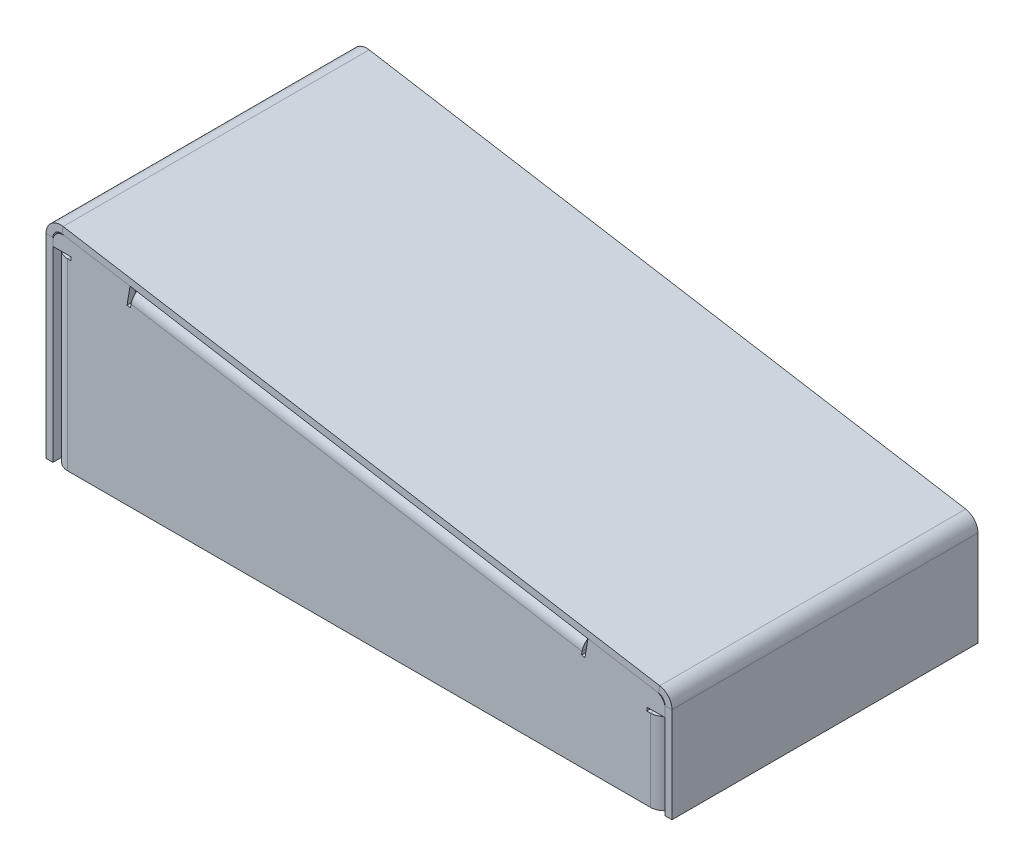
ISO-10303-21;
HEADER;
FILE_DESCRIPTION(('STEP AP214'),'2;1');
FILE_NAME('part.step','',(''),(''),'','','');
FILE_SCHEMA(('AUTOMOTIVE_DESIGN { 1 0 10303 214 1 1 1 1 }'));
ENDSEC;
DATA;
#1=APPLICATION_CONTEXT('core data for automotive mechanical design processes');
#2=APPLICATION_PROTOCOL_DEFINITION('international standard','automotive_design',2000,#1);
#3=PRODUCT_CONTEXT('',#1,'mechanical');
#4=PRODUCT('Part','Part','',(#3));
#5=PRODUCT_RELATED_PRODUCT_CATEGORY('part','',(#4));
#6=PRODUCT_DEFINITION_FORMATION('','',#4);
#7=PRODUCT_DEFINITION_CONTEXT('part definition',#1,'design');
#8=PRODUCT_DEFINITION('design','',#6,#7);
#9=PRODUCT_DEFINITION_SHAPE('','',#8);
#10=(LENGTH_UNIT() NAMED_UNIT(*) SI_UNIT(.MILLI.,.METRE.));
#11=(NAMED_UNIT(*) PLANE_ANGLE_UNIT() SI_UNIT($,.RADIAN.));
#12=(NAMED_UNIT(*) SI_UNIT($,.STERADIAN.) SOLID_ANGLE_UNIT());
#13=UNCERTAINTY_MEASURE_WITH_UNIT(LENGTH_MEASURE(1.E-05),#10,'distance_accuracy_value','');
#14=(GEOMETRIC_REPRESENTATION_CONTEXT(3) GLOBAL_UNCERTAINTY_ASSIGNED_CONTEXT((#13)) GLOBAL_UNIT_ASSIGNED_CONTEXT((#10,
#11,#12)) REPRESENTATION_CONTEXT('',''));
#15=CARTESIAN_POINT('',(0.,0.,0.));
#16=DIRECTION('',(0.,0.,1.));
#17=DIRECTION('',(1.,0.,0.));
#18=AXIS2_PLACEMENT_3D('',#15,#16,#17);
#19=CARTESIAN_POINT('',(303.4163,50.,150.));
#20=DIRECTION('',(0.,0.,-1.));
#21=DIRECTION('',(-1.,0.,0.));
#22=AXIS2_PLACEMENT_3D('',#19,#20,#21);
#23=PLANE('',#22);
#24=DIRECTION('',(1.,0.,0.));
#25=VECTOR('',#24,1.);
#26=CARTESIAN_POINT('',(300.000000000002,46.7724457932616,150.000000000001));
#27=LINE('',#26,#25);
#28=CARTESIAN_POINT('',(300.000000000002,46.7724457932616,150.000000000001));
#29=VERTEX_POINT('',#28);
#30=CARTESIAN_POINT('',(303.4163,46.7724457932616,150.));
#31=VERTEX_POINT('',#30);
#32=EDGE_CURVE('E170',#29,#31,#27,.T.);
#33=ORIENTED_EDGE('',*,*,#32,.F.);
#34=DIRECTION('',(0.,-1.,0.));
#35=VECTOR('',#34,1.);
#36=CARTESIAN_POINT('',(300.,50.,150.));
#37=LINE('',#36,#35);
#38=CARTESIAN_POINT('',(300.,0.,150.));
#39=VERTEX_POINT('',#38);
#40=EDGE_CURVE('E153',#29,#39,#37,.T.);
#41=ORIENTED_EDGE('',*,*,#40,.T.);
#42=DIRECTION('',(-1.,0.,0.));
#43=VECTOR('',#42,1.);
#44=CARTESIAN_POINT('',(303.4163,0.,150.));
#45=LINE('',#44,#43);
#46=CARTESIAN_POINT('',(303.4163,0.,150.));
#47=VERTEX_POINT('',#46);
#48=EDGE_CURVE('E14',#47,#39,#45,.T.);
#49=ORIENTED_EDGE('',*,*,#48,.F.);
#50=DIRECTION('',(0.,-1.,0.));
#51=VECTOR('',#50,1.);
#52=CARTESIAN_POINT('',(303.4163,50.,150.));
#53=LINE('',#52,#51);
#54=EDGE_CURVE('E165',#31,#47,#53,.T.);
#55=ORIENTED_EDGE('',*,*,#54,.F.);
#56=EDGE_LOOP('',(#33,#41,#49,#55));
#57=FACE_BOUND('',#56,.T.);
#58=ADVANCED_FACE('F109',(#57),#23,.F.);
#59=CARTESIAN_POINT('',(303.4163,50.,7.8035684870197E-13));
#60=DIRECTION('',(0.,0.,1.));
#61=DIRECTION('',(1.,0.,0.));
#62=AXIS2_PLACEMENT_3D('',#59,#60,#61);
#63=PLANE('',#62);
#64=DIRECTION('',(1.,0.,0.));
#65=VECTOR('',#64,1.);
#66=CARTESIAN_POINT('',(300.000000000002,46.7724457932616,8.04911692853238E-13));
#67=LINE('',#66,#65);
#68=CARTESIAN_POINT('',(300.000000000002,46.7724457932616,8.04911692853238E-13));
#69=VERTEX_POINT('',#68);
#70=CARTESIAN_POINT('',(303.416300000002,46.7724457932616,8.04911692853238E-13));
#71=VERTEX_POINT('',#70);
#72=EDGE_CURVE('E173',#69,#71,#67,.T.);
#73=ORIENTED_EDGE('',*,*,#72,.T.);
#74=DIRECTION('',(0.,1.,0.));
#75=VECTOR('',#74,1.);
#76=CARTESIAN_POINT('',(303.4163,50.,7.8035684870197E-13));
#77=LINE('',#76,#75);
#78=CARTESIAN_POINT('',(303.4163,0.,7.8035684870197E-13));
#79=VERTEX_POINT('',#78);
#80=EDGE_CURVE('E160',#79,#71,#77,.T.);
#81=ORIENTED_EDGE('',*,*,#80,.F.);
#82=DIRECTION('',(-1.,0.,0.));
#83=VECTOR('',#82,1.);
#84=CARTESIAN_POINT('',(303.4163,0.,7.8035684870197E-13));
#85=LINE('',#84,#83);
#86=CARTESIAN_POINT('',(300.,0.,7.71570461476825E-13));
#87=VERTEX_POINT('',#86);
#88=EDGE_CURVE('E116',#79,#87,#85,.T.);
#89=ORIENTED_EDGE('',*,*,#88,.T.);
#90=DIRECTION('',(0.,1.,0.));
#91=VECTOR('',#90,1.);
#92=CARTESIAN_POINT('',(300.,50.,7.71570461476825E-13));
#93=LINE('',#92,#91);
#94=EDGE_CURVE('E152',#87,#69,#93,.T.);
#95=ORIENTED_EDGE('',*,*,#94,.T.);
#96=EDGE_LOOP('',(#73,#81,#89,#95));
#97=FACE_BOUND('',#96,.T.);
#98=ADVANCED_FACE('F158',(#97),#63,.F.);
#99=CARTESIAN_POINT('',(303.4163,0.,7.85942504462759E-13));
#100=DIRECTION('',(1.,0.,0.));
#101=DIRECTION('',(0.,0.,-1.));
#102=AXIS2_PLACEMENT_3D('',#99,#100,#101);
#103=PLANE('',#102);
#104=ORIENTED_EDGE('',*,*,#80,.T.);
#105=DIRECTION('',(0.,0.,-1.));
#106=VECTOR('',#105,1.);
#107=CARTESIAN_POINT('',(303.416300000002,46.7724457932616,7.7715611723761E-13));
#108=LINE('',#107,#106);
#109=EDGE_CURVE('E187',#71,#31,#108,.F.);
#110=ORIENTED_EDGE('',*,*,#109,.T.);
#111=ORIENTED_EDGE('',*,*,#54,.T.);
#112=DIRECTION('',(0.,0.,-1.));
#113=VECTOR('',#112,1.);
#114=CARTESIAN_POINT('',(303.4163,0.,150.));
#115=LINE('',#114,#113);
#116=EDGE_CURVE('E132',#47,#79,#115,.T.);
#117=ORIENTED_EDGE('',*,*,#116,.T.);
#118=EDGE_LOOP('',(#104,#110,#111,#117));
#119=FACE_BOUND('',#118,.T.);
#120=ADVANCED_FACE('F382',(#119),#103,.T.);
#121=CARTESIAN_POINT('',(300.,0.,7.77156117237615E-13));
#122=DIRECTION('',(1.,0.,0.));
#123=DIRECTION('',(0.,0.,-1.));
#124=AXIS2_PLACEMENT_3D('',#121,#122,#123);
#125=PLANE('',#124);
#126=DIRECTION('',(0.,0.,-1.));
#127=VECTOR('',#126,1.);
#128=CARTESIAN_POINT('',(300.000000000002,46.7724457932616,7.7715611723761E-13));
#129=LINE('',#128,#127);
#130=EDGE_CURVE('E164',#69,#29,#129,.F.);
#131=ORIENTED_EDGE('',*,*,#130,.F.);
#132=ORIENTED_EDGE('',*,*,#94,.F.);
#133=DIRECTION('',(0.,0.,-1.));
#134=VECTOR('',#133,1.);
#135=CARTESIAN_POINT('',(300.,0.,150.));
#136=LINE('',#135,#134);
#137=EDGE_CURVE('E144',#39,#87,#136,.T.);
#138=ORIENTED_EDGE('',*,*,#137,.F.);
#139=ORIENTED_EDGE('',*,*,#40,.F.);
#140=EDGE_LOOP('',(#131,#132,#138,#139));
#141=FACE_BOUND('',#140,.T.);
#142=ADVANCED_FACE('F162',(#141),#125,.F.);
#143=CARTESIAN_POINT('',(303.4163,0.,150.));
#144=DIRECTION('',(0.,1.,0.));
#145=DIRECTION('',(0.,0.,1.));
#146=AXIS2_PLACEMENT_3D('',#143,#144,#145);
#147=PLANE('',#146);
#148=ORIENTED_EDGE('',*,*,#137,.T.);
#149=ORIENTED_EDGE('',*,*,#88,.F.);
#150=ORIENTED_EDGE('',*,*,#116,.F.);
#151=ORIENTED_EDGE('',*,*,#48,.T.);
#152=EDGE_LOOP('',(#148,#149,#150,#151));
#153=FACE_BOUND('',#152,.T.);
#154=ADVANCED_FACE('F146',(#153),#147,.F.);
#155=CARTESIAN_POINT('',(296.190000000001,46.7724457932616,150.000000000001));
#156=DIRECTION('',(0.,0.,1.));
#157=DIRECTION('',(1.,0.,0.));
#158=AXIS2_PLACEMENT_3D('',#155,#156,#157);
#159=PLANE('',#158);
#160=DIRECTION('',(0.16439898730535,0.986393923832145,0.));
#161=VECTOR('',#160,1.);
#162=CARTESIAN_POINT('',(296.816360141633,50.5306066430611,150.000000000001));
#163=LINE('',#162,#161);
#164=CARTESIAN_POINT('',(296.816360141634,50.5306066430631,150.000000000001));
#165=VERTEX_POINT('',#164);
#166=CARTESIAN_POINT('',(297.377996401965,53.9004242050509,150.000000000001));
#167=VERTEX_POINT('',#166);
#168=EDGE_CURVE('E258',#165,#167,#163,.T.);
#169=ORIENTED_EDGE('',*,*,#168,.F.);
#170=CARTESIAN_POINT('',(296.190000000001,46.7724457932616,150.000000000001));
#171=DIRECTION('',(0.,0.,-1.));
#172=DIRECTION('',(-1.,0.,0.));
#173=AXIS2_PLACEMENT_3D('',#170,#171,#172);
#174=CIRCLE('',#173,3.81000000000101);
#175=EDGE_CURVE('E181',#29,#165,#174,.F.);
#176=ORIENTED_EDGE('',*,*,#175,.F.);
#177=ORIENTED_EDGE('',*,*,#32,.T.);
#178=CARTESIAN_POINT('',(296.190000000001,46.7724457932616,150.000000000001));
#179=DIRECTION('',(0.,0.,-1.));
#180=DIRECTION('',(-1.,0.,0.));
#181=AXIS2_PLACEMENT_3D('',#178,#179,#180);
#182=CIRCLE('',#181,7.22630000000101);
#183=EDGE_CURVE('E123',#31,#167,#182,.F.);
#184=ORIENTED_EDGE('',*,*,#183,.T.);
#185=EDGE_LOOP('',(#169,#176,#177,#184));
#186=FACE_BOUND('',#185,.T.);
#187=ADVANCED_FACE('F284',(#186),#159,.T.);
#188=CARTESIAN_POINT('',(296.190000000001,46.7724457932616,8.04911692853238E-13));
#189=DIRECTION('',(0.,0.,1.));
#190=DIRECTION('',(1.,0.,0.));
#191=AXIS2_PLACEMENT_3D('',#188,#189,#190);
#192=PLANE('',#191);
#193=CARTESIAN_POINT('',(296.190000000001,46.7724457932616,8.04911692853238E-13));
#194=DIRECTION('',(0.,0.,-1.));
#195=DIRECTION('',(-1.,0.,0.));
#196=AXIS2_PLACEMENT_3D('',#193,#194,#195);
#197=CIRCLE('',#196,3.81000000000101);
#198=CARTESIAN_POINT('',(296.816360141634,50.5306066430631,8.04911692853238E-13));
#199=VERTEX_POINT('',#198);
#200=EDGE_CURVE('E176',#199,#69,#197,.T.);
#201=ORIENTED_EDGE('',*,*,#200,.F.);
#202=DIRECTION('',(0.16439898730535,0.986393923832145,0.));
#203=VECTOR('',#202,1.);
#204=CARTESIAN_POINT('',(296.816360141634,50.5306066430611,1.20891958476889E-12));
#205=LINE('',#204,#203);
#206=CARTESIAN_POINT('',(297.377996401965,53.9004242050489,8.06872635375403E-13));
#207=VERTEX_POINT('',#206);
#208=EDGE_CURVE('E268',#199,#207,#205,.T.);
#209=ORIENTED_EDGE('',*,*,#208,.T.);
#210=CARTESIAN_POINT('',(296.190000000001,46.7724457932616,8.04911692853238E-13));
#211=DIRECTION('',(0.,0.,-1.));
#212=DIRECTION('',(-1.,0.,0.));
#213=AXIS2_PLACEMENT_3D('',#210,#211,#212);
#214=CIRCLE('',#213,7.22630000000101);
#215=EDGE_CURVE('E184',#207,#71,#214,.T.);
#216=ORIENTED_EDGE('',*,*,#215,.T.);
#217=ORIENTED_EDGE('',*,*,#72,.F.);
#218=EDGE_LOOP('',(#201,#209,#216,#217));
#219=FACE_BOUND('',#218,.T.);
#220=ADVANCED_FACE('F386',(#219),#192,.F.);
#221=CARTESIAN_POINT('',(296.190000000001,46.7724457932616,7.7715611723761E-13));
#222=DIRECTION('',(0.,0.,-1.));
#223=DIRECTION('',(0.16439898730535,0.986393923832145,0.));
#224=AXIS2_PLACEMENT_3D('',#221,#222,#223);
#225=CYLINDRICAL_SURFACE('',#224,7.22630000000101);
#226=ORIENTED_EDGE('',*,*,#109,.F.);
#227=ORIENTED_EDGE('',*,*,#215,.F.);
#228=DIRECTION('',(0.,0.,1.));
#229=VECTOR('',#228,1.);
#230=CARTESIAN_POINT('',(297.377996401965,53.9004242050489,8.10464621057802E-13));
#231=LINE('',#230,#229);
#232=EDGE_CURVE('E271',#207,#167,#231,.T.);
#233=ORIENTED_EDGE('',*,*,#232,.T.);
#234=ORIENTED_EDGE('',*,*,#183,.F.);
#235=EDGE_LOOP('',(#226,#227,#233,#234));
#236=FACE_BOUND('',#235,.T.);
#237=ADVANCED_FACE('F275',(#236),#225,.T.);
#238=CARTESIAN_POINT('',(296.190000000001,46.7724457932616,7.7715611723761E-13));
#239=DIRECTION('',(0.,0.,-1.));
#240=DIRECTION('',(0.16439898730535,0.986393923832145,0.));
#241=AXIS2_PLACEMENT_3D('',#238,#239,#240);
#242=CYLINDRICAL_SURFACE('',#241,3.81000000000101);
#243=ORIENTED_EDGE('',*,*,#130,.T.);
#244=ORIENTED_EDGE('',*,*,#175,.T.);
#245=DIRECTION('',(0.,0.,1.));
#246=VECTOR('',#245,1.);
#247=CARTESIAN_POINT('',(296.816360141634,50.5306066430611,1.20891958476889E-12));
#248=LINE('',#247,#246);
#249=EDGE_CURVE('E265',#199,#165,#248,.T.);
#250=ORIENTED_EDGE('',*,*,#249,.F.);
#251=ORIENTED_EDGE('',*,*,#200,.T.);
#252=EDGE_LOOP('',(#243,#244,#250,#251));
#253=FACE_BOUND('',#252,.T.);
#254=ADVANCED_FACE('F387',(#253),#242,.F.);
#255=CARTESIAN_POINT('',(-3.4163,100.,0.));
#256=DIRECTION('',(0.,0.,1.));
#257=DIRECTION('',(1.,0.,0.));
#258=AXIS2_PLACEMENT_3D('',#255,#256,#257);
#259=PLANE('',#258);
#260=DIRECTION('',(-1.,0.,0.));
#261=VECTOR('',#260,1.);
#262=CARTESIAN_POINT('',(0.,95.5024457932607,0.));
#263=LINE('',#262,#261);
#264=CARTESIAN_POINT('',(0.,95.5024457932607,0.));
#265=VERTEX_POINT('',#264);
#266=CARTESIAN_POINT('',(-3.4163,95.5024457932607,0.));
#267=VERTEX_POINT('',#266);
#268=EDGE_CURVE('E207',#265,#267,#263,.T.);
#269=ORIENTED_EDGE('',*,*,#268,.F.);
#270=DIRECTION('',(0.,-1.,0.));
#271=VECTOR('',#270,1.);
#272=CARTESIAN_POINT('',(0.,100.,0.));
#273=LINE('',#272,#271);
#274=CARTESIAN_POINT('',(0.,0.,0.));
#275=VERTEX_POINT('',#274);
#276=EDGE_CURVE('E204',#265,#275,#273,.T.);
#277=ORIENTED_EDGE('',*,*,#276,.T.);
#278=DIRECTION('',(1.,0.,0.));
#279=VECTOR('',#278,1.);
#280=CARTESIAN_POINT('',(-3.4163,0.,0.));
#281=LINE('',#280,#279);
#282=CARTESIAN_POINT('',(-3.4163,0.,0.));
#283=VERTEX_POINT('',#282);
#284=EDGE_CURVE('E179',#283,#275,#281,.T.);
#285=ORIENTED_EDGE('',*,*,#284,.F.);
#286=DIRECTION('',(0.,-1.,0.));
#287=VECTOR('',#286,1.);
#288=CARTESIAN_POINT('',(-3.4163,100.,0.));
#289=LINE('',#288,#287);
#290=EDGE_CURVE('E200',#267,#283,#289,.T.);
#291=ORIENTED_EDGE('',*,*,#290,.F.);
#292=EDGE_LOOP('',(#269,#277,#285,#291));
#293=FACE_BOUND('',#292,.T.);
#294=ADVANCED_FACE('F389',(#293),#259,.F.);
#295=CARTESIAN_POINT('',(-3.41630000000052,100.,150.));
#296=DIRECTION('',(0.,0.,-1.));
#297=DIRECTION('',(-1.,0.,0.));
#298=AXIS2_PLACEMENT_3D('',#295,#296,#297);
#299=PLANE('',#298);
#300=DIRECTION('',(-1.,0.,0.));
#301=VECTOR('',#300,1.);
#302=CARTESIAN_POINT('',(-5.08273978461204E-13,95.5024457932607,150.));
#303=LINE('',#302,#301);
#304=CARTESIAN_POINT('',(-5.08273978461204E-13,95.5024457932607,150.));
#305=VERTEX_POINT('',#304);
#306=CARTESIAN_POINT('',(-3.41630000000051,95.5024457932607,150.));
#307=VERTEX_POINT('',#306);
#308=EDGE_CURVE('E215',#305,#307,#303,.T.);
#309=ORIENTED_EDGE('',*,*,#308,.T.);
#310=DIRECTION('',(0.,1.,0.));
#311=VECTOR('',#310,1.);
#312=CARTESIAN_POINT('',(-3.41630000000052,100.,150.));
#313=LINE('',#312,#311);
#314=CARTESIAN_POINT('',(-3.41630000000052,0.,150.));
#315=VERTEX_POINT('',#314);
#316=EDGE_CURVE('E196',#315,#307,#313,.T.);
#317=ORIENTED_EDGE('',*,*,#316,.F.);
#318=DIRECTION('',(1.,0.,0.));
#319=VECTOR('',#318,1.);
#320=CARTESIAN_POINT('',(-3.41630000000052,0.,150.));
#321=LINE('',#320,#319);
#322=CARTESIAN_POINT('',(-5.2372220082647E-13,0.,150.));
#323=VERTEX_POINT('',#322);
#324=EDGE_CURVE('E193',#315,#323,#321,.T.);
#325=ORIENTED_EDGE('',*,*,#324,.T.);
#326=DIRECTION('',(0.,1.,0.));
#327=VECTOR('',#326,1.);
#328=CARTESIAN_POINT('',(-5.2372220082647E-13,100.,150.));
#329=LINE('',#328,#327);
#330=EDGE_CURVE('E197',#323,#305,#329,.T.);
#331=ORIENTED_EDGE('',*,*,#330,.T.);
#332=EDGE_LOOP('',(#309,#317,#325,#331));
#333=FACE_BOUND('',#332,.T.);
#334=ADVANCED_FACE('F353',(#333),#299,.F.);
#335=CARTESIAN_POINT('',(-3.4163,0.,0.));
#336=DIRECTION('',(-1.,0.,0.));
#337=DIRECTION('',(0.,0.,1.));
#338=AXIS2_PLACEMENT_3D('',#335,#336,#337);
#339=PLANE('',#338);
#340=ORIENTED_EDGE('',*,*,#316,.T.);
#341=DIRECTION('',(0.,0.,1.));
#342=VECTOR('',#341,1.);
#343=CARTESIAN_POINT('',(-3.41630000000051,95.5024457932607,150.));
#344=LINE('',#343,#342);
#345=EDGE_CURVE('E234',#307,#267,#344,.F.);
#346=ORIENTED_EDGE('',*,*,#345,.T.);
#347=ORIENTED_EDGE('',*,*,#290,.T.);
#348=DIRECTION('',(0.,0.,1.));
#349=VECTOR('',#348,1.);
#350=CARTESIAN_POINT('',(-3.4163,0.,0.));
#351=LINE('',#350,#349);
#352=EDGE_CURVE('E210',#283,#315,#351,.T.);
#353=ORIENTED_EDGE('',*,*,#352,.T.);
#354=EDGE_LOOP('',(#340,#346,#347,#353));
#355=FACE_BOUND('',#354,.T.);
#356=ADVANCED_FACE('F355',(#355),#339,.T.);
#357=CARTESIAN_POINT('',(0.,0.,0.));
#358=DIRECTION('',(-1.,0.,0.));
#359=DIRECTION('',(0.,0.,1.));
#360=AXIS2_PLACEMENT_3D('',#357,#358,#359);
#361=PLANE('',#360);
#362=DIRECTION('',(0.,0.,1.));
#363=VECTOR('',#362,1.);
#364=CARTESIAN_POINT('',(-5.08273978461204E-13,95.5024457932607,150.));
#365=LINE('',#364,#363);
#366=EDGE_CURVE('E224',#305,#265,#365,.F.);
#367=ORIENTED_EDGE('',*,*,#366,.F.);
#368=ORIENTED_EDGE('',*,*,#330,.F.);
#369=DIRECTION('',(0.,0.,1.));
#370=VECTOR('',#369,1.);
#371=CARTESIAN_POINT('',(0.,0.,0.));
#372=LINE('',#371,#370);
#373=EDGE_CURVE('E201',#275,#323,#372,.T.);
#374=ORIENTED_EDGE('',*,*,#373,.F.);
#375=ORIENTED_EDGE('',*,*,#276,.F.);
#376=EDGE_LOOP('',(#367,#368,#374,#375));
#377=FACE_BOUND('',#376,.T.);
#378=ADVANCED_FACE('F364',(#377),#361,.F.);
#379=CARTESIAN_POINT('',(-3.4163,0.,0.));
#380=DIRECTION('',(0.,1.,0.));
#381=DIRECTION('',(0.,0.,1.));
#382=AXIS2_PLACEMENT_3D('',#379,#380,#381);
#383=PLANE('',#382);
#384=ORIENTED_EDGE('',*,*,#373,.T.);
#385=ORIENTED_EDGE('',*,*,#324,.F.);
#386=ORIENTED_EDGE('',*,*,#352,.F.);
#387=ORIENTED_EDGE('',*,*,#284,.T.);
#388=EDGE_LOOP('',(#384,#385,#386,#387));
#389=FACE_BOUND('',#388,.T.);
#390=ADVANCED_FACE('F360',(#389),#383,.F.);
#391=CARTESIAN_POINT('',(3.81,95.5024457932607,0.));
#392=DIRECTION('',(0.,0.,-1.));
#393=DIRECTION('',(-1.,0.,0.));
#394=AXIS2_PLACEMENT_3D('',#391,#392,#393);
#395=PLANE('',#394);
#396=DIRECTION('',(0.16439898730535,0.986393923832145,0.));
#397=VECTOR('',#396,1.);
#398=CARTESIAN_POINT('',(4.43636014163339,99.2606066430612,4.15620008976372E-13));
#399=LINE('',#398,#397);
#400=CARTESIAN_POINT('',(4.43636014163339,99.2606066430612,0.));
#401=VERTEX_POINT('',#400);
#402=CARTESIAN_POINT('',(4.99799640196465,102.630424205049,0.));
#403=VERTEX_POINT('',#402);
#404=EDGE_CURVE('E254',#401,#403,#399,.T.);
#405=ORIENTED_EDGE('',*,*,#404,.F.);
#406=CARTESIAN_POINT('',(3.81,95.5024457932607,0.));
#407=DIRECTION('',(0.,0.,1.));
#408=DIRECTION('',(1.,0.,0.));
#409=AXIS2_PLACEMENT_3D('',#406,#407,#408);
#410=CIRCLE('',#409,3.80999999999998);
#411=EDGE_CURVE('E228',#265,#401,#410,.F.);
#412=ORIENTED_EDGE('',*,*,#411,.F.);
#413=ORIENTED_EDGE('',*,*,#268,.T.);
#414=CARTESIAN_POINT('',(3.81,95.5024457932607,0.));
#415=DIRECTION('',(0.,0.,1.));
#416=DIRECTION('',(1.,0.,0.));
#417=AXIS2_PLACEMENT_3D('',#414,#415,#416);
#418=CIRCLE('',#417,7.22629999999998);
#419=EDGE_CURVE('E218',#267,#403,#418,.F.);
#420=ORIENTED_EDGE('',*,*,#419,.T.);
#421=EDGE_LOOP('',(#405,#412,#413,#420));
#422=FACE_BOUND('',#421,.T.);
#423=ADVANCED_FACE('F309',(#422),#395,.T.);
#424=CARTESIAN_POINT('',(3.80999999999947,95.5024457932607,150.));
#425=DIRECTION('',(0.,0.,-1.));
#426=DIRECTION('',(-1.,0.,0.));
#427=AXIS2_PLACEMENT_3D('',#424,#425,#426);
#428=PLANE('',#427);
#429=CARTESIAN_POINT('',(3.80999999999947,95.5024457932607,150.));
#430=DIRECTION('',(0.,0.,1.));
#431=DIRECTION('',(1.,0.,0.));
#432=AXIS2_PLACEMENT_3D('',#429,#430,#431);
#433=CIRCLE('',#432,3.80999999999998);
#434=CARTESIAN_POINT('',(4.43636014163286,99.2606066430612,150.));
#435=VERTEX_POINT('',#434);
#436=EDGE_CURVE('E221',#435,#305,#433,.T.);
#437=ORIENTED_EDGE('',*,*,#436,.F.);
#438=DIRECTION('',(0.16439898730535,0.986393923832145,0.));
#439=VECTOR('',#438,1.);
#440=CARTESIAN_POINT('',(4.43636014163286,99.2606066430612,150.));
#441=LINE('',#440,#439);
#442=CARTESIAN_POINT('',(4.99799640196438,102.630424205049,150.));
#443=VERTEX_POINT('',#442);
#444=EDGE_CURVE('E253',#435,#443,#441,.T.);
#445=ORIENTED_EDGE('',*,*,#444,.T.);
#446=CARTESIAN_POINT('',(3.80999999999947,95.5024457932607,150.));
#447=DIRECTION('',(0.,0.,1.));
#448=DIRECTION('',(1.,0.,0.));
#449=AXIS2_PLACEMENT_3D('',#446,#447,#448);
#450=CIRCLE('',#449,7.22629999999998);
#451=EDGE_CURVE('E231',#443,#307,#450,.T.);
#452=ORIENTED_EDGE('',*,*,#451,.T.);
#453=ORIENTED_EDGE('',*,*,#308,.F.);
#454=EDGE_LOOP('',(#437,#445,#452,#453));
#455=FACE_BOUND('',#454,.T.);
#456=ADVANCED_FACE('F350',(#455),#428,.F.);
#457=CARTESIAN_POINT('',(3.80999999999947,95.5024457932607,150.));
#458=DIRECTION('',(0.,0.,1.));
#459=DIRECTION('',(0.16439898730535,0.986393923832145,0.));
#460=AXIS2_PLACEMENT_3D('',#457,#458,#459);
#461=CYLINDRICAL_SURFACE('',#460,7.22629999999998);
#462=ORIENTED_EDGE('',*,*,#345,.F.);
#463=ORIENTED_EDGE('',*,*,#451,.F.);
#464=DIRECTION('',(0.,0.,1.));
#465=VECTOR('',#464,1.);
#466=CARTESIAN_POINT('',(4.99799640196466,102.630424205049,0.));
#467=LINE('',#466,#465);
#468=EDGE_CURVE('E246',#403,#443,#467,.T.);
#469=ORIENTED_EDGE('',*,*,#468,.F.);
#470=ORIENTED_EDGE('',*,*,#419,.F.);
#471=EDGE_LOOP('',(#462,#463,#469,#470));
#472=FACE_BOUND('',#471,.T.);
#473=ADVANCED_FACE('F302',(#472),#461,.T.);
#474=CARTESIAN_POINT('',(3.80999999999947,95.5024457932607,150.));
#475=DIRECTION('',(0.,0.,1.));
#476=DIRECTION('',(0.16439898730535,0.986393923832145,0.));
#477=AXIS2_PLACEMENT_3D('',#474,#475,#476);
#478=CYLINDRICAL_SURFACE('',#477,3.80999999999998);
#479=ORIENTED_EDGE('',*,*,#366,.T.);
#480=ORIENTED_EDGE('',*,*,#411,.T.);
#481=DIRECTION('',(0.,0.,1.));
#482=VECTOR('',#481,1.);
#483=CARTESIAN_POINT('',(4.43636014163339,99.2606066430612,4.15620008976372E-13));
#484=LINE('',#483,#482);
#485=EDGE_CURVE('E257',#401,#435,#484,.T.);
#486=ORIENTED_EDGE('',*,*,#485,.T.);
#487=ORIENTED_EDGE('',*,*,#436,.T.);
#488=EDGE_LOOP('',(#479,#480,#486,#487));
#489=FACE_BOUND('',#488,.T.);
#490=ADVANCED_FACE('F367',(#489),#478,.F.);
#491=CARTESIAN_POINT('',(0.561636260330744,103.369817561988,150.));
#492=DIRECTION('',(0.,0.,1.));
#493=DIRECTION('',(0.,-1.,0.));
#494=AXIS2_PLACEMENT_3D('',#491,#492,#493);
#495=PLANE('',#494);
#496=ORIENTED_EDGE('',*,*,#168,.T.);
#497=DIRECTION('',(-0.986393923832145,0.16439898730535,0.));
#498=VECTOR('',#497,1.);
#499=CARTESIAN_POINT('',(0.561636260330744,103.369817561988,150.));
#500=LINE('',#499,#498);
#501=EDGE_CURVE('E225',#167,#443,#500,.T.);
#502=ORIENTED_EDGE('',*,*,#501,.T.);
#503=ORIENTED_EDGE('',*,*,#444,.F.);
#504=DIRECTION('',(-0.986393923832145,0.16439898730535,0.));
#505=VECTOR('',#504,1.);
#506=CARTESIAN_POINT('',(-5.2372220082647E-13,100.,150.));
#507=LINE('',#506,#505);
#508=EDGE_CURVE('E239',#165,#435,#507,.T.);
#509=ORIENTED_EDGE('',*,*,#508,.F.);
#510=EDGE_LOOP('',(#496,#502,#503,#509));
#511=FACE_BOUND('',#510,.T.);
#512=ADVANCED_FACE('F290',(#511),#495,.T.);
#513=CARTESIAN_POINT('',(318.133377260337,50.4411940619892,8.3320099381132E-13));
#514=DIRECTION('',(0.,0.,-1.));
#515=DIRECTION('',(-1.,0.,0.));
#516=AXIS2_PLACEMENT_3D('',#513,#514,#515);
#517=PLANE('',#516);
#518=ORIENTED_EDGE('',*,*,#208,.F.);
#519=DIRECTION('',(0.986393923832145,-0.16439898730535,0.));
#520=VECTOR('',#519,1.);
#521=CARTESIAN_POINT('',(317.571741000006,47.0713765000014,8.31240051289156E-13));
#522=LINE('',#521,#520);
#523=EDGE_CURVE('E243',#401,#199,#522,.T.);
#524=ORIENTED_EDGE('',*,*,#523,.F.);
#525=ORIENTED_EDGE('',*,*,#404,.T.);
#526=DIRECTION('',(0.986393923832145,-0.16439898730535,0.));
#527=VECTOR('',#526,1.);
#528=CARTESIAN_POINT('',(318.133377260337,50.4411940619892,8.3320099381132E-13));
#529=LINE('',#528,#527);
#530=EDGE_CURVE('E242',#403,#207,#529,.T.);
#531=ORIENTED_EDGE('',*,*,#530,.T.);
#532=EDGE_LOOP('',(#518,#524,#525,#531));
#533=FACE_BOUND('',#532,.T.);
#534=ADVANCED_FACE('F315',(#533),#517,.T.);
#535=CARTESIAN_POINT('',(16.7778524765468,100.667114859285,0.));
#536=DIRECTION('',(0.16439898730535,0.986393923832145,0.));
#537=DIRECTION('',(-0.986393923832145,0.16439898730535,0.));
#538=AXIS2_PLACEMENT_3D('',#535,#536,#537);
#539=PLANE('',#538);
#540=ORIENTED_EDGE('',*,*,#232,.F.);
#541=ORIENTED_EDGE('',*,*,#530,.F.);
#542=ORIENTED_EDGE('',*,*,#468,.T.);
#543=ORIENTED_EDGE('',*,*,#501,.F.);
#544=EDGE_LOOP('',(#540,#541,#542,#543));
#545=FACE_BOUND('',#544,.T.);
#546=ADVANCED_FACE('F293',(#545),#539,.T.);
#547=CARTESIAN_POINT('',(16.2162162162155,97.2972972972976,0.));
#548=DIRECTION('',(0.16439898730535,0.986393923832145,0.));
#549=DIRECTION('',(-0.986393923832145,0.16439898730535,0.));
#550=AXIS2_PLACEMENT_3D('',#547,#548,#549);
#551=PLANE('',#550);
#552=ORIENTED_EDGE('',*,*,#523,.T.);
#553=ORIENTED_EDGE('',*,*,#249,.T.);
#554=ORIENTED_EDGE('',*,*,#508,.T.);
#555=ORIENTED_EDGE('',*,*,#485,.F.);
#556=EDGE_LOOP('',(#552,#553,#554,#555));
#557=FACE_BOUND('',#556,.T.);
#558=ADVANCED_FACE('F321',(#557),#551,.F.);
#559=CLOSED_SHELL('',(#58,#98,#120,#142,#154,#187,#220,#237,#254,#294,#334,#356,#378,#390,#423,
#456,#473,#490,#512,#534,#546,#558));
#560=MANIFOLD_SOLID_BREP('B2',#559);
#561=CARTESIAN_POINT('',(0.,0.,146.5837));
#562=DIRECTION('',(0.,0.,1.));
#563=DIRECTION('',(-1.,0.,0.));
#564=AXIS2_PLACEMENT_3D('',#561,#562,#563);
#565=PLANE('',#564);
#566=DIRECTION('',(-0.986393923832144,0.164398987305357,0.));
#567=VECTOR('',#566,1.);
#568=CARTESIAN_POINT('',(0.,100.,146.5837));
#569=LINE('',#568,#567);
#570=CARTESIAN_POINT('',(295.821994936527,50.6963341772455,146.5837));
#571=VERTEX_POINT('',#570);
#572=CARTESIAN_POINT('',(262.229151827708,56.2951413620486,146.5837));
#573=VERTEX_POINT('',#572);
#574=EDGE_CURVE('E1143',#571,#573,#569,.T.);
#575=ORIENTED_EDGE('',*,*,#574,.F.);
#576=CARTESIAN_POINT('',(295.,45.7643645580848,146.5837));
#577=DIRECTION('',(0.,0.,1.));
#578=DIRECTION('',(1.,0.,0.));
#579=AXIS2_PLACEMENT_3D('',#576,#577,#578);
#580=CIRCLE('',#579,5.);
#581=CARTESIAN_POINT('',(300.,45.7643645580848,146.5837));
#582=VERTEX_POINT('',#581);
#583=EDGE_CURVE('E1191',#571,#582,#580,.F.);
#584=ORIENTED_EDGE('',*,*,#583,.T.);
#585=DIRECTION('',(0.,1.,0.));
#586=VECTOR('',#585,1.);
#587=CARTESIAN_POINT('',(300.,0.,146.5837));
#588=LINE('',#587,#586);
#589=CARTESIAN_POINT('',(300.,41.70815,146.5837));
#590=VERTEX_POINT('',#589);
#591=EDGE_CURVE('E1139',#590,#582,#588,.T.);
#592=ORIENTED_EDGE('',*,*,#591,.F.);
#593=DIRECTION('',(-1.,0.,0.));
#594=VECTOR('',#593,1.);
#595=CARTESIAN_POINT('',(300.,41.70815,146.5837));
#596=LINE('',#595,#594);
#597=CARTESIAN_POINT('',(291.06555,41.70815,146.5837));
#598=VERTEX_POINT('',#597);
#599=EDGE_CURVE('E1062',#590,#598,#596,.T.);
#600=ORIENTED_EDGE('',*,*,#599,.T.);
#601=DIRECTION('',(0.,-1.,0.));
#602=VECTOR('',#601,1.);
#603=CARTESIAN_POINT('',(291.06555,41.70815,146.5837));
#604=LINE('',#603,#602);
#605=CARTESIAN_POINT('',(291.06555,40.,146.5837));
#606=VERTEX_POINT('',#605);
#607=EDGE_CURVE('E1067',#598,#606,#604,.T.);
#608=ORIENTED_EDGE('',*,*,#607,.T.);
#609=DIRECTION('',(1.,0.,0.));
#610=VECTOR('',#609,1.);
#611=CARTESIAN_POINT('',(291.06555,40.,146.5837));
#612=LINE('',#611,#610);
#613=CARTESIAN_POINT('',(292.7737,40.,146.5837));
#614=VERTEX_POINT('',#613);
#615=EDGE_CURVE('E1071',#606,#614,#612,.T.);
#616=ORIENTED_EDGE('',*,*,#615,.T.);
#617=DIRECTION('',(0.,1.,0.));
#618=VECTOR('',#617,1.);
#619=CARTESIAN_POINT('',(292.7737,40.,146.5837));
#620=LINE('',#619,#618);
#621=CARTESIAN_POINT('',(292.7737,0.,146.5837));
#622=VERTEX_POINT('',#621);
#623=EDGE_CURVE('E944',#614,#622,#620,.F.);
#624=ORIENTED_EDGE('',*,*,#623,.T.);
#625=DIRECTION('',(1.,0.,0.));
#626=VECTOR('',#625,1.);
#627=CARTESIAN_POINT('',(0.,0.,146.5837));
#628=LINE('',#627,#626);
#629=CARTESIAN_POINT('',(7.22629999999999,0.,146.5837));
#630=VERTEX_POINT('',#629);
#631=EDGE_CURVE('E1135',#630,#622,#628,.T.);
#632=ORIENTED_EDGE('',*,*,#631,.F.);
#633=DIRECTION('',(0.,-1.,0.));
#634=VECTOR('',#633,1.);
#635=CARTESIAN_POINT('',(7.22629999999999,0.,146.5837));
#636=LINE('',#635,#634);
#637=CARTESIAN_POINT('',(7.22629999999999,90.,146.5837));
#638=VERTEX_POINT('',#637);
#639=EDGE_CURVE('E1052',#630,#638,#636,.F.);
#640=ORIENTED_EDGE('',*,*,#639,.T.);
#641=DIRECTION('',(1.,0.,0.));
#642=VECTOR('',#641,1.);
#643=CARTESIAN_POINT('',(7.22629999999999,90.,146.5837));
#644=LINE('',#643,#642);
#645=CARTESIAN_POINT('',(8.93444999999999,90.,146.5837));
#646=VERTEX_POINT('',#645);
#647=EDGE_CURVE('E1117',#638,#646,#644,.T.);
#648=ORIENTED_EDGE('',*,*,#647,.T.);
#649=DIRECTION('',(0.,1.,0.));
#650=VECTOR('',#649,1.);
#651=CARTESIAN_POINT('',(8.93444999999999,90.,146.5837));
#652=LINE('',#651,#650);
#653=CARTESIAN_POINT('',(8.93444999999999,91.70815,146.5837));
#654=VERTEX_POINT('',#653);
#655=EDGE_CURVE('E1121',#646,#654,#652,.T.);
#656=ORIENTED_EDGE('',*,*,#655,.T.);
#657=DIRECTION('',(-1.,0.,0.));
#658=VECTOR('',#657,1.);
#659=CARTESIAN_POINT('',(8.93444999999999,91.70815,146.5837));
#660=LINE('',#659,#658);
#661=CARTESIAN_POINT('',(0.,91.70815,146.5837));
#662=VERTEX_POINT('',#661);
#663=EDGE_CURVE('E1125',#654,#662,#660,.T.);
#664=ORIENTED_EDGE('',*,*,#663,.T.);
#665=DIRECTION('',(0.,-1.,0.));
#666=VECTOR('',#665,1.);
#667=CARTESIAN_POINT('',(0.,0.,146.5837));
#668=LINE('',#667,#666);
#669=CARTESIAN_POINT('',(0.,94.0976978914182,146.5837));
#670=VERTEX_POINT('',#669);
#671=EDGE_CURVE('E1133',#670,#662,#668,.T.);
#672=ORIENTED_EDGE('',*,*,#671,.F.);
#673=CARTESIAN_POINT('',(5.,94.0976978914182,146.5837));
#674=DIRECTION('',(0.,0.,1.));
#675=DIRECTION('',(1.,0.,0.));
#676=AXIS2_PLACEMENT_3D('',#673,#674,#675);
#677=CIRCLE('',#676,5.);
#678=CARTESIAN_POINT('',(5.82199493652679,99.0296675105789,146.5837));
#679=VERTEX_POINT('',#678);
#680=EDGE_CURVE('E683',#670,#679,#677,.F.);
#681=ORIENTED_EDGE('',*,*,#680,.T.);
#682=CARTESIAN_POINT('',(37.7708481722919,93.7048586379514,146.5837));
#683=VERTEX_POINT('',#682);
#684=EDGE_CURVE('E1142',#683,#679,#569,.T.);
#685=ORIENTED_EDGE('',*,*,#684,.F.);
#686=DIRECTION('',(-0.164398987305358,-0.986393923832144,0.));
#687=VECTOR('',#686,1.);
#688=CARTESIAN_POINT('',(37.7708481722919,93.7048586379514,146.5837));
#689=LINE('',#688,#687);
#690=CARTESIAN_POINT('',(36.3020336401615,84.8919714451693,146.5837));
#691=VERTEX_POINT('',#690);
#692=EDGE_CURVE('E1080',#683,#691,#689,.T.);
#693=ORIENTED_EDGE('',*,*,#692,.T.);
#694=DIRECTION('',(0.986393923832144,-0.164398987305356,0.));
#695=VECTOR('',#694,1.);
#696=CARTESIAN_POINT('',(36.3020336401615,84.8919714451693,146.5837));
#697=LINE('',#696,#695);
#698=CARTESIAN_POINT('',(37.9869424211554,84.6111533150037,146.5837));
#699=VERTEX_POINT('',#698);
#700=EDGE_CURVE('E1085',#691,#699,#697,.T.);
#701=ORIENTED_EDGE('',*,*,#700,.T.);
#702=DIRECTION('',(0.164398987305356,0.986393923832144,0.));
#703=VECTOR('',#702,1.);
#704=CARTESIAN_POINT('',(37.9869424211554,84.6111533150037,146.5837));
#705=LINE('',#704,#703);
#706=CARTESIAN_POINT('',(38.267760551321,86.2960620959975,146.5837));
#707=VERTEX_POINT('',#706);
#708=EDGE_CURVE('E1089',#699,#707,#705,.T.);
#709=ORIENTED_EDGE('',*,*,#708,.T.);
#710=DIRECTION('',(-0.986393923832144,0.164398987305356,0.));
#711=VECTOR('',#710,1.);
#712=CARTESIAN_POINT('',(38.267760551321,86.2960620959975,146.5837));
#713=LINE('',#712,#711);
#714=CARTESIAN_POINT('',(259.35624664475,49.4479810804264,146.5837));
#715=VERTEX_POINT('',#714);
#716=EDGE_CURVE('E998',#707,#715,#713,.F.);
#717=ORIENTED_EDGE('',*,*,#716,.T.);
#718=DIRECTION('',(-0.164398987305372,-0.986393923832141,0.));
#719=VECTOR('',#718,1.);
#720=CARTESIAN_POINT('',(259.35624664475,49.4479810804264,146.5837));
#721=LINE('',#720,#719);
#722=CARTESIAN_POINT('',(259.075428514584,47.7630722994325,146.5837));
#723=VERTEX_POINT('',#722);
#724=EDGE_CURVE('E1093',#715,#723,#721,.T.);
#725=ORIENTED_EDGE('',*,*,#724,.T.);
#726=DIRECTION('',(0.986393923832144,-0.164398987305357,0.));
#727=VECTOR('',#726,1.);
#728=CARTESIAN_POINT('',(259.075428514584,47.7630722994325,146.5837));
#729=LINE('',#728,#727);
#730=CARTESIAN_POINT('',(260.760337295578,47.4822541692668,146.5837));
#731=VERTEX_POINT('',#730);
#732=EDGE_CURVE('E1096',#723,#731,#729,.T.);
#733=ORIENTED_EDGE('',*,*,#732,.T.);
#734=DIRECTION('',(0.164398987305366,0.986393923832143,0.));
#735=VECTOR('',#734,1.);
#736=CARTESIAN_POINT('',(260.760337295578,47.4822541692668,146.5837));
#737=LINE('',#736,#735);
#738=EDGE_CURVE('E1100',#731,#573,#737,.T.);
#739=ORIENTED_EDGE('',*,*,#738,.T.);
#740=EDGE_LOOP('',(#575,#584,#592,#600,#608,#616,#624,#632,#640,#648,#656,#664,#672,#681,#685,
#693,#701,#709,#717,#725,#733,#739));
#741=FACE_BOUND('',#740,.T.);
#742=ADVANCED_FACE('F668',(#741),#565,.F.);
#743=CARTESIAN_POINT('',(0.,0.,150.));
#744=DIRECTION('',(0.,0.,1.));
#745=DIRECTION('',(-1.,0.,0.));
#746=AXIS2_PLACEMENT_3D('',#743,#744,#745);
#747=PLANE('',#746);
#748=DIRECTION('',(0.,1.,0.));
#749=VECTOR('',#748,1.);
#750=CARTESIAN_POINT('',(300.,0.,150.));
#751=LINE('',#750,#749);
#752=CARTESIAN_POINT('',(300.,41.70815,150.));
#753=VERTEX_POINT('',#752);
#754=CARTESIAN_POINT('',(300.,45.7643645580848,150.));
#755=VERTEX_POINT('',#754);
#756=EDGE_CURVE('E1150',#753,#755,#751,.T.);
#757=ORIENTED_EDGE('',*,*,#756,.T.);
#758=CARTESIAN_POINT('',(295.,45.7643645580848,150.));
#759=DIRECTION('',(0.,0.,1.));
#760=DIRECTION('',(1.,0.,0.));
#761=AXIS2_PLACEMENT_3D('',#758,#759,#760);
#762=CIRCLE('',#761,5.);
#763=CARTESIAN_POINT('',(295.821994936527,50.6963341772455,150.));
#764=VERTEX_POINT('',#763);
#765=EDGE_CURVE('E1186',#755,#764,#762,.T.);
#766=ORIENTED_EDGE('',*,*,#765,.T.);
#767=DIRECTION('',(-0.986393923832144,0.164398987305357,0.));
#768=VECTOR('',#767,1.);
#769=CARTESIAN_POINT('',(0.,100.,150.));
#770=LINE('',#769,#768);
#771=CARTESIAN_POINT('',(262.229151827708,56.2951413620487,150.));
#772=VERTEX_POINT('',#771);
#773=EDGE_CURVE('E1136',#764,#772,#770,.T.);
#774=ORIENTED_EDGE('',*,*,#773,.T.);
#775=DIRECTION('',(0.164398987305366,0.986393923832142,0.));
#776=VECTOR('',#775,1.);
#777=CARTESIAN_POINT('',(246.012935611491,-41.0021559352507,150.));
#778=LINE('',#777,#776);
#779=CARTESIAN_POINT('',(260.760337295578,47.4822541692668,150.));
#780=VERTEX_POINT('',#779);
#781=EDGE_CURVE('E1083',#780,#772,#778,.T.);
#782=ORIENTED_EDGE('',*,*,#781,.F.);
#783=DIRECTION('',(0.986393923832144,-0.164398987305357,0.));
#784=VECTOR('',#783,1.);
#785=CARTESIAN_POINT('',(14.7474016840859,88.4844101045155,150.));
#786=LINE('',#785,#784);
#787=CARTESIAN_POINT('',(259.075428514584,47.7630722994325,150.));
#788=VERTEX_POINT('',#787);
#789=EDGE_CURVE('E1163',#788,#780,#786,.T.);
#790=ORIENTED_EDGE('',*,*,#789,.F.);
#791=DIRECTION('',(-0.164398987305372,-0.986393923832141,0.));
#792=VECTOR('',#791,1.);
#793=CARTESIAN_POINT('',(244.328026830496,-40.7213378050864,150.));
#794=LINE('',#793,#792);
#795=CARTESIAN_POINT('',(259.35624664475,49.4479810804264,150.));
#796=VERTEX_POINT('',#795);
#797=EDGE_CURVE('E1166',#796,#788,#794,.T.);
#798=ORIENTED_EDGE('',*,*,#797,.F.);
#799=DIRECTION('',(-0.986393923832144,0.164398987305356,0.));
#800=VECTOR('',#799,1.);
#801=CARTESIAN_POINT('',(38.267760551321,86.2960620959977,150.));
#802=LINE('',#801,#800);
#803=CARTESIAN_POINT('',(38.267760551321,86.2960620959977,150.));
#804=VERTEX_POINT('',#803);
#805=EDGE_CURVE('E986',#804,#796,#802,.F.);
#806=ORIENTED_EDGE('',*,*,#805,.F.);
#807=DIRECTION('',(0.164398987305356,0.986393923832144,0.));
#808=VECTOR('',#807,1.);
#809=CARTESIAN_POINT('',(23.2395407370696,-3.87325678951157,150.));
#810=LINE('',#809,#808);
#811=CARTESIAN_POINT('',(37.9869424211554,84.6111533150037,150.));
#812=VERTEX_POINT('',#811);
#813=EDGE_CURVE('E1169',#812,#804,#810,.T.);
#814=ORIENTED_EDGE('',*,*,#813,.F.);
#815=DIRECTION('',(0.986393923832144,-0.164398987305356,0.));
#816=VECTOR('',#815,1.);
#817=CARTESIAN_POINT('',(14.7474016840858,88.4844101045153,150.));
#818=LINE('',#817,#816);
#819=CARTESIAN_POINT('',(36.3020336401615,84.8919714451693,150.));
#820=VERTEX_POINT('',#819);
#821=EDGE_CURVE('E1172',#820,#812,#818,.T.);
#822=ORIENTED_EDGE('',*,*,#821,.F.);
#823=DIRECTION('',(-0.164398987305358,-0.986393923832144,0.));
#824=VECTOR('',#823,1.);
#825=CARTESIAN_POINT('',(21.5546319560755,-3.59243865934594,150.));
#826=LINE('',#825,#824);
#827=CARTESIAN_POINT('',(37.7708481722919,93.7048586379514,150.));
#828=VERTEX_POINT('',#827);
#829=EDGE_CURVE('E1113',#828,#820,#826,.T.);
#830=ORIENTED_EDGE('',*,*,#829,.F.);
#831=CARTESIAN_POINT('',(5.82199493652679,99.0296675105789,150.));
#832=VERTEX_POINT('',#831);
#833=EDGE_CURVE('E1153',#828,#832,#770,.T.);
#834=ORIENTED_EDGE('',*,*,#833,.T.);
#835=CARTESIAN_POINT('',(5.,94.0976978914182,150.));
#836=DIRECTION('',(0.,0.,1.));
#837=DIRECTION('',(1.,0.,0.));
#838=AXIS2_PLACEMENT_3D('',#835,#836,#837);
#839=CIRCLE('',#838,5.);
#840=CARTESIAN_POINT('',(0.,94.0976978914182,150.));
#841=VERTEX_POINT('',#840);
#842=EDGE_CURVE('E1184',#832,#841,#839,.T.);
#843=ORIENTED_EDGE('',*,*,#842,.T.);
#844=DIRECTION('',(0.,-1.,0.));
#845=VECTOR('',#844,1.);
#846=CARTESIAN_POINT('',(0.,0.,150.));
#847=LINE('',#846,#845);
#848=CARTESIAN_POINT('',(0.,91.70815,150.));
#849=VERTEX_POINT('',#848);
#850=EDGE_CURVE('E1120',#841,#849,#847,.T.);
#851=ORIENTED_EDGE('',*,*,#850,.T.);
#852=DIRECTION('',(-1.,0.,0.));
#853=VECTOR('',#852,1.);
#854=CARTESIAN_POINT('',(0.,91.70815,150.));
#855=LINE('',#854,#853);
#856=CARTESIAN_POINT('',(8.93444999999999,91.70815,150.));
#857=VERTEX_POINT('',#856);
#858=EDGE_CURVE('E1145',#857,#849,#855,.T.);
#859=ORIENTED_EDGE('',*,*,#858,.F.);
#860=DIRECTION('',(0.,1.,0.));
#861=VECTOR('',#860,1.);
#862=CARTESIAN_POINT('',(8.93444999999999,0.,150.));
#863=LINE('',#862,#861);
#864=CARTESIAN_POINT('',(8.93444999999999,90.,150.));
#865=VERTEX_POINT('',#864);
#866=EDGE_CURVE('E1157',#865,#857,#863,.T.);
#867=ORIENTED_EDGE('',*,*,#866,.F.);
#868=DIRECTION('',(1.,0.,0.));
#869=VECTOR('',#868,1.);
#870=CARTESIAN_POINT('',(0.,90.,150.));
#871=LINE('',#870,#869);
#872=CARTESIAN_POINT('',(7.22629999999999,90.,150.));
#873=VERTEX_POINT('',#872);
#874=EDGE_CURVE('E1160',#873,#865,#871,.T.);
#875=ORIENTED_EDGE('',*,*,#874,.F.);
#876=DIRECTION('',(0.,-1.,0.));
#877=VECTOR('',#876,1.);
#878=CARTESIAN_POINT('',(7.22629999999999,0.,150.));
#879=LINE('',#878,#877);
#880=CARTESIAN_POINT('',(7.22629999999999,0.,150.));
#881=VERTEX_POINT('',#880);
#882=EDGE_CURVE('E1040',#881,#873,#879,.F.);
#883=ORIENTED_EDGE('',*,*,#882,.F.);
#884=DIRECTION('',(1.,0.,0.));
#885=VECTOR('',#884,1.);
#886=CARTESIAN_POINT('',(0.,0.,150.));
#887=LINE('',#886,#885);
#888=CARTESIAN_POINT('',(292.7737,0.,150.));
#889=VERTEX_POINT('',#888);
#890=EDGE_CURVE('E1147',#881,#889,#887,.T.);
#891=ORIENTED_EDGE('',*,*,#890,.T.);
#892=DIRECTION('',(0.,1.,0.));
#893=VECTOR('',#892,1.);
#894=CARTESIAN_POINT('',(292.7737,40.,150.));
#895=LINE('',#894,#893);
#896=CARTESIAN_POINT('',(292.7737,40.,150.));
#897=VERTEX_POINT('',#896);
#898=EDGE_CURVE('E933',#897,#889,#895,.F.);
#899=ORIENTED_EDGE('',*,*,#898,.F.);
#900=DIRECTION('',(1.,0.,0.));
#901=VECTOR('',#900,1.);
#902=CARTESIAN_POINT('',(0.,40.,150.));
#903=LINE('',#902,#901);
#904=CARTESIAN_POINT('',(291.06555,40.,150.));
#905=VERTEX_POINT('',#904);
#906=EDGE_CURVE('E1175',#905,#897,#903,.T.);
#907=ORIENTED_EDGE('',*,*,#906,.F.);
#908=DIRECTION('',(0.,-1.,0.));
#909=VECTOR('',#908,1.);
#910=CARTESIAN_POINT('',(291.06555,0.,150.));
#911=LINE('',#910,#909);
#912=CARTESIAN_POINT('',(291.06555,41.70815,150.));
#913=VERTEX_POINT('',#912);
#914=EDGE_CURVE('E1178',#913,#905,#911,.T.);
#915=ORIENTED_EDGE('',*,*,#914,.F.);
#916=DIRECTION('',(-1.,0.,0.));
#917=VECTOR('',#916,1.);
#918=CARTESIAN_POINT('',(0.,41.70815,150.));
#919=LINE('',#918,#917);
#920=EDGE_CURVE('E1065',#753,#913,#919,.T.);
#921=ORIENTED_EDGE('',*,*,#920,.F.);
#922=EDGE_LOOP('',(#757,#766,#774,#782,#790,#798,#806,#814,#822,#830,#834,#843,#851,#859,#867,
#875,#883,#891,#899,#907,#915,#921));
#923=FACE_BOUND('',#922,.T.);
#924=ADVANCED_FACE('F1201',(#923),#747,.T.);
#925=CARTESIAN_POINT('',(0.,0.,146.5837));
#926=DIRECTION('',(0.,1.,0.));
#927=DIRECTION('',(0.,0.,-1.));
#928=AXIS2_PLACEMENT_3D('',#925,#926,#927);
#929=PLANE('',#928);
#930=DIRECTION('',(0.,0.,1.));
#931=VECTOR('',#930,1.);
#932=CARTESIAN_POINT('',(292.7737,0.,146.5837));
#933=LINE('',#932,#931);
#934=EDGE_CURVE('E948',#622,#889,#933,.T.);
#935=ORIENTED_EDGE('',*,*,#934,.T.);
#936=ORIENTED_EDGE('',*,*,#890,.F.);
#937=DIRECTION('',(0.,0.,1.));
#938=VECTOR('',#937,1.);
#939=CARTESIAN_POINT('',(7.22629999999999,0.,146.5837));
#940=LINE('',#939,#938);
#941=EDGE_CURVE('E1047',#630,#881,#940,.T.);
#942=ORIENTED_EDGE('',*,*,#941,.F.);
#943=ORIENTED_EDGE('',*,*,#631,.T.);
#944=EDGE_LOOP('',(#935,#936,#942,#943));
#945=FACE_BOUND('',#944,.T.);
#946=ADVANCED_FACE('F1215',(#945),#929,.F.);
#947=CARTESIAN_POINT('',(300.,0.,146.5837));
#948=DIRECTION('',(-1.,0.,0.));
#949=DIRECTION('',(0.,0.,-1.));
#950=AXIS2_PLACEMENT_3D('',#947,#948,#949);
#951=PLANE('',#950);
#952=ORIENTED_EDGE('',*,*,#591,.T.);
#953=DIRECTION('',(0.,0.,1.));
#954=VECTOR('',#953,1.);
#955=CARTESIAN_POINT('',(300.,45.7643645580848,146.5837));
#956=LINE('',#955,#954);
#957=EDGE_CURVE('E1181',#582,#755,#956,.T.);
#958=ORIENTED_EDGE('',*,*,#957,.T.);
#959=ORIENTED_EDGE('',*,*,#756,.F.);
#960=DIRECTION('',(0.,0.,1.));
#961=VECTOR('',#960,1.);
#962=CARTESIAN_POINT('',(300.,41.70815,146.5837));
#963=LINE('',#962,#961);
#964=EDGE_CURVE('E1066',#590,#753,#963,.T.);
#965=ORIENTED_EDGE('',*,*,#964,.F.);
#966=EDGE_LOOP('',(#952,#958,#959,#965));
#967=FACE_BOUND('',#966,.T.);
#968=ADVANCED_FACE('F1224',(#967),#951,.F.);
#969=CARTESIAN_POINT('',(0.,100.,146.5837));
#970=DIRECTION('',(-0.164398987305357,-0.986393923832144,0.));
#971=DIRECTION('',(0.986393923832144,-0.164398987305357,0.));
#972=AXIS2_PLACEMENT_3D('',#969,#970,#971);
#973=PLANE('',#972);
#974=ORIENTED_EDGE('',*,*,#684,.T.);
#975=DIRECTION('',(0.,0.,1.));
#976=VECTOR('',#975,1.);
#977=CARTESIAN_POINT('',(5.82199493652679,99.0296675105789,146.5837));
#978=LINE('',#977,#976);
#979=EDGE_CURVE('E676',#679,#832,#978,.T.);
#980=ORIENTED_EDGE('',*,*,#979,.T.);
#981=ORIENTED_EDGE('',*,*,#833,.F.);
#982=DIRECTION('',(0.,0.,1.));
#983=VECTOR('',#982,1.);
#984=CARTESIAN_POINT('',(37.7708481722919,93.7048586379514,146.5837));
#985=LINE('',#984,#983);
#986=EDGE_CURVE('E1084',#683,#828,#985,.T.);
#987=ORIENTED_EDGE('',*,*,#986,.F.);
#988=EDGE_LOOP('',(#974,#980,#981,#987));
#989=FACE_BOUND('',#988,.T.);
#990=ADVANCED_FACE('F1197',(#989),#973,.F.);
#991=ORIENTED_EDGE('',*,*,#773,.F.);
#992=DIRECTION('',(0.,0.,1.));
#993=VECTOR('',#992,1.);
#994=CARTESIAN_POINT('',(295.821994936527,50.6963341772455,146.5837));
#995=LINE('',#994,#993);
#996=EDGE_CURVE('E1188',#764,#571,#995,.F.);
#997=ORIENTED_EDGE('',*,*,#996,.T.);
#998=ORIENTED_EDGE('',*,*,#574,.T.);
#999=DIRECTION('',(0.,0.,1.));
#1000=VECTOR('',#999,1.);
#1001=CARTESIAN_POINT('',(262.229151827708,56.2951413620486,146.5837));
#1002=LINE('',#1001,#1000);
#1003=EDGE_CURVE('E1103',#573,#772,#1002,.T.);
#1004=ORIENTED_EDGE('',*,*,#1003,.T.);
#1005=EDGE_LOOP('',(#991,#997,#998,#1004));
#1006=FACE_BOUND('',#1005,.T.);
#1007=ADVANCED_FACE('F1223',(#1006),#973,.F.);
#1008=CARTESIAN_POINT('',(0.,0.,146.5837));
#1009=DIRECTION('',(1.,0.,0.));
#1010=DIRECTION('',(0.,0.,1.));
#1011=AXIS2_PLACEMENT_3D('',#1008,#1009,#1010);
#1012=PLANE('',#1011);
#1013=ORIENTED_EDGE('',*,*,#850,.F.);
#1014=DIRECTION('',(0.,0.,1.));
#1015=VECTOR('',#1014,1.);
#1016=CARTESIAN_POINT('',(0.,94.0976978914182,146.5837));
#1017=LINE('',#1016,#1015);
#1018=EDGE_CURVE('E107',#841,#670,#1017,.F.);
#1019=ORIENTED_EDGE('',*,*,#1018,.T.);
#1020=ORIENTED_EDGE('',*,*,#671,.T.);
#1021=DIRECTION('',(0.,0.,1.));
#1022=VECTOR('',#1021,1.);
#1023=CARTESIAN_POINT('',(0.,91.70815,146.5837));
#1024=LINE('',#1023,#1022);
#1025=EDGE_CURVE('E1128',#662,#849,#1024,.T.);
#1026=ORIENTED_EDGE('',*,*,#1025,.T.);
#1027=EDGE_LOOP('',(#1013,#1019,#1020,#1026));
#1028=FACE_BOUND('',#1027,.T.);
#1029=ADVANCED_FACE('F1231',(#1028),#1012,.F.);
#1030=CARTESIAN_POINT('',(7.22629999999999,90.,146.5837));
#1031=DIRECTION('',(0.,1.,0.));
#1032=DIRECTION('',(0.,0.,-1.));
#1033=AXIS2_PLACEMENT_3D('',#1030,#1031,#1032);
#1034=PLANE('',#1033);
#1035=ORIENTED_EDGE('',*,*,#874,.T.);
#1036=DIRECTION('',(0.,0.,1.));
#1037=VECTOR('',#1036,1.);
#1038=CARTESIAN_POINT('',(8.93444999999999,90.,146.5837));
#1039=LINE('',#1038,#1037);
#1040=EDGE_CURVE('E1124',#646,#865,#1039,.T.);
#1041=ORIENTED_EDGE('',*,*,#1040,.F.);
#1042=ORIENTED_EDGE('',*,*,#647,.F.);
#1043=DIRECTION('',(0.,0.,1.));
#1044=VECTOR('',#1043,1.);
#1045=CARTESIAN_POINT('',(7.22629999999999,90.,146.5837));
#1046=LINE('',#1045,#1044);
#1047=EDGE_CURVE('E1056',#638,#873,#1046,.T.);
#1048=ORIENTED_EDGE('',*,*,#1047,.T.);
#1049=EDGE_LOOP('',(#1035,#1041,#1042,#1048));
#1050=FACE_BOUND('',#1049,.T.);
#1051=ADVANCED_FACE('F1218',(#1050),#1034,.T.);
#1052=CARTESIAN_POINT('',(8.93444999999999,90.,146.5837));
#1053=DIRECTION('',(-1.,0.,0.));
#1054=DIRECTION('',(0.,0.,-1.));
#1055=AXIS2_PLACEMENT_3D('',#1052,#1053,#1054);
#1056=PLANE('',#1055);
#1057=ORIENTED_EDGE('',*,*,#866,.T.);
#1058=DIRECTION('',(0.,0.,1.));
#1059=VECTOR('',#1058,1.);
#1060=CARTESIAN_POINT('',(8.93444999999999,91.70815,146.5837));
#1061=LINE('',#1060,#1059);
#1062=EDGE_CURVE('E1116',#654,#857,#1061,.T.);
#1063=ORIENTED_EDGE('',*,*,#1062,.F.);
#1064=ORIENTED_EDGE('',*,*,#655,.F.);
#1065=ORIENTED_EDGE('',*,*,#1040,.T.);
#1066=EDGE_LOOP('',(#1057,#1063,#1064,#1065));
#1067=FACE_BOUND('',#1066,.T.);
#1068=ADVANCED_FACE('F1288',(#1067),#1056,.T.);
#1069=CARTESIAN_POINT('',(8.93444999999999,91.70815,146.5837));
#1070=DIRECTION('',(0.,-1.,0.));
#1071=DIRECTION('',(0.,0.,1.));
#1072=AXIS2_PLACEMENT_3D('',#1069,#1070,#1071);
#1073=PLANE('',#1072);
#1074=ORIENTED_EDGE('',*,*,#858,.T.);
#1075=ORIENTED_EDGE('',*,*,#1025,.F.);
#1076=ORIENTED_EDGE('',*,*,#663,.F.);
#1077=ORIENTED_EDGE('',*,*,#1062,.T.);
#1078=EDGE_LOOP('',(#1074,#1075,#1076,#1077));
#1079=FACE_BOUND('',#1078,.T.);
#1080=ADVANCED_FACE('F1292',(#1079),#1073,.T.);
#1081=CARTESIAN_POINT('',(37.7708481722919,93.7048586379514,146.5837));
#1082=DIRECTION('',(0.986393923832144,-0.164398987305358,0.));
#1083=DIRECTION('',(0.164398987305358,0.986393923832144,0.));
#1084=AXIS2_PLACEMENT_3D('',#1081,#1082,#1083);
#1085=PLANE('',#1084);
#1086=ORIENTED_EDGE('',*,*,#829,.T.);
#1087=DIRECTION('',(0.,0.,1.));
#1088=VECTOR('',#1087,1.);
#1089=CARTESIAN_POINT('',(36.3020336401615,84.8919714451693,146.5837));
#1090=LINE('',#1089,#1088);
#1091=EDGE_CURVE('E1088',#691,#820,#1090,.T.);
#1092=ORIENTED_EDGE('',*,*,#1091,.F.);
#1093=ORIENTED_EDGE('',*,*,#692,.F.);
#1094=ORIENTED_EDGE('',*,*,#986,.T.);
#1095=EDGE_LOOP('',(#1086,#1092,#1093,#1094));
#1096=FACE_BOUND('',#1095,.T.);
#1097=ADVANCED_FACE('F1205',(#1096),#1085,.T.);
#1098=CARTESIAN_POINT('',(36.3020336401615,84.8919714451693,146.5837));
#1099=DIRECTION('',(0.164398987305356,0.986393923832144,0.));
#1100=DIRECTION('',(-0.986393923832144,0.164398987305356,0.));
#1101=AXIS2_PLACEMENT_3D('',#1098,#1099,#1100);
#1102=PLANE('',#1101);
#1103=ORIENTED_EDGE('',*,*,#821,.T.);
#1104=DIRECTION('',(0.,0.,1.));
#1105=VECTOR('',#1104,1.);
#1106=CARTESIAN_POINT('',(37.9869424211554,84.6111533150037,146.5837));
#1107=LINE('',#1106,#1105);
#1108=EDGE_CURVE('E1092',#699,#812,#1107,.T.);
#1109=ORIENTED_EDGE('',*,*,#1108,.F.);
#1110=ORIENTED_EDGE('',*,*,#700,.F.);
#1111=ORIENTED_EDGE('',*,*,#1091,.T.);
#1112=EDGE_LOOP('',(#1103,#1109,#1110,#1111));
#1113=FACE_BOUND('',#1112,.T.);
#1114=ADVANCED_FACE('F1362',(#1113),#1102,.T.);
#1115=CARTESIAN_POINT('',(37.9869424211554,84.6111533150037,146.5837));
#1116=DIRECTION('',(-0.986393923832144,0.164398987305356,0.));
#1117=DIRECTION('',(-0.164398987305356,-0.986393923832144,0.));
#1118=AXIS2_PLACEMENT_3D('',#1115,#1116,#1117);
#1119=PLANE('',#1118);
#1120=ORIENTED_EDGE('',*,*,#813,.T.);
#1121=DIRECTION('',(0.,0.,1.));
#1122=VECTOR('',#1121,1.);
#1123=CARTESIAN_POINT('',(38.267760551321,86.2960620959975,146.5837));
#1124=LINE('',#1123,#1122);
#1125=EDGE_CURVE('E993',#707,#804,#1124,.T.);
#1126=ORIENTED_EDGE('',*,*,#1125,.F.);
#1127=ORIENTED_EDGE('',*,*,#708,.F.);
#1128=ORIENTED_EDGE('',*,*,#1108,.T.);
#1129=EDGE_LOOP('',(#1120,#1126,#1127,#1128));
#1130=FACE_BOUND('',#1129,.T.);
#1131=ADVANCED_FACE('F1358',(#1130),#1119,.T.);
#1132=CARTESIAN_POINT('',(259.35624664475,49.4479810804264,146.5837));
#1133=DIRECTION('',(0.986393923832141,-0.164398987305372,0.));
#1134=DIRECTION('',(0.164398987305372,0.986393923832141,0.));
#1135=AXIS2_PLACEMENT_3D('',#1132,#1133,#1134);
#1136=PLANE('',#1135);
#1137=ORIENTED_EDGE('',*,*,#797,.T.);
#1138=DIRECTION('',(0.,0.,1.));
#1139=VECTOR('',#1138,1.);
#1140=CARTESIAN_POINT('',(259.075428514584,47.7630722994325,146.5837));
#1141=LINE('',#1140,#1139);
#1142=EDGE_CURVE('E1099',#723,#788,#1141,.T.);
#1143=ORIENTED_EDGE('',*,*,#1142,.F.);
#1144=ORIENTED_EDGE('',*,*,#724,.F.);
#1145=DIRECTION('',(0.,0.,1.));
#1146=VECTOR('',#1145,1.);
#1147=CARTESIAN_POINT('',(259.35624664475,49.4479810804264,146.5837));
#1148=LINE('',#1147,#1146);
#1149=EDGE_CURVE('E1002',#715,#796,#1148,.T.);
#1150=ORIENTED_EDGE('',*,*,#1149,.T.);
#1151=EDGE_LOOP('',(#1137,#1143,#1144,#1150));
#1152=FACE_BOUND('',#1151,.T.);
#1153=ADVANCED_FACE('F1354',(#1152),#1136,.T.);
#1154=CARTESIAN_POINT('',(259.075428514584,47.7630722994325,146.5837));
#1155=DIRECTION('',(0.164398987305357,0.986393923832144,0.));
#1156=DIRECTION('',(-0.986393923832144,0.164398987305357,0.));
#1157=AXIS2_PLACEMENT_3D('',#1154,#1155,#1156);
#1158=PLANE('',#1157);
#1159=ORIENTED_EDGE('',*,*,#789,.T.);
#1160=DIRECTION('',(0.,0.,1.));
#1161=VECTOR('',#1160,1.);
#1162=CARTESIAN_POINT('',(260.760337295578,47.4822541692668,146.5837));
#1163=LINE('',#1162,#1161);
#1164=EDGE_CURVE('E1079',#731,#780,#1163,.T.);
#1165=ORIENTED_EDGE('',*,*,#1164,.F.);
#1166=ORIENTED_EDGE('',*,*,#732,.F.);
#1167=ORIENTED_EDGE('',*,*,#1142,.T.);
#1168=EDGE_LOOP('',(#1159,#1165,#1166,#1167));
#1169=FACE_BOUND('',#1168,.T.);
#1170=ADVANCED_FACE('F1350',(#1169),#1158,.T.);
#1171=CARTESIAN_POINT('',(260.760337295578,47.4822541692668,146.5837));
#1172=DIRECTION('',(-0.986393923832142,0.164398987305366,0.));
#1173=DIRECTION('',(-0.164398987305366,-0.986393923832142,0.));
#1174=AXIS2_PLACEMENT_3D('',#1171,#1172,#1173);
#1175=PLANE('',#1174);
#1176=ORIENTED_EDGE('',*,*,#781,.T.);
#1177=ORIENTED_EDGE('',*,*,#1003,.F.);
#1178=ORIENTED_EDGE('',*,*,#738,.F.);
#1179=ORIENTED_EDGE('',*,*,#1164,.T.);
#1180=EDGE_LOOP('',(#1176,#1177,#1178,#1179));
#1181=FACE_BOUND('',#1180,.T.);
#1182=ADVANCED_FACE('F1347',(#1181),#1175,.T.);
#1183=CARTESIAN_POINT('',(300.,41.70815,146.5837));
#1184=DIRECTION('',(0.,-1.,0.));
#1185=DIRECTION('',(0.,0.,1.));
#1186=AXIS2_PLACEMENT_3D('',#1183,#1184,#1185);
#1187=PLANE('',#1186);
#1188=ORIENTED_EDGE('',*,*,#920,.T.);
#1189=DIRECTION('',(0.,0.,1.));
#1190=VECTOR('',#1189,1.);
#1191=CARTESIAN_POINT('',(291.06555,41.70815,146.5837));
#1192=LINE('',#1191,#1190);
#1193=EDGE_CURVE('E1070',#598,#913,#1192,.T.);
#1194=ORIENTED_EDGE('',*,*,#1193,.F.);
#1195=ORIENTED_EDGE('',*,*,#599,.F.);
#1196=ORIENTED_EDGE('',*,*,#964,.T.);
#1197=EDGE_LOOP('',(#1188,#1194,#1195,#1196));
#1198=FACE_BOUND('',#1197,.T.);
#1199=ADVANCED_FACE('F1249',(#1198),#1187,.T.);
#1200=CARTESIAN_POINT('',(291.06555,41.70815,146.5837));
#1201=DIRECTION('',(1.,0.,0.));
#1202=DIRECTION('',(0.,0.,1.));
#1203=AXIS2_PLACEMENT_3D('',#1200,#1201,#1202);
#1204=PLANE('',#1203);
#1205=ORIENTED_EDGE('',*,*,#914,.T.);
#1206=DIRECTION('',(0.,0.,1.));
#1207=VECTOR('',#1206,1.);
#1208=CARTESIAN_POINT('',(291.06555,40.,146.5837));
#1209=LINE('',#1208,#1207);
#1210=EDGE_CURVE('E1059',#606,#905,#1209,.T.);
#1211=ORIENTED_EDGE('',*,*,#1210,.F.);
#1212=ORIENTED_EDGE('',*,*,#607,.F.);
#1213=ORIENTED_EDGE('',*,*,#1193,.T.);
#1214=EDGE_LOOP('',(#1205,#1211,#1212,#1213));
#1215=FACE_BOUND('',#1214,.T.);
#1216=ADVANCED_FACE('F1254',(#1215),#1204,.T.);
#1217=CARTESIAN_POINT('',(291.06555,40.,146.5837));
#1218=DIRECTION('',(0.,1.,0.));
#1219=DIRECTION('',(0.,0.,-1.));
#1220=AXIS2_PLACEMENT_3D('',#1217,#1218,#1219);
#1221=PLANE('',#1220);
#1222=ORIENTED_EDGE('',*,*,#906,.T.);
#1223=DIRECTION('',(0.,0.,1.));
#1224=VECTOR('',#1223,1.);
#1225=CARTESIAN_POINT('',(292.7737,40.,146.5837));
#1226=LINE('',#1225,#1224);
#1227=EDGE_CURVE('E939',#614,#897,#1226,.T.);
#1228=ORIENTED_EDGE('',*,*,#1227,.F.);
#1229=ORIENTED_EDGE('',*,*,#615,.F.);
#1230=ORIENTED_EDGE('',*,*,#1210,.T.);
#1231=EDGE_LOOP('',(#1222,#1228,#1229,#1230));
#1232=FACE_BOUND('',#1231,.T.);
#1233=ADVANCED_FACE('F1261',(#1232),#1221,.T.);
#1234=CARTESIAN_POINT('',(7.22629999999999,90.,142.7737));
#1235=DIRECTION('',(0.,1.,0.));
#1236=DIRECTION('',(0.,0.,-1.));
#1237=AXIS2_PLACEMENT_3D('',#1234,#1235,#1236);
#1238=PLANE('',#1237);
#1239=DIRECTION('',(1.,0.,0.));
#1240=VECTOR('',#1239,1.);
#1241=CARTESIAN_POINT('',(0.,90.,142.7737));
#1242=LINE('',#1241,#1240);
#1243=CARTESIAN_POINT('',(3.41629999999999,90.,142.7737));
#1244=VERTEX_POINT('',#1243);
#1245=CARTESIAN_POINT('',(0.,90.,142.7737));
#1246=VERTEX_POINT('',#1245);
#1247=EDGE_CURVE('E1005',#1244,#1246,#1242,.F.);
#1248=ORIENTED_EDGE('',*,*,#1247,.T.);
#1249=CARTESIAN_POINT('',(7.22629999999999,90.,142.7737));
#1250=DIRECTION('',(0.,1.,0.));
#1251=DIRECTION('',(0.,0.,1.));
#1252=AXIS2_PLACEMENT_3D('',#1249,#1250,#1251);
#1253=CIRCLE('',#1252,7.2263);
#1254=EDGE_CURVE('E1043',#873,#1246,#1253,.F.);
#1255=ORIENTED_EDGE('',*,*,#1254,.F.);
#1256=ORIENTED_EDGE('',*,*,#1047,.F.);
#1257=CARTESIAN_POINT('',(7.22629999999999,90.,142.7737));
#1258=DIRECTION('',(0.,1.,0.));
#1259=DIRECTION('',(0.,0.,1.));
#1260=AXIS2_PLACEMENT_3D('',#1257,#1258,#1259);
#1261=CIRCLE('',#1260,3.81);
#1262=EDGE_CURVE('E1049',#638,#1244,#1261,.F.);
#1263=ORIENTED_EDGE('',*,*,#1262,.T.);
#1264=EDGE_LOOP('',(#1248,#1255,#1256,#1263));
#1265=FACE_BOUND('',#1264,.T.);
#1266=ADVANCED_FACE('F1282',(#1265),#1238,.T.);
#1267=CARTESIAN_POINT('',(7.22629999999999,0.,142.7737));
#1268=DIRECTION('',(0.,1.,0.));
#1269=DIRECTION('',(0.,0.,-1.));
#1270=AXIS2_PLACEMENT_3D('',#1267,#1268,#1269);
#1271=PLANE('',#1270);
#1272=CARTESIAN_POINT('',(7.22629999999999,0.,142.7737));
#1273=DIRECTION('',(0.,1.,0.));
#1274=DIRECTION('',(0.,0.,1.));
#1275=AXIS2_PLACEMENT_3D('',#1272,#1273,#1274);
#1276=CIRCLE('',#1275,3.81);
#1277=CARTESIAN_POINT('',(3.41629999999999,0.,142.7737));
#1278=VERTEX_POINT('',#1277);
#1279=EDGE_CURVE('E1011',#1278,#630,#1276,.T.);
#1280=ORIENTED_EDGE('',*,*,#1279,.T.);
#1281=ORIENTED_EDGE('',*,*,#941,.T.);
#1282=CARTESIAN_POINT('',(7.22629999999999,0.,142.7737));
#1283=DIRECTION('',(0.,1.,0.));
#1284=DIRECTION('',(0.,0.,1.));
#1285=AXIS2_PLACEMENT_3D('',#1282,#1283,#1284);
#1286=CIRCLE('',#1285,7.2263);
#1287=CARTESIAN_POINT('',(0.,0.,142.7737));
#1288=VERTEX_POINT('',#1287);
#1289=EDGE_CURVE('E1044',#1288,#881,#1286,.T.);
#1290=ORIENTED_EDGE('',*,*,#1289,.F.);
#1291=DIRECTION('',(1.,0.,0.));
#1292=VECTOR('',#1291,1.);
#1293=CARTESIAN_POINT('',(3.41629999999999,0.,142.7737));
#1294=LINE('',#1293,#1292);
#1295=EDGE_CURVE('E1032',#1278,#1288,#1294,.F.);
#1296=ORIENTED_EDGE('',*,*,#1295,.F.);
#1297=EDGE_LOOP('',(#1280,#1281,#1290,#1296));
#1298=FACE_BOUND('',#1297,.T.);
#1299=ADVANCED_FACE('F1301',(#1298),#1271,.F.);
#1300=CARTESIAN_POINT('',(7.22629999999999,0.,142.7737));
#1301=DIRECTION('',(0.,-1.,0.));
#1302=DIRECTION('',(-1.,0.,0.));
#1303=AXIS2_PLACEMENT_3D('',#1300,#1301,#1302);
#1304=CYLINDRICAL_SURFACE('',#1303,7.2263);
#1305=ORIENTED_EDGE('',*,*,#882,.T.);
#1306=ORIENTED_EDGE('',*,*,#1254,.T.);
#1307=DIRECTION('',(0.,-1.,0.));
#1308=VECTOR('',#1307,1.);
#1309=CARTESIAN_POINT('',(0.,90.,142.7737));
#1310=LINE('',#1309,#1308);
#1311=EDGE_CURVE('E1029',#1288,#1246,#1310,.F.);
#1312=ORIENTED_EDGE('',*,*,#1311,.F.);
#1313=ORIENTED_EDGE('',*,*,#1289,.T.);
#1314=EDGE_LOOP('',(#1305,#1306,#1312,#1313));
#1315=FACE_BOUND('',#1314,.T.);
#1316=ADVANCED_FACE('F1296',(#1315),#1304,.T.);
#1317=CARTESIAN_POINT('',(7.22629999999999,0.,142.7737));
#1318=DIRECTION('',(0.,-1.,0.));
#1319=DIRECTION('',(-1.,0.,0.));
#1320=AXIS2_PLACEMENT_3D('',#1317,#1318,#1319);
#1321=CYLINDRICAL_SURFACE('',#1320,3.81);
#1322=ORIENTED_EDGE('',*,*,#639,.F.);
#1323=ORIENTED_EDGE('',*,*,#1279,.F.);
#1324=DIRECTION('',(0.,-1.,0.));
#1325=VECTOR('',#1324,1.);
#1326=CARTESIAN_POINT('',(3.41629999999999,90.,142.7737));
#1327=LINE('',#1326,#1325);
#1328=EDGE_CURVE('E1035',#1244,#1278,#1327,.T.);
#1329=ORIENTED_EDGE('',*,*,#1328,.F.);
#1330=ORIENTED_EDGE('',*,*,#1262,.F.);
#1331=EDGE_LOOP('',(#1322,#1323,#1329,#1330));
#1332=FACE_BOUND('',#1331,.T.);
#1333=ADVANCED_FACE('F1277',(#1332),#1321,.F.);
#1334=CARTESIAN_POINT('',(0.,90.,146.5837));
#1335=DIRECTION('',(0.,-1.,0.));
#1336=DIRECTION('',(0.,0.,1.));
#1337=AXIS2_PLACEMENT_3D('',#1334,#1335,#1336);
#1338=PLANE('',#1337);
#1339=ORIENTED_EDGE('',*,*,#1247,.F.);
#1340=DIRECTION('',(0.,0.,-1.));
#1341=VECTOR('',#1340,1.);
#1342=CARTESIAN_POINT('',(3.4163,90.,146.5837));
#1343=LINE('',#1342,#1341);
#1344=CARTESIAN_POINT('',(3.41629999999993,90.,125.));
#1345=VERTEX_POINT('',#1344);
#1346=EDGE_CURVE('E1027',#1345,#1244,#1343,.F.);
#1347=ORIENTED_EDGE('',*,*,#1346,.F.);
#1348=DIRECTION('',(1.,0.,0.));
#1349=VECTOR('',#1348,1.);
#1350=CARTESIAN_POINT('',(0.,90.,125.));
#1351=LINE('',#1350,#1349);
#1352=CARTESIAN_POINT('',(0.,90.,125.));
#1353=VERTEX_POINT('',#1352);
#1354=EDGE_CURVE('E1012',#1353,#1345,#1351,.T.);
#1355=ORIENTED_EDGE('',*,*,#1354,.F.);
#1356=DIRECTION('',(0.,0.,1.));
#1357=VECTOR('',#1356,1.);
#1358=CARTESIAN_POINT('',(0.,90.,150.));
#1359=LINE('',#1358,#1357);
#1360=EDGE_CURVE('E1020',#1353,#1246,#1359,.T.);
#1361=ORIENTED_EDGE('',*,*,#1360,.T.);
#1362=EDGE_LOOP('',(#1339,#1347,#1355,#1361));
#1363=FACE_BOUND('',#1362,.T.);
#1364=ADVANCED_FACE('F1310',(#1363),#1338,.F.);
#1365=CARTESIAN_POINT('',(0.,0.,125.));
#1366=DIRECTION('',(0.,1.,0.));
#1367=DIRECTION('',(0.,0.,-1.));
#1368=AXIS2_PLACEMENT_3D('',#1365,#1366,#1367);
#1369=PLANE('',#1368);
#1370=ORIENTED_EDGE('',*,*,#1295,.T.);
#1371=DIRECTION('',(0.,0.,-1.));
#1372=VECTOR('',#1371,1.);
#1373=CARTESIAN_POINT('',(0.,0.,150.));
#1374=LINE('',#1373,#1372);
#1375=CARTESIAN_POINT('',(0.,0.,125.));
#1376=VERTEX_POINT('',#1375);
#1377=EDGE_CURVE('E1017',#1288,#1376,#1374,.T.);
#1378=ORIENTED_EDGE('',*,*,#1377,.T.);
#1379=DIRECTION('',(1.,0.,0.));
#1380=VECTOR('',#1379,1.);
#1381=CARTESIAN_POINT('',(0.,0.,125.));
#1382=LINE('',#1381,#1380);
#1383=CARTESIAN_POINT('',(3.41629999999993,0.,125.));
#1384=VERTEX_POINT('',#1383);
#1385=EDGE_CURVE('E1008',#1376,#1384,#1382,.T.);
#1386=ORIENTED_EDGE('',*,*,#1385,.T.);
#1387=DIRECTION('',(0.,0.,1.));
#1388=VECTOR('',#1387,1.);
#1389=CARTESIAN_POINT('',(3.41629999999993,0.,125.));
#1390=LINE('',#1389,#1388);
#1391=EDGE_CURVE('E1024',#1278,#1384,#1390,.F.);
#1392=ORIENTED_EDGE('',*,*,#1391,.F.);
#1393=EDGE_LOOP('',(#1370,#1378,#1386,#1392));
#1394=FACE_BOUND('',#1393,.T.);
#1395=ADVANCED_FACE('F1303',(#1394),#1369,.F.);
#1396=CARTESIAN_POINT('',(0.,0.,150.));
#1397=DIRECTION('',(1.,0.,0.));
#1398=DIRECTION('',(0.,0.,1.));
#1399=AXIS2_PLACEMENT_3D('',#1396,#1397,#1398);
#1400=PLANE('',#1399);
#1401=ORIENTED_EDGE('',*,*,#1311,.T.);
#1402=ORIENTED_EDGE('',*,*,#1360,.F.);
#1403=DIRECTION('',(0.,1.,0.));
#1404=VECTOR('',#1403,1.);
#1405=CARTESIAN_POINT('',(0.,0.,125.));
#1406=LINE('',#1405,#1404);
#1407=EDGE_CURVE('E1015',#1376,#1353,#1406,.T.);
#1408=ORIENTED_EDGE('',*,*,#1407,.F.);
#1409=ORIENTED_EDGE('',*,*,#1377,.F.);
#1410=EDGE_LOOP('',(#1401,#1402,#1408,#1409));
#1411=FACE_BOUND('',#1410,.T.);
#1412=ADVANCED_FACE('F1313',(#1411),#1400,.F.);
#1413=CARTESIAN_POINT('',(3.41630000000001,0.,150.));
#1414=DIRECTION('',(1.,0.,0.));
#1415=DIRECTION('',(0.,0.,1.));
#1416=AXIS2_PLACEMENT_3D('',#1413,#1414,#1415);
#1417=PLANE('',#1416);
#1418=ORIENTED_EDGE('',*,*,#1391,.T.);
#1419=DIRECTION('',(0.,-1.,0.));
#1420=VECTOR('',#1419,1.);
#1421=CARTESIAN_POINT('',(3.41629999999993,90.,125.));
#1422=LINE('',#1421,#1420);
#1423=EDGE_CURVE('E1022',#1384,#1345,#1422,.F.);
#1424=ORIENTED_EDGE('',*,*,#1423,.T.);
#1425=ORIENTED_EDGE('',*,*,#1346,.T.);
#1426=ORIENTED_EDGE('',*,*,#1328,.T.);
#1427=EDGE_LOOP('',(#1418,#1424,#1425,#1426));
#1428=FACE_BOUND('',#1427,.T.);
#1429=ADVANCED_FACE('F1306',(#1428),#1417,.T.);
#1430=CARTESIAN_POINT('',(0.,90.,125.));
#1431=DIRECTION('',(0.,0.,1.));
#1432=DIRECTION('',(-1.,0.,0.));
#1433=AXIS2_PLACEMENT_3D('',#1430,#1431,#1432);
#1434=PLANE('',#1433);
#1435=ORIENTED_EDGE('',*,*,#1423,.F.);
#1436=ORIENTED_EDGE('',*,*,#1385,.F.);
#1437=ORIENTED_EDGE('',*,*,#1407,.T.);
#1438=ORIENTED_EDGE('',*,*,#1354,.T.);
#1439=EDGE_LOOP('',(#1435,#1436,#1437,#1438));
#1440=FACE_BOUND('',#1439,.T.);
#1441=ADVANCED_FACE('F1315',(#1440),#1434,.F.);
#1442=CARTESIAN_POINT('',(259.35624664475,49.4479810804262,142.7737));
#1443=DIRECTION('',(0.986393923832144,-0.164398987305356,0.));
#1444=DIRECTION('',(0.164398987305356,0.986393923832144,0.));
#1445=AXIS2_PLACEMENT_3D('',#1442,#1443,#1444);
#1446=PLANE('',#1445);
#1447=DIRECTION('',(-0.164398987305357,-0.986393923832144,0.));
#1448=VECTOR('',#1447,1.);
#1449=CARTESIAN_POINT('',(260.544243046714,56.5759594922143,142.7737));
#1450=LINE('',#1449,#1448);
#1451=CARTESIAN_POINT('',(259.982606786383,53.2061419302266,142.7737));
#1452=VERTEX_POINT('',#1451);
#1453=CARTESIAN_POINT('',(260.544243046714,56.5759594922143,142.7737));
#1454=VERTEX_POINT('',#1453);
#1455=EDGE_CURVE('E951',#1452,#1454,#1450,.F.);
#1456=ORIENTED_EDGE('',*,*,#1455,.T.);
#1457=CARTESIAN_POINT('',(259.35624664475,49.4479810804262,142.7737));
#1458=DIRECTION('',(0.986393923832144,-0.164398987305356,0.));
#1459=DIRECTION('',(-0.164398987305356,-0.986393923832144,0.));
#1460=AXIS2_PLACEMENT_3D('',#1457,#1458,#1459);
#1461=CIRCLE('',#1460,7.22629999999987);
#1462=EDGE_CURVE('E989',#796,#1454,#1461,.F.);
#1463=ORIENTED_EDGE('',*,*,#1462,.F.);
#1464=ORIENTED_EDGE('',*,*,#1149,.F.);
#1465=CARTESIAN_POINT('',(259.35624664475,49.4479810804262,142.7737));
#1466=DIRECTION('',(0.986393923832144,-0.164398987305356,0.));
#1467=DIRECTION('',(-0.164398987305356,-0.986393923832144,0.));
#1468=AXIS2_PLACEMENT_3D('',#1465,#1466,#1467);
#1469=CIRCLE('',#1468,3.80999999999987);
#1470=EDGE_CURVE('E995',#715,#1452,#1469,.F.);
#1471=ORIENTED_EDGE('',*,*,#1470,.T.);
#1472=EDGE_LOOP('',(#1456,#1463,#1464,#1471));
#1473=FACE_BOUND('',#1472,.T.);
#1474=ADVANCED_FACE('F1317',(#1473),#1446,.T.);
#1475=CARTESIAN_POINT('',(38.267760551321,86.2960620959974,142.7737));
#1476=DIRECTION('',(0.986393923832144,-0.164398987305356,0.));
#1477=DIRECTION('',(0.164398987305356,0.986393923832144,0.));
#1478=AXIS2_PLACEMENT_3D('',#1475,#1476,#1477);
#1479=PLANE('',#1478);
#1480=CARTESIAN_POINT('',(38.267760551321,86.2960620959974,142.7737));
#1481=DIRECTION('',(0.986393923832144,-0.164398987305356,0.));
#1482=DIRECTION('',(-0.164398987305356,-0.986393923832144,0.));
#1483=AXIS2_PLACEMENT_3D('',#1480,#1481,#1482);
#1484=CIRCLE('',#1483,3.80999999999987);
#1485=CARTESIAN_POINT('',(38.8941206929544,90.0542229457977,142.7737));
#1486=VERTEX_POINT('',#1485);
#1487=EDGE_CURVE('E957',#1486,#707,#1484,.T.);
#1488=ORIENTED_EDGE('',*,*,#1487,.T.);
#1489=ORIENTED_EDGE('',*,*,#1125,.T.);
#1490=CARTESIAN_POINT('',(38.267760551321,86.2960620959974,142.7737));
#1491=DIRECTION('',(0.986393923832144,-0.164398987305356,0.));
#1492=DIRECTION('',(-0.164398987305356,-0.986393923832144,0.));
#1493=AXIS2_PLACEMENT_3D('',#1490,#1491,#1492);
#1494=CIRCLE('',#1493,7.22629999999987);
#1495=CARTESIAN_POINT('',(39.4557569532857,93.4240405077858,142.7737));
#1496=VERTEX_POINT('',#1495);
#1497=EDGE_CURVE('E990',#1496,#804,#1494,.T.);
#1498=ORIENTED_EDGE('',*,*,#1497,.F.);
#1499=DIRECTION('',(-0.164398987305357,-0.986393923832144,0.));
#1500=VECTOR('',#1499,1.);
#1501=CARTESIAN_POINT('',(38.8941206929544,90.054222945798,142.7737));
#1502=LINE('',#1501,#1500);
#1503=EDGE_CURVE('E978',#1486,#1496,#1502,.F.);
#1504=ORIENTED_EDGE('',*,*,#1503,.F.);
#1505=EDGE_LOOP('',(#1488,#1489,#1498,#1504));
#1506=FACE_BOUND('',#1505,.T.);
#1507=ADVANCED_FACE('F1323',(#1506),#1479,.F.);
#1508=CARTESIAN_POINT('',(38.267760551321,86.2960620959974,142.7737));
#1509=DIRECTION('',(-0.986393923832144,0.164398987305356,0.));
#1510=DIRECTION('',(0.164398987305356,0.986393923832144,0.));
#1511=AXIS2_PLACEMENT_3D('',#1508,#1509,#1510);
#1512=CYLINDRICAL_SURFACE('',#1511,7.22629999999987);
#1513=ORIENTED_EDGE('',*,*,#805,.T.);
#1514=ORIENTED_EDGE('',*,*,#1462,.T.);
#1515=DIRECTION('',(-0.986393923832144,0.164398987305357,0.));
#1516=VECTOR('',#1515,1.);
#1517=CARTESIAN_POINT('',(260.544243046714,56.5759594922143,142.7737));
#1518=LINE('',#1517,#1516);
#1519=EDGE_CURVE('E975',#1496,#1454,#1518,.F.);
#1520=ORIENTED_EDGE('',*,*,#1519,.F.);
#1521=ORIENTED_EDGE('',*,*,#1497,.T.);
#1522=EDGE_LOOP('',(#1513,#1514,#1520,#1521));
#1523=FACE_BOUND('',#1522,.T.);
#1524=ADVANCED_FACE('F1559',(#1523),#1512,.T.);
#1525=CARTESIAN_POINT('',(38.267760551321,86.2960620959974,142.7737));
#1526=DIRECTION('',(-0.986393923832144,0.164398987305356,0.));
#1527=DIRECTION('',(0.164398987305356,0.986393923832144,0.));
#1528=AXIS2_PLACEMENT_3D('',#1525,#1526,#1527);
#1529=CYLINDRICAL_SURFACE('',#1528,3.80999999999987);
#1530=ORIENTED_EDGE('',*,*,#716,.F.);
#1531=ORIENTED_EDGE('',*,*,#1487,.F.);
#1532=DIRECTION('',(-0.986393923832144,0.164398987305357,0.));
#1533=VECTOR('',#1532,1.);
#1534=CARTESIAN_POINT('',(259.982606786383,53.2061419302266,142.7737));
#1535=LINE('',#1534,#1533);
#1536=EDGE_CURVE('E981',#1452,#1486,#1535,.T.);
#1537=ORIENTED_EDGE('',*,*,#1536,.F.);
#1538=ORIENTED_EDGE('',*,*,#1470,.F.);
#1539=EDGE_LOOP('',(#1530,#1531,#1537,#1538));
#1540=FACE_BOUND('',#1539,.T.);
#1541=ADVANCED_FACE('F1548',(#1540),#1529,.F.);
#1542=CARTESIAN_POINT('',(260.544243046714,56.5759594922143,146.5837));
#1543=DIRECTION('',(-0.986393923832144,0.164398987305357,0.));
#1544=DIRECTION('',(-0.164398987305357,-0.986393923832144,0.));
#1545=AXIS2_PLACEMENT_3D('',#1542,#1543,#1544);
#1546=PLANE('',#1545);
#1547=ORIENTED_EDGE('',*,*,#1455,.F.);
#1548=DIRECTION('',(0.,0.,-1.));
#1549=VECTOR('',#1548,1.);
#1550=CARTESIAN_POINT('',(259.982606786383,53.2061419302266,146.5837));
#1551=LINE('',#1550,#1549);
#1552=CARTESIAN_POINT('',(259.982606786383,53.2061419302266,125.));
#1553=VERTEX_POINT('',#1552);
#1554=EDGE_CURVE('E973',#1553,#1452,#1551,.F.);
#1555=ORIENTED_EDGE('',*,*,#1554,.F.);
#1556=DIRECTION('',(-0.164398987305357,-0.986393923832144,0.));
#1557=VECTOR('',#1556,1.);
#1558=CARTESIAN_POINT('',(260.544243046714,56.5759594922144,125.));
#1559=LINE('',#1558,#1557);
#1560=CARTESIAN_POINT('',(260.544243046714,56.5759594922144,125.));
#1561=VERTEX_POINT('',#1560);
#1562=EDGE_CURVE('E958',#1561,#1553,#1559,.T.);
#1563=ORIENTED_EDGE('',*,*,#1562,.F.);
#1564=DIRECTION('',(0.,0.,1.));
#1565=VECTOR('',#1564,1.);
#1566=CARTESIAN_POINT('',(260.544243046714,56.5759594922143,150.));
#1567=LINE('',#1566,#1565);
#1568=EDGE_CURVE('E966',#1561,#1454,#1567,.T.);
#1569=ORIENTED_EDGE('',*,*,#1568,.T.);
#1570=EDGE_LOOP('',(#1547,#1555,#1563,#1569));
#1571=FACE_BOUND('',#1570,.T.);
#1572=ADVANCED_FACE('F1537',(#1571),#1546,.F.);
#1573=CARTESIAN_POINT('',(39.4557569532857,93.4240405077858,125.));
#1574=DIRECTION('',(0.986393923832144,-0.164398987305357,0.));
#1575=DIRECTION('',(0.164398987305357,0.986393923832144,0.));
#1576=AXIS2_PLACEMENT_3D('',#1573,#1574,#1575);
#1577=PLANE('',#1576);
#1578=ORIENTED_EDGE('',*,*,#1503,.T.);
#1579=DIRECTION('',(0.,0.,-1.));
#1580=VECTOR('',#1579,1.);
#1581=CARTESIAN_POINT('',(39.4557569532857,93.4240405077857,150.));
#1582=LINE('',#1581,#1580);
#1583=CARTESIAN_POINT('',(39.4557569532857,93.4240405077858,125.));
#1584=VERTEX_POINT('',#1583);
#1585=EDGE_CURVE('E963',#1496,#1584,#1582,.T.);
#1586=ORIENTED_EDGE('',*,*,#1585,.T.);
#1587=DIRECTION('',(-0.164398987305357,-0.986393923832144,0.));
#1588=VECTOR('',#1587,1.);
#1589=CARTESIAN_POINT('',(39.4557569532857,93.4240405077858,125.));
#1590=LINE('',#1589,#1588);
#1591=CARTESIAN_POINT('',(38.8941206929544,90.0542229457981,125.));
#1592=VERTEX_POINT('',#1591);
#1593=EDGE_CURVE('E954',#1584,#1592,#1590,.T.);
#1594=ORIENTED_EDGE('',*,*,#1593,.T.);
#1595=DIRECTION('',(0.,0.,1.));
#1596=VECTOR('',#1595,1.);
#1597=CARTESIAN_POINT('',(38.8941206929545,90.0542229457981,125.));
#1598=LINE('',#1597,#1596);
#1599=EDGE_CURVE('E970',#1486,#1592,#1598,.F.);
#1600=ORIENTED_EDGE('',*,*,#1599,.F.);
#1601=EDGE_LOOP('',(#1578,#1586,#1594,#1600));
#1602=FACE_BOUND('',#1601,.T.);
#1603=ADVANCED_FACE('F1526',(#1602),#1577,.F.);
#1604=CARTESIAN_POINT('',(16.2162162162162,97.2972972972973,150.));
#1605=DIRECTION('',(-0.164398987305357,-0.986393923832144,0.));
#1606=DIRECTION('',(0.986393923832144,-0.164398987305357,0.));
#1607=AXIS2_PLACEMENT_3D('',#1604,#1605,#1606);
#1608=PLANE('',#1607);
#1609=ORIENTED_EDGE('',*,*,#1519,.T.);
#1610=ORIENTED_EDGE('',*,*,#1568,.F.);
#1611=DIRECTION('',(0.986393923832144,-0.164398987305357,0.));
#1612=VECTOR('',#1611,1.);
#1613=CARTESIAN_POINT('',(16.2162162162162,97.2972972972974,125.));
#1614=LINE('',#1613,#1612);
#1615=EDGE_CURVE('E961',#1584,#1561,#1614,.T.);
#1616=ORIENTED_EDGE('',*,*,#1615,.F.);
#1617=ORIENTED_EDGE('',*,*,#1585,.F.);
#1618=EDGE_LOOP('',(#1609,#1610,#1616,#1617));
#1619=FACE_BOUND('',#1618,.T.);
#1620=ADVANCED_FACE('F1515',(#1619),#1608,.F.);
#1621=CARTESIAN_POINT('',(15.6545799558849,93.9274797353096,150.));
#1622=DIRECTION('',(-0.164398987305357,-0.986393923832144,0.));
#1623=DIRECTION('',(0.986393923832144,-0.164398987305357,0.));
#1624=AXIS2_PLACEMENT_3D('',#1621,#1622,#1623);
#1625=PLANE('',#1624);
#1626=ORIENTED_EDGE('',*,*,#1599,.T.);
#1627=DIRECTION('',(-0.986393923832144,0.164398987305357,0.));
#1628=VECTOR('',#1627,1.);
#1629=CARTESIAN_POINT('',(259.982606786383,53.2061419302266,125.));
#1630=LINE('',#1629,#1628);
#1631=EDGE_CURVE('E968',#1592,#1553,#1630,.F.);
#1632=ORIENTED_EDGE('',*,*,#1631,.T.);
#1633=ORIENTED_EDGE('',*,*,#1554,.T.);
#1634=ORIENTED_EDGE('',*,*,#1536,.T.);
#1635=EDGE_LOOP('',(#1626,#1632,#1633,#1634));
#1636=FACE_BOUND('',#1635,.T.);
#1637=ADVANCED_FACE('F1504',(#1636),#1625,.T.);
#1638=CARTESIAN_POINT('',(260.544243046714,56.5759594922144,125.));
#1639=DIRECTION('',(0.,0.,1.));
#1640=DIRECTION('',(0.,1.,0.));
#1641=AXIS2_PLACEMENT_3D('',#1638,#1639,#1640);
#1642=PLANE('',#1641);
#1643=ORIENTED_EDGE('',*,*,#1631,.F.);
#1644=ORIENTED_EDGE('',*,*,#1593,.F.);
#1645=ORIENTED_EDGE('',*,*,#1615,.T.);
#1646=ORIENTED_EDGE('',*,*,#1562,.T.);
#1647=EDGE_LOOP('',(#1643,#1644,#1645,#1646));
#1648=FACE_BOUND('',#1647,.T.);
#1649=ADVANCED_FACE('F1494',(#1648),#1642,.F.);
#1650=CARTESIAN_POINT('',(292.7737,0.,142.7737));
#1651=DIRECTION('',(0.,-1.,0.));
#1652=DIRECTION('',(0.,0.,1.));
#1653=AXIS2_PLACEMENT_3D('',#1650,#1651,#1652);
#1654=PLANE('',#1653);
#1655=DIRECTION('',(-1.,0.,0.));
#1656=VECTOR('',#1655,1.);
#1657=CARTESIAN_POINT('',(300.,0.,142.7737));
#1658=LINE('',#1657,#1656);
#1659=CARTESIAN_POINT('',(296.5837,0.,142.7737));
#1660=VERTEX_POINT('',#1659);
#1661=CARTESIAN_POINT('',(300.,0.,142.7737));
#1662=VERTEX_POINT('',#1661);
#1663=EDGE_CURVE('E930',#1660,#1662,#1658,.F.);
#1664=ORIENTED_EDGE('',*,*,#1663,.T.);
#1665=CARTESIAN_POINT('',(292.7737,0.,142.7737));
#1666=DIRECTION('',(0.,-1.,0.));
#1667=DIRECTION('',(0.,0.,-1.));
#1668=AXIS2_PLACEMENT_3D('',#1665,#1666,#1667);
#1669=CIRCLE('',#1668,7.22629999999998);
#1670=EDGE_CURVE('E936',#889,#1662,#1669,.F.);
#1671=ORIENTED_EDGE('',*,*,#1670,.F.);
#1672=ORIENTED_EDGE('',*,*,#934,.F.);
#1673=CARTESIAN_POINT('',(292.7737,0.,142.7737));
#1674=DIRECTION('',(0.,-1.,0.));
#1675=DIRECTION('',(0.,0.,-1.));
#1676=AXIS2_PLACEMENT_3D('',#1673,#1674,#1675);
#1677=CIRCLE('',#1676,3.80999999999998);
#1678=EDGE_CURVE('E941',#622,#1660,#1677,.F.);
#1679=ORIENTED_EDGE('',*,*,#1678,.T.);
#1680=EDGE_LOOP('',(#1664,#1671,#1672,#1679));
#1681=FACE_BOUND('',#1680,.T.);
#1682=ADVANCED_FACE('F1270',(#1681),#1654,.T.);
#1683=CARTESIAN_POINT('',(292.7737,40.,142.7737));
#1684=DIRECTION('',(0.,-1.,0.));
#1685=DIRECTION('',(0.,0.,1.));
#1686=AXIS2_PLACEMENT_3D('',#1683,#1684,#1685);
#1687=PLANE('',#1686);
#1688=CARTESIAN_POINT('',(292.7737,40.,142.7737));
#1689=DIRECTION('',(0.,-1.,0.));
#1690=DIRECTION('',(0.,0.,-1.));
#1691=AXIS2_PLACEMENT_3D('',#1688,#1689,#1690);
#1692=CIRCLE('',#1691,3.80999999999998);
#1693=CARTESIAN_POINT('',(296.5837,40.,142.7737));
#1694=VERTEX_POINT('',#1693);
#1695=EDGE_CURVE('E914',#1694,#614,#1692,.T.);
#1696=ORIENTED_EDGE('',*,*,#1695,.T.);
#1697=ORIENTED_EDGE('',*,*,#1227,.T.);
#1698=CARTESIAN_POINT('',(292.7737,40.,142.7737));
#1699=DIRECTION('',(0.,-1.,0.));
#1700=DIRECTION('',(0.,0.,-1.));
#1701=AXIS2_PLACEMENT_3D('',#1698,#1699,#1700);
#1702=CIRCLE('',#1701,7.22629999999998);
#1703=CARTESIAN_POINT('',(300.,40.,142.7737));
#1704=VERTEX_POINT('',#1703);
#1705=EDGE_CURVE('E937',#1704,#897,#1702,.T.);
#1706=ORIENTED_EDGE('',*,*,#1705,.F.);
#1707=DIRECTION('',(-1.,0.,0.));
#1708=VECTOR('',#1707,1.);
#1709=CARTESIAN_POINT('',(296.5837,40.,142.7737));
#1710=LINE('',#1709,#1708);
#1711=EDGE_CURVE('E924',#1694,#1704,#1710,.F.);
#1712=ORIENTED_EDGE('',*,*,#1711,.F.);
#1713=EDGE_LOOP('',(#1696,#1697,#1706,#1712));
#1714=FACE_BOUND('',#1713,.T.);
#1715=ADVANCED_FACE('F1474',(#1714),#1687,.F.);
#1716=CARTESIAN_POINT('',(292.7737,40.,142.7737));
#1717=DIRECTION('',(0.,1.,0.));
#1718=DIRECTION('',(1.,0.,0.));
#1719=AXIS2_PLACEMENT_3D('',#1716,#1717,#1718);
#1720=CYLINDRICAL_SURFACE('',#1719,7.22629999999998);
#1721=ORIENTED_EDGE('',*,*,#898,.T.);
#1722=ORIENTED_EDGE('',*,*,#1670,.T.);
#1723=DIRECTION('',(0.,1.,0.));
#1724=VECTOR('',#1723,1.);
#1725=CARTESIAN_POINT('',(300.,0.,142.7737));
#1726=LINE('',#1725,#1724);
#1727=EDGE_CURVE('E905',#1704,#1662,#1726,.F.);
#1728=ORIENTED_EDGE('',*,*,#1727,.F.);
#1729=ORIENTED_EDGE('',*,*,#1705,.T.);
#1730=EDGE_LOOP('',(#1721,#1722,#1728,#1729));
#1731=FACE_BOUND('',#1730,.T.);
#1732=ADVANCED_FACE('F1464',(#1731),#1720,.T.);
#1733=CARTESIAN_POINT('',(292.7737,40.,142.7737));
#1734=DIRECTION('',(0.,1.,0.));
#1735=DIRECTION('',(1.,0.,0.));
#1736=AXIS2_PLACEMENT_3D('',#1733,#1734,#1735);
#1737=CYLINDRICAL_SURFACE('',#1736,3.80999999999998);
#1738=ORIENTED_EDGE('',*,*,#623,.F.);
#1739=ORIENTED_EDGE('',*,*,#1695,.F.);
#1740=DIRECTION('',(0.,1.,0.));
#1741=VECTOR('',#1740,1.);
#1742=CARTESIAN_POINT('',(296.5837,0.,142.7737));
#1743=LINE('',#1742,#1741);
#1744=EDGE_CURVE('E927',#1660,#1694,#1743,.T.);
#1745=ORIENTED_EDGE('',*,*,#1744,.F.);
#1746=ORIENTED_EDGE('',*,*,#1678,.F.);
#1747=EDGE_LOOP('',(#1738,#1739,#1745,#1746));
#1748=FACE_BOUND('',#1747,.T.);
#1749=ADVANCED_FACE('F1266',(#1748),#1737,.F.);
#1750=CARTESIAN_POINT('',(300.,0.,146.5837));
#1751=DIRECTION('',(0.,1.,0.));
#1752=DIRECTION('',(0.,0.,-1.));
#1753=AXIS2_PLACEMENT_3D('',#1750,#1751,#1752);
#1754=PLANE('',#1753);
#1755=ORIENTED_EDGE('',*,*,#1663,.F.);
#1756=DIRECTION('',(0.,0.,-1.));
#1757=VECTOR('',#1756,1.);
#1758=CARTESIAN_POINT('',(296.5837,0.,146.5837));
#1759=LINE('',#1758,#1757);
#1760=CARTESIAN_POINT('',(296.5837,0.,125.));
#1761=VERTEX_POINT('',#1760);
#1762=EDGE_CURVE('E912',#1761,#1660,#1759,.F.);
#1763=ORIENTED_EDGE('',*,*,#1762,.F.);
#1764=DIRECTION('',(-1.,0.,0.));
#1765=VECTOR('',#1764,1.);
#1766=CARTESIAN_POINT('',(300.,0.,125.));
#1767=LINE('',#1766,#1765);
#1768=CARTESIAN_POINT('',(300.,0.,125.));
#1769=VERTEX_POINT('',#1768);
#1770=EDGE_CURVE('E893',#1769,#1761,#1767,.T.);
#1771=ORIENTED_EDGE('',*,*,#1770,.F.);
#1772=DIRECTION('',(0.,0.,1.));
#1773=VECTOR('',#1772,1.);
#1774=CARTESIAN_POINT('',(300.,0.,150.000000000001));
#1775=LINE('',#1774,#1773);
#1776=EDGE_CURVE('E902',#1769,#1662,#1775,.T.);
#1777=ORIENTED_EDGE('',*,*,#1776,.T.);
#1778=EDGE_LOOP('',(#1755,#1763,#1771,#1777));
#1779=FACE_BOUND('',#1778,.T.);
#1780=ADVANCED_FACE('F911',(#1779),#1754,.F.);
#1781=CARTESIAN_POINT('',(300.,40.,125.));
#1782=DIRECTION('',(0.,-1.,0.));
#1783=DIRECTION('',(0.,0.,1.));
#1784=AXIS2_PLACEMENT_3D('',#1781,#1782,#1783);
#1785=PLANE('',#1784);
#1786=ORIENTED_EDGE('',*,*,#1711,.T.);
#1787=DIRECTION('',(0.,0.,-1.));
#1788=VECTOR('',#1787,1.);
#1789=CARTESIAN_POINT('',(300.,40.,150.000000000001));
#1790=LINE('',#1789,#1788);
#1791=CARTESIAN_POINT('',(300.,40.,125.));
#1792=VERTEX_POINT('',#1791);
#1793=EDGE_CURVE('E899',#1704,#1792,#1790,.T.);
#1794=ORIENTED_EDGE('',*,*,#1793,.T.);
#1795=DIRECTION('',(-1.,0.,0.));
#1796=VECTOR('',#1795,1.);
#1797=CARTESIAN_POINT('',(300.,40.,125.));
#1798=LINE('',#1797,#1796);
#1799=CARTESIAN_POINT('',(296.5837,40.,125.));
#1800=VERTEX_POINT('',#1799);
#1801=EDGE_CURVE('E896',#1792,#1800,#1798,.T.);
#1802=ORIENTED_EDGE('',*,*,#1801,.T.);
#1803=DIRECTION('',(0.,0.,1.));
#1804=VECTOR('',#1803,1.);
#1805=CARTESIAN_POINT('',(296.5837,40.,125.));
#1806=LINE('',#1805,#1804);
#1807=EDGE_CURVE('E919',#1694,#1800,#1806,.F.);
#1808=ORIENTED_EDGE('',*,*,#1807,.F.);
#1809=EDGE_LOOP('',(#1786,#1794,#1802,#1808));
#1810=FACE_BOUND('',#1809,.T.);
#1811=ADVANCED_FACE('F1435',(#1810),#1785,.F.);
#1812=CARTESIAN_POINT('',(300.,0.,150.000000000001));
#1813=DIRECTION('',(-1.,0.,0.));
#1814=DIRECTION('',(0.,0.,-1.));
#1815=AXIS2_PLACEMENT_3D('',#1812,#1813,#1814);
#1816=PLANE('',#1815);
#1817=ORIENTED_EDGE('',*,*,#1727,.T.);
#1818=ORIENTED_EDGE('',*,*,#1776,.F.);
#1819=DIRECTION('',(0.,-1.,0.));
#1820=VECTOR('',#1819,1.);
#1821=CARTESIAN_POINT('',(300.,0.,125.));
#1822=LINE('',#1821,#1820);
#1823=EDGE_CURVE('E889',#1792,#1769,#1822,.T.);
#1824=ORIENTED_EDGE('',*,*,#1823,.F.);
#1825=ORIENTED_EDGE('',*,*,#1793,.F.);
#1826=EDGE_LOOP('',(#1817,#1818,#1824,#1825));
#1827=FACE_BOUND('',#1826,.T.);
#1828=ADVANCED_FACE('F903',(#1827),#1816,.F.);
#1829=CARTESIAN_POINT('',(296.5837,0.,150.000000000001));
#1830=DIRECTION('',(-1.,0.,0.));
#1831=DIRECTION('',(0.,0.,-1.));
#1832=AXIS2_PLACEMENT_3D('',#1829,#1830,#1831);
#1833=PLANE('',#1832);
#1834=ORIENTED_EDGE('',*,*,#1807,.T.);
#1835=DIRECTION('',(0.,1.,0.));
#1836=VECTOR('',#1835,1.);
#1837=CARTESIAN_POINT('',(296.5837,0.,125.));
#1838=LINE('',#1837,#1836);
#1839=EDGE_CURVE('E909',#1800,#1761,#1838,.F.);
#1840=ORIENTED_EDGE('',*,*,#1839,.T.);
#1841=ORIENTED_EDGE('',*,*,#1762,.T.);
#1842=ORIENTED_EDGE('',*,*,#1744,.T.);
#1843=EDGE_LOOP('',(#1834,#1840,#1841,#1842));
#1844=FACE_BOUND('',#1843,.T.);
#1845=ADVANCED_FACE('F1240',(#1844),#1833,.T.);
#1846=CARTESIAN_POINT('',(300.,0.,125.));
#1847=DIRECTION('',(0.,0.,1.));
#1848=DIRECTION('',(-1.,0.,0.));
#1849=AXIS2_PLACEMENT_3D('',#1846,#1847,#1848);
#1850=PLANE('',#1849);
#1851=ORIENTED_EDGE('',*,*,#1839,.F.);
#1852=ORIENTED_EDGE('',*,*,#1801,.F.);
#1853=ORIENTED_EDGE('',*,*,#1823,.T.);
#1854=ORIENTED_EDGE('',*,*,#1770,.T.);
#1855=EDGE_LOOP('',(#1851,#1852,#1853,#1854));
#1856=FACE_BOUND('',#1855,.T.);
#1857=ADVANCED_FACE('F891',(#1856),#1850,.F.);
#1858=CARTESIAN_POINT('',(295.,45.7643645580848,146.5837));
#1859=DIRECTION('',(0.,0.,1.));
#1860=DIRECTION('',(1.,0.,0.));
#1861=AXIS2_PLACEMENT_3D('',#1858,#1859,#1860);
#1862=CYLINDRICAL_SURFACE('',#1861,5.);
#1863=ORIENTED_EDGE('',*,*,#583,.F.);
#1864=ORIENTED_EDGE('',*,*,#996,.F.);
#1865=ORIENTED_EDGE('',*,*,#765,.F.);
#1866=ORIENTED_EDGE('',*,*,#957,.F.);
#1867=EDGE_LOOP('',(#1863,#1864,#1865,#1866));
#1868=FACE_BOUND('',#1867,.T.);
#1869=ADVANCED_FACE('F1233',(#1868),#1862,.T.);
#1870=CARTESIAN_POINT('',(5.,94.0976978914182,146.5837));
#1871=DIRECTION('',(0.,0.,1.));
#1872=DIRECTION('',(1.,0.,0.));
#1873=AXIS2_PLACEMENT_3D('',#1870,#1871,#1872);
#1874=CYLINDRICAL_SURFACE('',#1873,5.);
#1875=ORIENTED_EDGE('',*,*,#680,.F.);
#1876=ORIENTED_EDGE('',*,*,#1018,.F.);
#1877=ORIENTED_EDGE('',*,*,#842,.F.);
#1878=ORIENTED_EDGE('',*,*,#979,.F.);
#1879=EDGE_LOOP('',(#1875,#1876,#1877,#1878));
#1880=FACE_BOUND('',#1879,.T.);
#1881=ADVANCED_FACE('F670',(#1880),#1874,.T.);
#1882=CLOSED_SHELL('',(#742,#924,#946,#968,#990,#1007,#1029,#1051,#1068,#1080,#1097,#1114,#1131,
#1153,#1170,#1182,#1199,#1216,#1233,#1266,#1299,#1316,#1333,#1364,#1395,#1412,#1429,#1441,#1474,
#1507,#1524,#1541,#1572,#1603,#1620,#1637,#1649,#1682,#1715,#1732,#1749,#1780,#1811,#1828,#1845,
#1857,#1869,#1881));
#1883=MANIFOLD_SOLID_BREP('B8',#1882);
#1884=CARTESIAN_POINT('',(0.,0.,3.4163));
#1885=DIRECTION('',(0.,0.,-1.));
#1886=DIRECTION('',(-1.,0.,0.));
#1887=AXIS2_PLACEMENT_3D('',#1884,#1885,#1886);
#1888=PLANE('',#1887);
#1889=DIRECTION('',(-0.986393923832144,0.164398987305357,0.));
#1890=VECTOR('',#1889,1.);
#1891=CARTESIAN_POINT('',(0.,100.,3.4163));
#1892=LINE('',#1891,#1890);
#1893=CARTESIAN_POINT('',(37.7708481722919,93.7048586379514,3.4163));
#1894=VERTEX_POINT('',#1893);
#1895=CARTESIAN_POINT('',(5.82199493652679,99.0296675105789,3.4163));
#1896=VERTEX_POINT('',#1895);
#1897=EDGE_CURVE('E2308',#1894,#1896,#1892,.T.);
#1898=ORIENTED_EDGE('',*,*,#1897,.T.);
#1899=CARTESIAN_POINT('',(5.,94.0976978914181,3.4163));
#1900=DIRECTION('',(0.,0.,-1.));
#1901=DIRECTION('',(-1.,0.,0.));
#1902=AXIS2_PLACEMENT_3D('',#1899,#1900,#1901);
#1903=CIRCLE('',#1902,5.);
#1904=CARTESIAN_POINT('',(0.,94.0976978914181,3.4163));
#1905=VERTEX_POINT('',#1904);
#1906=EDGE_CURVE('E2352',#1896,#1905,#1903,.F.);
#1907=ORIENTED_EDGE('',*,*,#1906,.T.);
#1908=DIRECTION('',(0.,-1.,0.));
#1909=VECTOR('',#1908,1.);
#1910=CARTESIAN_POINT('',(0.,0.,3.4163));
#1911=LINE('',#1910,#1909);
#1912=CARTESIAN_POINT('',(0.,91.70815,3.4163));
#1913=VERTEX_POINT('',#1912);
#1914=EDGE_CURVE('E2300',#1905,#1913,#1911,.T.);
#1915=ORIENTED_EDGE('',*,*,#1914,.T.);
#1916=DIRECTION('',(-1.,0.,0.));
#1917=VECTOR('',#1916,1.);
#1918=CARTESIAN_POINT('',(8.93444999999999,91.70815,3.4163));
#1919=LINE('',#1918,#1917);
#1920=CARTESIAN_POINT('',(8.93444999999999,91.70815,3.4163));
#1921=VERTEX_POINT('',#1920);
#1922=EDGE_CURVE('E2290',#1921,#1913,#1919,.T.);
#1923=ORIENTED_EDGE('',*,*,#1922,.F.);
#1924=DIRECTION('',(0.,1.,0.));
#1925=VECTOR('',#1924,1.);
#1926=CARTESIAN_POINT('',(8.93444999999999,90.,3.4163));
#1927=LINE('',#1926,#1925);
#1928=CARTESIAN_POINT('',(8.93444999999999,90.,3.4163));
#1929=VERTEX_POINT('',#1928);
#1930=EDGE_CURVE('E2286',#1929,#1921,#1927,.T.);
#1931=ORIENTED_EDGE('',*,*,#1930,.F.);
#1932=DIRECTION('',(1.,0.,0.));
#1933=VECTOR('',#1932,1.);
#1934=CARTESIAN_POINT('',(7.22629999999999,90.,3.4163));
#1935=LINE('',#1934,#1933);
#1936=CARTESIAN_POINT('',(7.22629999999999,90.,3.4163));
#1937=VERTEX_POINT('',#1936);
#1938=EDGE_CURVE('E2282',#1937,#1929,#1935,.T.);
#1939=ORIENTED_EDGE('',*,*,#1938,.F.);
#1940=DIRECTION('',(0.,-1.,0.));
#1941=VECTOR('',#1940,1.);
#1942=CARTESIAN_POINT('',(7.22629999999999,0.,3.4163));
#1943=LINE('',#1942,#1941);
#1944=CARTESIAN_POINT('',(7.22629999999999,0.,3.4163));
#1945=VERTEX_POINT('',#1944);
#1946=EDGE_CURVE('E2213',#1945,#1937,#1943,.F.);
#1947=ORIENTED_EDGE('',*,*,#1946,.F.);
#1948=DIRECTION('',(1.,0.,0.));
#1949=VECTOR('',#1948,1.);
#1950=CARTESIAN_POINT('',(0.,0.,3.4163));
#1951=LINE('',#1950,#1949);
#1952=CARTESIAN_POINT('',(292.7737,0.,3.41629999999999));
#1953=VERTEX_POINT('',#1952);
#1954=EDGE_CURVE('E2302',#1945,#1953,#1951,.T.);
#1955=ORIENTED_EDGE('',*,*,#1954,.T.);
#1956=DIRECTION('',(0.,1.,0.));
#1957=VECTOR('',#1956,1.);
#1958=CARTESIAN_POINT('',(292.7737,40.,3.41629999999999));
#1959=LINE('',#1958,#1957);
#1960=CARTESIAN_POINT('',(292.7737,40.,3.41629999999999));
#1961=VERTEX_POINT('',#1960);
#1962=EDGE_CURVE('E2106',#1961,#1953,#1959,.F.);
#1963=ORIENTED_EDGE('',*,*,#1962,.F.);
#1964=DIRECTION('',(1.,0.,0.));
#1965=VECTOR('',#1964,1.);
#1966=CARTESIAN_POINT('',(291.06555,40.,3.41629999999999));
#1967=LINE('',#1966,#1965);
#1968=CARTESIAN_POINT('',(291.06555,40.,3.4163));
#1969=VERTEX_POINT('',#1968);
#1970=EDGE_CURVE('E2232',#1969,#1961,#1967,.T.);
#1971=ORIENTED_EDGE('',*,*,#1970,.F.);
#1972=DIRECTION('',(0.,-1.,0.));
#1973=VECTOR('',#1972,1.);
#1974=CARTESIAN_POINT('',(291.06555,41.70815,3.41629999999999));
#1975=LINE('',#1974,#1973);
#1976=CARTESIAN_POINT('',(291.06555,41.70815,3.4163));
#1977=VERTEX_POINT('',#1976);
#1978=EDGE_CURVE('E2228',#1977,#1969,#1975,.T.);
#1979=ORIENTED_EDGE('',*,*,#1978,.F.);
#1980=DIRECTION('',(-1.,0.,0.));
#1981=VECTOR('',#1980,1.);
#1982=CARTESIAN_POINT('',(300.,41.70815,3.4163));
#1983=LINE('',#1982,#1981);
#1984=CARTESIAN_POINT('',(300.,41.70815,3.4163));
#1985=VERTEX_POINT('',#1984);
#1986=EDGE_CURVE('E2223',#1985,#1977,#1983,.T.);
#1987=ORIENTED_EDGE('',*,*,#1986,.F.);
#1988=DIRECTION('',(0.,1.,0.));
#1989=VECTOR('',#1988,1.);
#1990=CARTESIAN_POINT('',(300.,0.,3.4163));
#1991=LINE('',#1990,#1989);
#1992=CARTESIAN_POINT('',(300.,45.7643645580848,3.4163));
#1993=VERTEX_POINT('',#1992);
#1994=EDGE_CURVE('E2306',#1985,#1993,#1991,.T.);
#1995=ORIENTED_EDGE('',*,*,#1994,.T.);
#1996=CARTESIAN_POINT('',(295.,45.7643645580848,3.4163));
#1997=DIRECTION('',(0.,0.,-1.));
#1998=DIRECTION('',(-1.,0.,0.));
#1999=AXIS2_PLACEMENT_3D('',#1996,#1997,#1998);
#2000=CIRCLE('',#1999,5.);
#2001=CARTESIAN_POINT('',(295.821994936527,50.6963341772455,3.4163));
#2002=VERTEX_POINT('',#2001);
#2003=EDGE_CURVE('E1847',#1993,#2002,#2000,.F.);
#2004=ORIENTED_EDGE('',*,*,#2003,.T.);
#2005=CARTESIAN_POINT('',(262.229151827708,56.2951413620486,3.4163));
#2006=VERTEX_POINT('',#2005);
#2007=EDGE_CURVE('E2309',#2002,#2006,#1892,.T.);
#2008=ORIENTED_EDGE('',*,*,#2007,.T.);
#2009=DIRECTION('',(0.164398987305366,0.986393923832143,0.));
#2010=VECTOR('',#2009,1.);
#2011=CARTESIAN_POINT('',(260.760337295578,47.4822541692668,3.41630000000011));
#2012=LINE('',#2011,#2010);
#2013=CARTESIAN_POINT('',(260.760337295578,47.4822541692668,3.4163));
#2014=VERTEX_POINT('',#2013);
#2015=EDGE_CURVE('E2262',#2014,#2006,#2012,.T.);
#2016=ORIENTED_EDGE('',*,*,#2015,.F.);
#2017=DIRECTION('',(0.986393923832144,-0.164398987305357,0.));
#2018=VECTOR('',#2017,1.);
#2019=CARTESIAN_POINT('',(259.075428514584,47.7630722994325,3.41630000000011));
#2020=LINE('',#2019,#2018);
#2021=CARTESIAN_POINT('',(259.075428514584,47.7630722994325,3.4163));
#2022=VERTEX_POINT('',#2021);
#2023=EDGE_CURVE('E2258',#2022,#2014,#2020,.T.);
#2024=ORIENTED_EDGE('',*,*,#2023,.F.);
#2025=DIRECTION('',(-0.164398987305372,-0.986393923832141,0.));
#2026=VECTOR('',#2025,1.);
#2027=CARTESIAN_POINT('',(259.35624664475,49.4479810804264,3.41630000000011));
#2028=LINE('',#2027,#2026);
#2029=CARTESIAN_POINT('',(259.35624664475,49.4479810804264,3.41630000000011));
#2030=VERTEX_POINT('',#2029);
#2031=EDGE_CURVE('E2255',#2030,#2022,#2028,.T.);
#2032=ORIENTED_EDGE('',*,*,#2031,.F.);
#2033=DIRECTION('',(-0.986393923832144,0.164398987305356,0.));
#2034=VECTOR('',#2033,1.);
#2035=CARTESIAN_POINT('',(38.267760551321,86.2960620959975,3.41630000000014));
#2036=LINE('',#2035,#2034);
#2037=CARTESIAN_POINT('',(38.267760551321,86.2960620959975,3.41630000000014));
#2038=VERTEX_POINT('',#2037);
#2039=EDGE_CURVE('E2160',#2038,#2030,#2036,.F.);
#2040=ORIENTED_EDGE('',*,*,#2039,.F.);
#2041=DIRECTION('',(0.164398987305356,0.986393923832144,0.));
#2042=VECTOR('',#2041,1.);
#2043=CARTESIAN_POINT('',(37.9869424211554,84.6111533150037,3.41630000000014));
#2044=LINE('',#2043,#2042);
#2045=CARTESIAN_POINT('',(37.9869424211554,84.6111533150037,3.4163));
#2046=VERTEX_POINT('',#2045);
#2047=EDGE_CURVE('E2251',#2046,#2038,#2044,.T.);
#2048=ORIENTED_EDGE('',*,*,#2047,.F.);
#2049=DIRECTION('',(0.986393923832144,-0.164398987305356,0.));
#2050=VECTOR('',#2049,1.);
#2051=CARTESIAN_POINT('',(36.3020336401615,84.8919714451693,3.41630000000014));
#2052=LINE('',#2051,#2050);
#2053=CARTESIAN_POINT('',(36.3020336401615,84.8919714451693,3.4163));
#2054=VERTEX_POINT('',#2053);
#2055=EDGE_CURVE('E2247',#2054,#2046,#2052,.T.);
#2056=ORIENTED_EDGE('',*,*,#2055,.F.);
#2057=DIRECTION('',(-0.164398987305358,-0.986393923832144,0.));
#2058=VECTOR('',#2057,1.);
#2059=CARTESIAN_POINT('',(37.7708481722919,93.7048586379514,3.41630000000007));
#2060=LINE('',#2059,#2058);
#2061=EDGE_CURVE('E2242',#1894,#2054,#2060,.T.);
#2062=ORIENTED_EDGE('',*,*,#2061,.F.);
#2063=EDGE_LOOP('',(#1898,#1907,#1915,#1923,#1931,#1939,#1947,#1955,#1963,#1971,#1979,#1987,
#1995,#2004,#2008,#2016,#2024,#2032,#2040,#2048,#2056,#2062));
#2064=FACE_BOUND('',#2063,.T.);
#2065=ADVANCED_FACE('F1832',(#2064),#1888,.F.);
#2066=CARTESIAN_POINT('',(0.,0.,0.));
#2067=DIRECTION('',(0.,0.,-1.));
#2068=DIRECTION('',(-1.,0.,0.));
#2069=AXIS2_PLACEMENT_3D('',#2066,#2067,#2068);
#2070=PLANE('',#2069);
#2071=DIRECTION('',(0.,-1.,0.));
#2072=VECTOR('',#2071,1.);
#2073=CARTESIAN_POINT('',(0.,0.,0.));
#2074=LINE('',#2073,#2072);
#2075=CARTESIAN_POINT('',(0.,94.0976978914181,0.));
#2076=VERTEX_POINT('',#2075);
#2077=CARTESIAN_POINT('',(0.,91.70815,0.));
#2078=VERTEX_POINT('',#2077);
#2079=EDGE_CURVE('E2285',#2076,#2078,#2074,.T.);
#2080=ORIENTED_EDGE('',*,*,#2079,.F.);
#2081=CARTESIAN_POINT('',(5.,94.0976978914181,0.));
#2082=DIRECTION('',(0.,0.,-1.));
#2083=DIRECTION('',(-1.,0.,0.));
#2084=AXIS2_PLACEMENT_3D('',#2081,#2082,#2083);
#2085=CIRCLE('',#2084,5.);
#2086=CARTESIAN_POINT('',(5.82199493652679,99.0296675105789,0.));
#2087=VERTEX_POINT('',#2086);
#2088=EDGE_CURVE('E2347',#2076,#2087,#2085,.T.);
#2089=ORIENTED_EDGE('',*,*,#2088,.T.);
#2090=DIRECTION('',(-0.986393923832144,0.164398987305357,0.));
#2091=VECTOR('',#2090,1.);
#2092=CARTESIAN_POINT('',(0.,100.,0.));
#2093=LINE('',#2092,#2091);
#2094=CARTESIAN_POINT('',(37.7708481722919,93.7048586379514,0.));
#2095=VERTEX_POINT('',#2094);
#2096=EDGE_CURVE('E2318',#2095,#2087,#2093,.T.);
#2097=ORIENTED_EDGE('',*,*,#2096,.F.);
#2098=DIRECTION('',(-0.164398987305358,-0.986393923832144,0.));
#2099=VECTOR('',#2098,1.);
#2100=CARTESIAN_POINT('',(21.5546319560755,-3.59243865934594,0.));
#2101=LINE('',#2100,#2099);
#2102=CARTESIAN_POINT('',(36.3020336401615,84.8919714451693,0.));
#2103=VERTEX_POINT('',#2102);
#2104=EDGE_CURVE('E2279',#2095,#2103,#2101,.T.);
#2105=ORIENTED_EDGE('',*,*,#2104,.T.);
#2106=DIRECTION('',(0.986393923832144,-0.164398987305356,0.));
#2107=VECTOR('',#2106,1.);
#2108=CARTESIAN_POINT('',(14.7474016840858,88.4844101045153,0.));
#2109=LINE('',#2108,#2107);
#2110=CARTESIAN_POINT('',(37.9869424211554,84.6111533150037,0.));
#2111=VERTEX_POINT('',#2110);
#2112=EDGE_CURVE('E2335',#2103,#2111,#2109,.T.);
#2113=ORIENTED_EDGE('',*,*,#2112,.T.);
#2114=DIRECTION('',(0.164398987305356,0.986393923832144,0.));
#2115=VECTOR('',#2114,1.);
#2116=CARTESIAN_POINT('',(23.2395407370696,-3.87325678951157,0.));
#2117=LINE('',#2116,#2115);
#2118=CARTESIAN_POINT('',(38.267760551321,86.2960620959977,1.37043154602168E-13));
#2119=VERTEX_POINT('',#2118);
#2120=EDGE_CURVE('E2332',#2111,#2119,#2117,.T.);
#2121=ORIENTED_EDGE('',*,*,#2120,.T.);
#2122=DIRECTION('',(-0.986393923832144,0.164398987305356,0.));
#2123=VECTOR('',#2122,1.);
#2124=CARTESIAN_POINT('',(38.267760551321,86.2960620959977,1.37043154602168E-13));
#2125=LINE('',#2124,#2123);
#2126=CARTESIAN_POINT('',(259.35624664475,49.4479810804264,0.));
#2127=VERTEX_POINT('',#2126);
#2128=EDGE_CURVE('E2147',#2119,#2127,#2125,.F.);
#2129=ORIENTED_EDGE('',*,*,#2128,.T.);
#2130=DIRECTION('',(-0.164398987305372,-0.986393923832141,0.));
#2131=VECTOR('',#2130,1.);
#2132=CARTESIAN_POINT('',(244.328026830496,-40.7213378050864,0.));
#2133=LINE('',#2132,#2131);
#2134=CARTESIAN_POINT('',(259.075428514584,47.7630722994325,0.));
#2135=VERTEX_POINT('',#2134);
#2136=EDGE_CURVE('E2330',#2127,#2135,#2133,.T.);
#2137=ORIENTED_EDGE('',*,*,#2136,.T.);
#2138=DIRECTION('',(0.986393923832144,-0.164398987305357,0.));
#2139=VECTOR('',#2138,1.);
#2140=CARTESIAN_POINT('',(14.7474016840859,88.4844101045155,0.));
#2141=LINE('',#2140,#2139);
#2142=CARTESIAN_POINT('',(260.760337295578,47.4822541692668,0.));
#2143=VERTEX_POINT('',#2142);
#2144=EDGE_CURVE('E2328',#2135,#2143,#2141,.T.);
#2145=ORIENTED_EDGE('',*,*,#2144,.T.);
#2146=DIRECTION('',(0.164398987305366,0.986393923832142,0.));
#2147=VECTOR('',#2146,1.);
#2148=CARTESIAN_POINT('',(246.012935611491,-41.0021559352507,0.));
#2149=LINE('',#2148,#2147);
#2150=CARTESIAN_POINT('',(262.229151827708,56.2951413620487,0.));
#2151=VERTEX_POINT('',#2150);
#2152=EDGE_CURVE('E2245',#2143,#2151,#2149,.T.);
#2153=ORIENTED_EDGE('',*,*,#2152,.T.);
#2154=CARTESIAN_POINT('',(295.821994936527,50.6963341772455,0.));
#2155=VERTEX_POINT('',#2154);
#2156=EDGE_CURVE('E2303',#2155,#2151,#2093,.T.);
#2157=ORIENTED_EDGE('',*,*,#2156,.F.);
#2158=CARTESIAN_POINT('',(295.,45.7643645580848,0.));
#2159=DIRECTION('',(0.,0.,-1.));
#2160=DIRECTION('',(-1.,0.,0.));
#2161=AXIS2_PLACEMENT_3D('',#2158,#2159,#2160);
#2162=CIRCLE('',#2161,5.);
#2163=CARTESIAN_POINT('',(300.,45.7643645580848,0.));
#2164=VERTEX_POINT('',#2163);
#2165=EDGE_CURVE('E2345',#2155,#2164,#2162,.T.);
#2166=ORIENTED_EDGE('',*,*,#2165,.T.);
#2167=DIRECTION('',(0.,1.,0.));
#2168=VECTOR('',#2167,1.);
#2169=CARTESIAN_POINT('',(300.,0.,0.));
#2170=LINE('',#2169,#2168);
#2171=CARTESIAN_POINT('',(300.,41.70815,0.));
#2172=VERTEX_POINT('',#2171);
#2173=EDGE_CURVE('E2316',#2172,#2164,#2170,.T.);
#2174=ORIENTED_EDGE('',*,*,#2173,.F.);
#2175=DIRECTION('',(-1.,0.,0.));
#2176=VECTOR('',#2175,1.);
#2177=CARTESIAN_POINT('',(0.,41.70815,0.));
#2178=LINE('',#2177,#2176);
#2179=CARTESIAN_POINT('',(291.06555,41.70815,0.));
#2180=VERTEX_POINT('',#2179);
#2181=EDGE_CURVE('E2226',#2172,#2180,#2178,.T.);
#2182=ORIENTED_EDGE('',*,*,#2181,.T.);
#2183=DIRECTION('',(0.,-1.,0.));
#2184=VECTOR('',#2183,1.);
#2185=CARTESIAN_POINT('',(291.06555,0.,0.));
#2186=LINE('',#2185,#2184);
#2187=CARTESIAN_POINT('',(291.06555,40.,0.));
#2188=VERTEX_POINT('',#2187);
#2189=EDGE_CURVE('E2340',#2180,#2188,#2186,.T.);
#2190=ORIENTED_EDGE('',*,*,#2189,.T.);
#2191=DIRECTION('',(1.,0.,0.));
#2192=VECTOR('',#2191,1.);
#2193=CARTESIAN_POINT('',(0.,40.,0.));
#2194=LINE('',#2193,#2192);
#2195=CARTESIAN_POINT('',(292.7737,40.,0.));
#2196=VERTEX_POINT('',#2195);
#2197=EDGE_CURVE('E2337',#2188,#2196,#2194,.T.);
#2198=ORIENTED_EDGE('',*,*,#2197,.T.);
#2199=DIRECTION('',(0.,1.,0.));
#2200=VECTOR('',#2199,1.);
#2201=CARTESIAN_POINT('',(292.7737,40.,0.));
#2202=LINE('',#2201,#2200);
#2203=CARTESIAN_POINT('',(292.7737,0.,0.));
#2204=VERTEX_POINT('',#2203);
#2205=EDGE_CURVE('E2093',#2196,#2204,#2202,.F.);
#2206=ORIENTED_EDGE('',*,*,#2205,.T.);
#2207=DIRECTION('',(1.,0.,0.));
#2208=VECTOR('',#2207,1.);
#2209=CARTESIAN_POINT('',(0.,0.,0.));
#2210=LINE('',#2209,#2208);
#2211=CARTESIAN_POINT('',(7.22629999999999,0.,0.));
#2212=VERTEX_POINT('',#2211);
#2213=EDGE_CURVE('E2313',#2212,#2204,#2210,.T.);
#2214=ORIENTED_EDGE('',*,*,#2213,.F.);
#2215=DIRECTION('',(0.,-1.,0.));
#2216=VECTOR('',#2215,1.);
#2217=CARTESIAN_POINT('',(7.22629999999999,0.,0.));
#2218=LINE('',#2217,#2216);
#2219=CARTESIAN_POINT('',(7.22629999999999,90.,0.));
#2220=VERTEX_POINT('',#2219);
#2221=EDGE_CURVE('E2200',#2212,#2220,#2218,.F.);
#2222=ORIENTED_EDGE('',*,*,#2221,.T.);
#2223=DIRECTION('',(1.,0.,0.));
#2224=VECTOR('',#2223,1.);
#2225=CARTESIAN_POINT('',(0.,90.,0.));
#2226=LINE('',#2225,#2224);
#2227=CARTESIAN_POINT('',(8.93444999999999,90.,0.));
#2228=VERTEX_POINT('',#2227);
#2229=EDGE_CURVE('E2325',#2220,#2228,#2226,.T.);
#2230=ORIENTED_EDGE('',*,*,#2229,.T.);
#2231=DIRECTION('',(0.,1.,0.));
#2232=VECTOR('',#2231,1.);
#2233=CARTESIAN_POINT('',(8.93444999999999,0.,0.));
#2234=LINE('',#2233,#2232);
#2235=CARTESIAN_POINT('',(8.93444999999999,91.70815,0.));
#2236=VERTEX_POINT('',#2235);
#2237=EDGE_CURVE('E2322',#2228,#2236,#2234,.T.);
#2238=ORIENTED_EDGE('',*,*,#2237,.T.);
#2239=DIRECTION('',(-1.,0.,0.));
#2240=VECTOR('',#2239,1.);
#2241=CARTESIAN_POINT('',(0.,91.70815,0.));
#2242=LINE('',#2241,#2240);
#2243=EDGE_CURVE('E2311',#2236,#2078,#2242,.T.);
#2244=ORIENTED_EDGE('',*,*,#2243,.T.);
#2245=EDGE_LOOP('',(#2080,#2089,#2097,#2105,#2113,#2121,#2129,#2137,#2145,#2153,#2157,#2166,
#2174,#2182,#2190,#2198,#2206,#2214,#2222,#2230,#2238,#2244));
#2246=FACE_BOUND('',#2245,.T.);
#2247=ADVANCED_FACE('F2362',(#2246),#2070,.T.);
#2248=CARTESIAN_POINT('',(0.,0.,3.4163));
#2249=DIRECTION('',(0.,1.,0.));
#2250=DIRECTION('',(0.,0.,1.));
#2251=AXIS2_PLACEMENT_3D('',#2248,#2249,#2250);
#2252=PLANE('',#2251);
#2253=DIRECTION('',(0.,0.,-1.));
#2254=VECTOR('',#2253,1.);
#2255=CARTESIAN_POINT('',(292.7737,0.,3.41629999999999));
#2256=LINE('',#2255,#2254);
#2257=EDGE_CURVE('E2111',#1953,#2204,#2256,.T.);
#2258=ORIENTED_EDGE('',*,*,#2257,.F.);
#2259=ORIENTED_EDGE('',*,*,#1954,.F.);
#2260=DIRECTION('',(0.,0.,-1.));
#2261=VECTOR('',#2260,1.);
#2262=CARTESIAN_POINT('',(7.22629999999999,0.,3.4163));
#2263=LINE('',#2262,#2261);
#2264=EDGE_CURVE('E2207',#1945,#2212,#2263,.T.);
#2265=ORIENTED_EDGE('',*,*,#2264,.T.);
#2266=ORIENTED_EDGE('',*,*,#2213,.T.);
#2267=EDGE_LOOP('',(#2258,#2259,#2265,#2266));
#2268=FACE_BOUND('',#2267,.T.);
#2269=ADVANCED_FACE('F2425',(#2268),#2252,.F.);
#2270=CARTESIAN_POINT('',(300.,0.,3.4163));
#2271=DIRECTION('',(-1.,0.,0.));
#2272=DIRECTION('',(0.,0.,1.));
#2273=AXIS2_PLACEMENT_3D('',#2270,#2271,#2272);
#2274=PLANE('',#2273);
#2275=ORIENTED_EDGE('',*,*,#2173,.T.);
#2276=DIRECTION('',(0.,0.,-1.));
#2277=VECTOR('',#2276,1.);
#2278=CARTESIAN_POINT('',(300.,45.7643645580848,3.4163));
#2279=LINE('',#2278,#2277);
#2280=EDGE_CURVE('E666',#2164,#1993,#2279,.F.);
#2281=ORIENTED_EDGE('',*,*,#2280,.T.);
#2282=ORIENTED_EDGE('',*,*,#1994,.F.);
#2283=DIRECTION('',(0.,0.,-1.));
#2284=VECTOR('',#2283,1.);
#2285=CARTESIAN_POINT('',(300.,41.70815,3.4163));
#2286=LINE('',#2285,#2284);
#2287=EDGE_CURVE('E2227',#1985,#2172,#2286,.T.);
#2288=ORIENTED_EDGE('',*,*,#2287,.T.);
#2289=EDGE_LOOP('',(#2275,#2281,#2282,#2288));
#2290=FACE_BOUND('',#2289,.T.);
#2291=ADVANCED_FACE('F2434',(#2290),#2274,.F.);
#2292=CARTESIAN_POINT('',(0.,100.,3.4163));
#2293=DIRECTION('',(-0.164398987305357,-0.986393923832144,0.));
#2294=DIRECTION('',(0.986393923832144,-0.164398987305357,0.));
#2295=AXIS2_PLACEMENT_3D('',#2292,#2293,#2294);
#2296=PLANE('',#2295);
#2297=ORIENTED_EDGE('',*,*,#2096,.T.);
#2298=DIRECTION('',(0.,0.,-1.));
#2299=VECTOR('',#2298,1.);
#2300=CARTESIAN_POINT('',(5.82199493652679,99.0296675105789,3.4163));
#2301=LINE('',#2300,#2299);
#2302=EDGE_CURVE('E2349',#2087,#1896,#2301,.F.);
#2303=ORIENTED_EDGE('',*,*,#2302,.T.);
#2304=ORIENTED_EDGE('',*,*,#1897,.F.);
#2305=DIRECTION('',(0.,0.,-1.));
#2306=VECTOR('',#2305,1.);
#2307=CARTESIAN_POINT('',(37.7708481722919,93.7048586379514,3.41630000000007));
#2308=LINE('',#2307,#2306);
#2309=EDGE_CURVE('E2246',#1894,#2095,#2308,.T.);
#2310=ORIENTED_EDGE('',*,*,#2309,.T.);
#2311=EDGE_LOOP('',(#2297,#2303,#2304,#2310));
#2312=FACE_BOUND('',#2311,.T.);
#2313=ADVANCED_FACE('F2431',(#2312),#2296,.F.);
#2314=ORIENTED_EDGE('',*,*,#2007,.F.);
#2315=DIRECTION('',(0.,0.,-1.));
#2316=VECTOR('',#2315,1.);
#2317=CARTESIAN_POINT('',(295.821994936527,50.6963341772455,3.4163));
#2318=LINE('',#2317,#2316);
#2319=EDGE_CURVE('E1840',#2002,#2155,#2318,.T.);
#2320=ORIENTED_EDGE('',*,*,#2319,.T.);
#2321=ORIENTED_EDGE('',*,*,#2156,.T.);
#2322=DIRECTION('',(0.,0.,-1.));
#2323=VECTOR('',#2322,1.);
#2324=CARTESIAN_POINT('',(262.229151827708,56.2951413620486,3.41630000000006));
#2325=LINE('',#2324,#2323);
#2326=EDGE_CURVE('E2265',#2006,#2151,#2325,.T.);
#2327=ORIENTED_EDGE('',*,*,#2326,.F.);
#2328=EDGE_LOOP('',(#2314,#2320,#2321,#2327));
#2329=FACE_BOUND('',#2328,.T.);
#2330=ADVANCED_FACE('F2357',(#2329),#2296,.F.);
#2331=CARTESIAN_POINT('',(0.,0.,3.4163));
#2332=DIRECTION('',(1.,0.,0.));
#2333=DIRECTION('',(0.,0.,-1.));
#2334=AXIS2_PLACEMENT_3D('',#2331,#2332,#2333);
#2335=PLANE('',#2334);
#2336=ORIENTED_EDGE('',*,*,#1914,.F.);
#2337=DIRECTION('',(0.,0.,-1.));
#2338=VECTOR('',#2337,1.);
#2339=CARTESIAN_POINT('',(0.,94.0976978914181,3.4163));
#2340=LINE('',#2339,#2338);
#2341=EDGE_CURVE('E2342',#1905,#2076,#2340,.T.);
#2342=ORIENTED_EDGE('',*,*,#2341,.T.);
#2343=ORIENTED_EDGE('',*,*,#2079,.T.);
#2344=DIRECTION('',(0.,0.,-1.));
#2345=VECTOR('',#2344,1.);
#2346=CARTESIAN_POINT('',(0.,91.70815,3.4163));
#2347=LINE('',#2346,#2345);
#2348=EDGE_CURVE('E2293',#1913,#2078,#2347,.T.);
#2349=ORIENTED_EDGE('',*,*,#2348,.F.);
#2350=EDGE_LOOP('',(#2336,#2342,#2343,#2349));
#2351=FACE_BOUND('',#2350,.T.);
#2352=ADVANCED_FACE('F2441',(#2351),#2335,.F.);
#2353=CARTESIAN_POINT('',(7.22629999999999,90.,3.4163));
#2354=DIRECTION('',(0.,1.,0.));
#2355=DIRECTION('',(0.,0.,1.));
#2356=AXIS2_PLACEMENT_3D('',#2353,#2354,#2355);
#2357=PLANE('',#2356);
#2358=ORIENTED_EDGE('',*,*,#2229,.F.);
#2359=DIRECTION('',(0.,0.,-1.));
#2360=VECTOR('',#2359,1.);
#2361=CARTESIAN_POINT('',(7.22629999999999,90.,3.4163));
#2362=LINE('',#2361,#2360);
#2363=EDGE_CURVE('E2217',#1937,#2220,#2362,.T.);
#2364=ORIENTED_EDGE('',*,*,#2363,.F.);
#2365=ORIENTED_EDGE('',*,*,#1938,.T.);
#2366=DIRECTION('',(0.,0.,-1.));
#2367=VECTOR('',#2366,1.);
#2368=CARTESIAN_POINT('',(8.93444999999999,90.,3.4163));
#2369=LINE('',#2368,#2367);
#2370=EDGE_CURVE('E2289',#1929,#2228,#2369,.T.);
#2371=ORIENTED_EDGE('',*,*,#2370,.T.);
#2372=EDGE_LOOP('',(#2358,#2364,#2365,#2371));
#2373=FACE_BOUND('',#2372,.T.);
#2374=ADVANCED_FACE('F2428',(#2373),#2357,.T.);
#2375=CARTESIAN_POINT('',(8.93444999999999,90.,3.4163));
#2376=DIRECTION('',(-1.,0.,0.));
#2377=DIRECTION('',(0.,0.,1.));
#2378=AXIS2_PLACEMENT_3D('',#2375,#2376,#2377);
#2379=PLANE('',#2378);
#2380=ORIENTED_EDGE('',*,*,#2237,.F.);
#2381=ORIENTED_EDGE('',*,*,#2370,.F.);
#2382=ORIENTED_EDGE('',*,*,#1930,.T.);
#2383=DIRECTION('',(0.,0.,-1.));
#2384=VECTOR('',#2383,1.);
#2385=CARTESIAN_POINT('',(8.93444999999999,91.70815,3.4163));
#2386=LINE('',#2385,#2384);
#2387=EDGE_CURVE('E2281',#1921,#2236,#2386,.T.);
#2388=ORIENTED_EDGE('',*,*,#2387,.T.);
#2389=EDGE_LOOP('',(#2380,#2381,#2382,#2388));
#2390=FACE_BOUND('',#2389,.T.);
#2391=ADVANCED_FACE('F2464',(#2390),#2379,.T.);
#2392=CARTESIAN_POINT('',(8.93444999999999,91.70815,3.4163));
#2393=DIRECTION('',(0.,-1.,0.));
#2394=DIRECTION('',(0.,0.,-1.));
#2395=AXIS2_PLACEMENT_3D('',#2392,#2393,#2394);
#2396=PLANE('',#2395);
#2397=ORIENTED_EDGE('',*,*,#2243,.F.);
#2398=ORIENTED_EDGE('',*,*,#2387,.F.);
#2399=ORIENTED_EDGE('',*,*,#1922,.T.);
#2400=ORIENTED_EDGE('',*,*,#2348,.T.);
#2401=EDGE_LOOP('',(#2397,#2398,#2399,#2400));
#2402=FACE_BOUND('',#2401,.T.);
#2403=ADVANCED_FACE('F2461',(#2402),#2396,.T.);
#2404=CARTESIAN_POINT('',(37.7708481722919,93.7048586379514,3.41630000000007));
#2405=DIRECTION('',(0.986393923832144,-0.164398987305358,0.));
#2406=DIRECTION('',(0.164398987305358,0.986393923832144,0.));
#2407=AXIS2_PLACEMENT_3D('',#2404,#2405,#2406);
#2408=PLANE('',#2407);
#2409=ORIENTED_EDGE('',*,*,#2104,.F.);
#2410=ORIENTED_EDGE('',*,*,#2309,.F.);
#2411=ORIENTED_EDGE('',*,*,#2061,.T.);
#2412=DIRECTION('',(0.,0.,-1.));
#2413=VECTOR('',#2412,1.);
#2414=CARTESIAN_POINT('',(36.3020336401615,84.8919714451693,3.41630000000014));
#2415=LINE('',#2414,#2413);
#2416=EDGE_CURVE('E2250',#2054,#2103,#2415,.T.);
#2417=ORIENTED_EDGE('',*,*,#2416,.T.);
#2418=EDGE_LOOP('',(#2409,#2410,#2411,#2417));
#2419=FACE_BOUND('',#2418,.T.);
#2420=ADVANCED_FACE('F2526',(#2419),#2408,.T.);
#2421=CARTESIAN_POINT('',(36.3020336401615,84.8919714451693,3.41630000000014));
#2422=DIRECTION('',(0.164398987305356,0.986393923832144,0.));
#2423=DIRECTION('',(-0.986393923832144,0.164398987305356,0.));
#2424=AXIS2_PLACEMENT_3D('',#2421,#2422,#2423);
#2425=PLANE('',#2424);
#2426=ORIENTED_EDGE('',*,*,#2112,.F.);
#2427=ORIENTED_EDGE('',*,*,#2416,.F.);
#2428=ORIENTED_EDGE('',*,*,#2055,.T.);
#2429=DIRECTION('',(0.,0.,-1.));
#2430=VECTOR('',#2429,1.);
#2431=CARTESIAN_POINT('',(37.9869424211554,84.6111533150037,3.41630000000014));
#2432=LINE('',#2431,#2430);
#2433=EDGE_CURVE('E2254',#2046,#2111,#2432,.T.);
#2434=ORIENTED_EDGE('',*,*,#2433,.T.);
#2435=EDGE_LOOP('',(#2426,#2427,#2428,#2434));
#2436=FACE_BOUND('',#2435,.T.);
#2437=ADVANCED_FACE('F2522',(#2436),#2425,.T.);
#2438=CARTESIAN_POINT('',(37.9869424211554,84.6111533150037,3.41630000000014));
#2439=DIRECTION('',(-0.986393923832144,0.164398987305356,0.));
#2440=DIRECTION('',(-0.164398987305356,-0.986393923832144,0.));
#2441=AXIS2_PLACEMENT_3D('',#2438,#2439,#2440);
#2442=PLANE('',#2441);
#2443=ORIENTED_EDGE('',*,*,#2120,.F.);
#2444=ORIENTED_EDGE('',*,*,#2433,.F.);
#2445=ORIENTED_EDGE('',*,*,#2047,.T.);
#2446=DIRECTION('',(0.,0.,-1.));
#2447=VECTOR('',#2446,1.);
#2448=CARTESIAN_POINT('',(38.267760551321,86.2960620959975,3.41630000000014));
#2449=LINE('',#2448,#2447);
#2450=EDGE_CURVE('E2154',#2038,#2119,#2449,.T.);
#2451=ORIENTED_EDGE('',*,*,#2450,.T.);
#2452=EDGE_LOOP('',(#2443,#2444,#2445,#2451));
#2453=FACE_BOUND('',#2452,.T.);
#2454=ADVANCED_FACE('F2519',(#2453),#2442,.T.);
#2455=CARTESIAN_POINT('',(259.35624664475,49.4479810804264,3.41630000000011));
#2456=DIRECTION('',(0.986393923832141,-0.164398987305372,0.));
#2457=DIRECTION('',(0.164398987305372,0.986393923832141,0.));
#2458=AXIS2_PLACEMENT_3D('',#2455,#2456,#2457);
#2459=PLANE('',#2458);
#2460=ORIENTED_EDGE('',*,*,#2136,.F.);
#2461=DIRECTION('',(0.,0.,-1.));
#2462=VECTOR('',#2461,1.);
#2463=CARTESIAN_POINT('',(259.35624664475,49.4479810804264,3.41630000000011));
#2464=LINE('',#2463,#2462);
#2465=EDGE_CURVE('E2164',#2030,#2127,#2464,.T.);
#2466=ORIENTED_EDGE('',*,*,#2465,.F.);
#2467=ORIENTED_EDGE('',*,*,#2031,.T.);
#2468=DIRECTION('',(0.,0.,-1.));
#2469=VECTOR('',#2468,1.);
#2470=CARTESIAN_POINT('',(259.075428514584,47.7630722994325,3.41630000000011));
#2471=LINE('',#2470,#2469);
#2472=EDGE_CURVE('E2261',#2022,#2135,#2471,.T.);
#2473=ORIENTED_EDGE('',*,*,#2472,.T.);
#2474=EDGE_LOOP('',(#2460,#2466,#2467,#2473));
#2475=FACE_BOUND('',#2474,.T.);
#2476=ADVANCED_FACE('F2378',(#2475),#2459,.T.);
#2477=CARTESIAN_POINT('',(259.075428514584,47.7630722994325,3.41630000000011));
#2478=DIRECTION('',(0.164398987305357,0.986393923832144,0.));
#2479=DIRECTION('',(-0.986393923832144,0.164398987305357,0.));
#2480=AXIS2_PLACEMENT_3D('',#2477,#2478,#2479);
#2481=PLANE('',#2480);
#2482=ORIENTED_EDGE('',*,*,#2144,.F.);
#2483=ORIENTED_EDGE('',*,*,#2472,.F.);
#2484=ORIENTED_EDGE('',*,*,#2023,.T.);
#2485=DIRECTION('',(0.,0.,-1.));
#2486=VECTOR('',#2485,1.);
#2487=CARTESIAN_POINT('',(260.760337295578,47.4822541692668,3.41630000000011));
#2488=LINE('',#2487,#2486);
#2489=EDGE_CURVE('E2241',#2014,#2143,#2488,.T.);
#2490=ORIENTED_EDGE('',*,*,#2489,.T.);
#2491=EDGE_LOOP('',(#2482,#2483,#2484,#2490));
#2492=FACE_BOUND('',#2491,.T.);
#2493=ADVANCED_FACE('F2375',(#2492),#2481,.T.);
#2494=CARTESIAN_POINT('',(260.760337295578,47.4822541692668,3.41630000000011));
#2495=DIRECTION('',(-0.986393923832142,0.164398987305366,0.));
#2496=DIRECTION('',(-0.164398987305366,-0.986393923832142,0.));
#2497=AXIS2_PLACEMENT_3D('',#2494,#2495,#2496);
#2498=PLANE('',#2497);
#2499=ORIENTED_EDGE('',*,*,#2152,.F.);
#2500=ORIENTED_EDGE('',*,*,#2489,.F.);
#2501=ORIENTED_EDGE('',*,*,#2015,.T.);
#2502=ORIENTED_EDGE('',*,*,#2326,.T.);
#2503=EDGE_LOOP('',(#2499,#2500,#2501,#2502));
#2504=FACE_BOUND('',#2503,.T.);
#2505=ADVANCED_FACE('F2368',(#2504),#2498,.T.);
#2506=CARTESIAN_POINT('',(300.,41.70815,3.4163));
#2507=DIRECTION('',(0.,-1.,0.));
#2508=DIRECTION('',(0.,0.,-1.));
#2509=AXIS2_PLACEMENT_3D('',#2506,#2507,#2508);
#2510=PLANE('',#2509);
#2511=ORIENTED_EDGE('',*,*,#2181,.F.);
#2512=ORIENTED_EDGE('',*,*,#2287,.F.);
#2513=ORIENTED_EDGE('',*,*,#1986,.T.);
#2514=DIRECTION('',(0.,0.,-1.));
#2515=VECTOR('',#2514,1.);
#2516=CARTESIAN_POINT('',(291.06555,41.70815,3.41629999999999));
#2517=LINE('',#2516,#2515);
#2518=EDGE_CURVE('E2231',#1977,#2180,#2517,.T.);
#2519=ORIENTED_EDGE('',*,*,#2518,.T.);
#2520=EDGE_LOOP('',(#2511,#2512,#2513,#2519));
#2521=FACE_BOUND('',#2520,.T.);
#2522=ADVANCED_FACE('F2504',(#2521),#2510,.T.);
#2523=CARTESIAN_POINT('',(291.06555,41.70815,3.41629999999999));
#2524=DIRECTION('',(1.,0.,0.));
#2525=DIRECTION('',(0.,0.,-1.));
#2526=AXIS2_PLACEMENT_3D('',#2523,#2524,#2525);
#2527=PLANE('',#2526);
#2528=ORIENTED_EDGE('',*,*,#2189,.F.);
#2529=ORIENTED_EDGE('',*,*,#2518,.F.);
#2530=ORIENTED_EDGE('',*,*,#1978,.T.);
#2531=DIRECTION('',(0.,0.,-1.));
#2532=VECTOR('',#2531,1.);
#2533=CARTESIAN_POINT('',(291.06555,40.,3.41629999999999));
#2534=LINE('',#2533,#2532);
#2535=EDGE_CURVE('E2220',#1969,#2188,#2534,.T.);
#2536=ORIENTED_EDGE('',*,*,#2535,.T.);
#2537=EDGE_LOOP('',(#2528,#2529,#2530,#2536));
#2538=FACE_BOUND('',#2537,.T.);
#2539=ADVANCED_FACE('F2499',(#2538),#2527,.T.);
#2540=CARTESIAN_POINT('',(291.06555,40.,3.41629999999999));
#2541=DIRECTION('',(0.,1.,0.));
#2542=DIRECTION('',(0.,0.,1.));
#2543=AXIS2_PLACEMENT_3D('',#2540,#2541,#2542);
#2544=PLANE('',#2543);
#2545=ORIENTED_EDGE('',*,*,#2197,.F.);
#2546=ORIENTED_EDGE('',*,*,#2535,.F.);
#2547=ORIENTED_EDGE('',*,*,#1970,.T.);
#2548=DIRECTION('',(0.,0.,-1.));
#2549=VECTOR('',#2548,1.);
#2550=CARTESIAN_POINT('',(292.7737,40.,3.41629999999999));
#2551=LINE('',#2550,#2549);
#2552=EDGE_CURVE('E2100',#1961,#2196,#2551,.T.);
#2553=ORIENTED_EDGE('',*,*,#2552,.T.);
#2554=EDGE_LOOP('',(#2545,#2546,#2547,#2553));
#2555=FACE_BOUND('',#2554,.T.);
#2556=ADVANCED_FACE('F2495',(#2555),#2544,.T.);
#2557=CARTESIAN_POINT('',(7.22629999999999,90.,7.2263));
#2558=DIRECTION('',(0.,1.,0.));
#2559=DIRECTION('',(0.,0.,1.));
#2560=AXIS2_PLACEMENT_3D('',#2557,#2558,#2559);
#2561=PLANE('',#2560);
#2562=DIRECTION('',(1.,0.,0.));
#2563=VECTOR('',#2562,1.);
#2564=CARTESIAN_POINT('',(0.,90.,7.22629999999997));
#2565=LINE('',#2564,#2563);
#2566=CARTESIAN_POINT('',(3.41629999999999,90.,7.22629999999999));
#2567=VERTEX_POINT('',#2566);
#2568=CARTESIAN_POINT('',(0.,90.,7.22629999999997));
#2569=VERTEX_POINT('',#2568);
#2570=EDGE_CURVE('E2167',#2567,#2569,#2565,.F.);
#2571=ORIENTED_EDGE('',*,*,#2570,.F.);
#2572=CARTESIAN_POINT('',(7.22629999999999,90.,7.2263));
#2573=DIRECTION('',(0.,-1.,0.));
#2574=DIRECTION('',(0.,0.,-1.));
#2575=AXIS2_PLACEMENT_3D('',#2572,#2573,#2574);
#2576=CIRCLE('',#2575,3.81);
#2577=EDGE_CURVE('E2210',#1937,#2567,#2576,.F.);
#2578=ORIENTED_EDGE('',*,*,#2577,.F.);
#2579=ORIENTED_EDGE('',*,*,#2363,.T.);
#2580=CARTESIAN_POINT('',(7.22629999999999,90.,7.2263));
#2581=DIRECTION('',(0.,-1.,0.));
#2582=DIRECTION('',(0.,0.,-1.));
#2583=AXIS2_PLACEMENT_3D('',#2580,#2581,#2582);
#2584=CIRCLE('',#2583,7.2263);
#2585=EDGE_CURVE('E2203',#2220,#2569,#2584,.F.);
#2586=ORIENTED_EDGE('',*,*,#2585,.T.);
#2587=EDGE_LOOP('',(#2571,#2578,#2579,#2586));
#2588=FACE_BOUND('',#2587,.T.);
#2589=ADVANCED_FACE('F2808',(#2588),#2561,.T.);
#2590=CARTESIAN_POINT('',(7.22629999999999,0.,7.2263));
#2591=DIRECTION('',(0.,1.,0.));
#2592=DIRECTION('',(0.,0.,1.));
#2593=AXIS2_PLACEMENT_3D('',#2590,#2591,#2592);
#2594=PLANE('',#2593);
#2595=CARTESIAN_POINT('',(7.22629999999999,0.,7.2263));
#2596=DIRECTION('',(0.,-1.,0.));
#2597=DIRECTION('',(0.,0.,-1.));
#2598=AXIS2_PLACEMENT_3D('',#2595,#2596,#2597);
#2599=CIRCLE('',#2598,3.81);
#2600=CARTESIAN_POINT('',(3.41629999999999,0.,7.22629999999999));
#2601=VERTEX_POINT('',#2600);
#2602=EDGE_CURVE('E2173',#2601,#1945,#2599,.T.);
#2603=ORIENTED_EDGE('',*,*,#2602,.F.);
#2604=DIRECTION('',(1.,0.,0.));
#2605=VECTOR('',#2604,1.);
#2606=CARTESIAN_POINT('',(3.41629999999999,0.,7.22629999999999));
#2607=LINE('',#2606,#2605);
#2608=CARTESIAN_POINT('',(0.,0.,7.22629999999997));
#2609=VERTEX_POINT('',#2608);
#2610=EDGE_CURVE('E2193',#2601,#2609,#2607,.F.);
#2611=ORIENTED_EDGE('',*,*,#2610,.T.);
#2612=CARTESIAN_POINT('',(7.22629999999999,0.,7.2263));
#2613=DIRECTION('',(0.,-1.,0.));
#2614=DIRECTION('',(0.,0.,-1.));
#2615=AXIS2_PLACEMENT_3D('',#2612,#2613,#2614);
#2616=CIRCLE('',#2615,7.2263);
#2617=EDGE_CURVE('E2204',#2609,#2212,#2616,.T.);
#2618=ORIENTED_EDGE('',*,*,#2617,.T.);
#2619=ORIENTED_EDGE('',*,*,#2264,.F.);
#2620=EDGE_LOOP('',(#2603,#2611,#2618,#2619));
#2621=FACE_BOUND('',#2620,.T.);
#2622=ADVANCED_FACE('F2797',(#2621),#2594,.F.);
#2623=CARTESIAN_POINT('',(7.22629999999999,0.,7.2263));
#2624=DIRECTION('',(0.,-1.,0.));
#2625=DIRECTION('',(-1.,0.,0.));
#2626=AXIS2_PLACEMENT_3D('',#2623,#2624,#2625);
#2627=CYLINDRICAL_SURFACE('',#2626,7.2263);
#2628=ORIENTED_EDGE('',*,*,#2221,.F.);
#2629=ORIENTED_EDGE('',*,*,#2617,.F.);
#2630=DIRECTION('',(0.,-1.,0.));
#2631=VECTOR('',#2630,1.);
#2632=CARTESIAN_POINT('',(0.,90.,7.22629999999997));
#2633=LINE('',#2632,#2631);
#2634=EDGE_CURVE('E2191',#2609,#2569,#2633,.F.);
#2635=ORIENTED_EDGE('',*,*,#2634,.T.);
#2636=ORIENTED_EDGE('',*,*,#2585,.F.);
#2637=EDGE_LOOP('',(#2628,#2629,#2635,#2636));
#2638=FACE_BOUND('',#2637,.T.);
#2639=ADVANCED_FACE('F2787',(#2638),#2627,.T.);
#2640=CARTESIAN_POINT('',(7.22629999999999,0.,7.2263));
#2641=DIRECTION('',(0.,-1.,0.));
#2642=DIRECTION('',(-1.,0.,0.));
#2643=AXIS2_PLACEMENT_3D('',#2640,#2641,#2642);
#2644=CYLINDRICAL_SURFACE('',#2643,3.81);
#2645=ORIENTED_EDGE('',*,*,#1946,.T.);
#2646=ORIENTED_EDGE('',*,*,#2577,.T.);
#2647=DIRECTION('',(0.,-1.,0.));
#2648=VECTOR('',#2647,1.);
#2649=CARTESIAN_POINT('',(3.41629999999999,90.,7.22629999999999));
#2650=LINE('',#2649,#2648);
#2651=EDGE_CURVE('E2196',#2567,#2601,#2650,.T.);
#2652=ORIENTED_EDGE('',*,*,#2651,.T.);
#2653=ORIENTED_EDGE('',*,*,#2602,.T.);
#2654=EDGE_LOOP('',(#2645,#2646,#2652,#2653));
#2655=FACE_BOUND('',#2654,.T.);
#2656=ADVANCED_FACE('F2776',(#2655),#2644,.F.);
#2657=CARTESIAN_POINT('',(0.,90.,3.41629999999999));
#2658=DIRECTION('',(0.,-1.,0.));
#2659=DIRECTION('',(0.,0.,-1.));
#2660=AXIS2_PLACEMENT_3D('',#2657,#2658,#2659);
#2661=PLANE('',#2660);
#2662=ORIENTED_EDGE('',*,*,#2570,.T.);
#2663=DIRECTION('',(0.,0.,-1.));
#2664=VECTOR('',#2663,1.);
#2665=CARTESIAN_POINT('',(0.,90.,0.));
#2666=LINE('',#2665,#2664);
#2667=CARTESIAN_POINT('',(0.,90.,25.));
#2668=VERTEX_POINT('',#2667);
#2669=EDGE_CURVE('E2181',#2668,#2569,#2666,.T.);
#2670=ORIENTED_EDGE('',*,*,#2669,.F.);
#2671=DIRECTION('',(1.,0.,0.));
#2672=VECTOR('',#2671,1.);
#2673=CARTESIAN_POINT('',(0.,90.,25.));
#2674=LINE('',#2673,#2672);
#2675=CARTESIAN_POINT('',(3.41629999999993,90.,25.));
#2676=VERTEX_POINT('',#2675);
#2677=EDGE_CURVE('E2174',#2668,#2676,#2674,.T.);
#2678=ORIENTED_EDGE('',*,*,#2677,.T.);
#2679=DIRECTION('',(0.,0.,1.));
#2680=VECTOR('',#2679,1.);
#2681=CARTESIAN_POINT('',(3.4163,90.,3.4163));
#2682=LINE('',#2681,#2680);
#2683=EDGE_CURVE('E2188',#2676,#2567,#2682,.F.);
#2684=ORIENTED_EDGE('',*,*,#2683,.T.);
#2685=EDGE_LOOP('',(#2662,#2670,#2678,#2684));
#2686=FACE_BOUND('',#2685,.T.);
#2687=ADVANCED_FACE('F2765',(#2686),#2661,.F.);
#2688=CARTESIAN_POINT('',(0.,0.,25.));
#2689=DIRECTION('',(0.,1.,0.));
#2690=DIRECTION('',(0.,0.,1.));
#2691=AXIS2_PLACEMENT_3D('',#2688,#2689,#2690);
#2692=PLANE('',#2691);
#2693=ORIENTED_EDGE('',*,*,#2610,.F.);
#2694=DIRECTION('',(0.,0.,-1.));
#2695=VECTOR('',#2694,1.);
#2696=CARTESIAN_POINT('',(3.41629999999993,0.,25.));
#2697=LINE('',#2696,#2695);
#2698=CARTESIAN_POINT('',(3.41629999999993,0.,25.));
#2699=VERTEX_POINT('',#2698);
#2700=EDGE_CURVE('E2186',#2601,#2699,#2697,.F.);
#2701=ORIENTED_EDGE('',*,*,#2700,.T.);
#2702=DIRECTION('',(1.,0.,0.));
#2703=VECTOR('',#2702,1.);
#2704=CARTESIAN_POINT('',(0.,0.,25.));
#2705=LINE('',#2704,#2703);
#2706=CARTESIAN_POINT('',(0.,0.,25.));
#2707=VERTEX_POINT('',#2706);
#2708=EDGE_CURVE('E2170',#2707,#2699,#2705,.T.);
#2709=ORIENTED_EDGE('',*,*,#2708,.F.);
#2710=DIRECTION('',(0.,0.,1.));
#2711=VECTOR('',#2710,1.);
#2712=CARTESIAN_POINT('',(0.,0.,0.));
#2713=LINE('',#2712,#2711);
#2714=EDGE_CURVE('E2179',#2609,#2707,#2713,.T.);
#2715=ORIENTED_EDGE('',*,*,#2714,.F.);
#2716=EDGE_LOOP('',(#2693,#2701,#2709,#2715));
#2717=FACE_BOUND('',#2716,.T.);
#2718=ADVANCED_FACE('F2754',(#2717),#2692,.F.);
#2719=CARTESIAN_POINT('',(0.,0.,0.));
#2720=DIRECTION('',(1.,0.,0.));
#2721=DIRECTION('',(0.,0.,-1.));
#2722=AXIS2_PLACEMENT_3D('',#2719,#2720,#2721);
#2723=PLANE('',#2722);
#2724=ORIENTED_EDGE('',*,*,#2634,.F.);
#2725=ORIENTED_EDGE('',*,*,#2714,.T.);
#2726=DIRECTION('',(0.,1.,0.));
#2727=VECTOR('',#2726,1.);
#2728=CARTESIAN_POINT('',(0.,0.,25.));
#2729=LINE('',#2728,#2727);
#2730=EDGE_CURVE('E2177',#2707,#2668,#2729,.T.);
#2731=ORIENTED_EDGE('',*,*,#2730,.T.);
#2732=ORIENTED_EDGE('',*,*,#2669,.T.);
#2733=EDGE_LOOP('',(#2724,#2725,#2731,#2732));
#2734=FACE_BOUND('',#2733,.T.);
#2735=ADVANCED_FACE('F2743',(#2734),#2723,.F.);
#2736=CARTESIAN_POINT('',(3.41630000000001,0.,0.));
#2737=DIRECTION('',(1.,0.,0.));
#2738=DIRECTION('',(0.,0.,-1.));
#2739=AXIS2_PLACEMENT_3D('',#2736,#2737,#2738);
#2740=PLANE('',#2739);
#2741=ORIENTED_EDGE('',*,*,#2700,.F.);
#2742=ORIENTED_EDGE('',*,*,#2651,.F.);
#2743=ORIENTED_EDGE('',*,*,#2683,.F.);
#2744=DIRECTION('',(0.,-1.,0.));
#2745=VECTOR('',#2744,1.);
#2746=CARTESIAN_POINT('',(3.41629999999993,90.,25.));
#2747=LINE('',#2746,#2745);
#2748=EDGE_CURVE('E2184',#2699,#2676,#2747,.F.);
#2749=ORIENTED_EDGE('',*,*,#2748,.F.);
#2750=EDGE_LOOP('',(#2741,#2742,#2743,#2749));
#2751=FACE_BOUND('',#2750,.T.);
#2752=ADVANCED_FACE('F2732',(#2751),#2740,.T.);
#2753=CARTESIAN_POINT('',(0.,90.,25.));
#2754=DIRECTION('',(0.,0.,-1.));
#2755=DIRECTION('',(-1.,0.,0.));
#2756=AXIS2_PLACEMENT_3D('',#2753,#2754,#2755);
#2757=PLANE('',#2756);
#2758=ORIENTED_EDGE('',*,*,#2748,.T.);
#2759=ORIENTED_EDGE('',*,*,#2677,.F.);
#2760=ORIENTED_EDGE('',*,*,#2730,.F.);
#2761=ORIENTED_EDGE('',*,*,#2708,.T.);
#2762=EDGE_LOOP('',(#2758,#2759,#2760,#2761));
#2763=FACE_BOUND('',#2762,.T.);
#2764=ADVANCED_FACE('F2722',(#2763),#2757,.F.);
#2765=CARTESIAN_POINT('',(259.35624664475,49.4479810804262,7.22629999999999));
#2766=DIRECTION('',(0.986393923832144,-0.164398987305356,0.));
#2767=DIRECTION('',(0.164398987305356,0.986393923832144,0.));
#2768=AXIS2_PLACEMENT_3D('',#2765,#2766,#2767);
#2769=PLANE('',#2768);
#2770=DIRECTION('',(-0.164398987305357,-0.986393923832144,0.));
#2771=VECTOR('',#2770,1.);
#2772=CARTESIAN_POINT('',(260.544243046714,56.5759594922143,7.22629999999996));
#2773=LINE('',#2772,#2771);
#2774=CARTESIAN_POINT('',(259.982606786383,53.2061419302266,7.22629999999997));
#2775=VERTEX_POINT('',#2774);
#2776=CARTESIAN_POINT('',(260.544243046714,56.5759594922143,7.22629999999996));
#2777=VERTEX_POINT('',#2776);
#2778=EDGE_CURVE('E2114',#2775,#2777,#2773,.F.);
#2779=ORIENTED_EDGE('',*,*,#2778,.F.);
#2780=CARTESIAN_POINT('',(259.35624664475,49.4479810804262,7.22629999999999));
#2781=DIRECTION('',(-0.986393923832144,0.164398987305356,0.));
#2782=DIRECTION('',(-0.164398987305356,-0.986393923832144,0.));
#2783=AXIS2_PLACEMENT_3D('',#2780,#2781,#2782);
#2784=CIRCLE('',#2783,3.80999999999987);
#2785=EDGE_CURVE('E2157',#2030,#2775,#2784,.F.);
#2786=ORIENTED_EDGE('',*,*,#2785,.F.);
#2787=ORIENTED_EDGE('',*,*,#2465,.T.);
#2788=CARTESIAN_POINT('',(259.35624664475,49.4479810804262,7.22629999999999));
#2789=DIRECTION('',(-0.986393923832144,0.164398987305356,0.));
#2790=DIRECTION('',(-0.164398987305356,-0.986393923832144,0.));
#2791=AXIS2_PLACEMENT_3D('',#2788,#2789,#2790);
#2792=CIRCLE('',#2791,7.22629999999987);
#2793=EDGE_CURVE('E2150',#2127,#2777,#2792,.F.);
#2794=ORIENTED_EDGE('',*,*,#2793,.T.);
#2795=EDGE_LOOP('',(#2779,#2786,#2787,#2794));
#2796=FACE_BOUND('',#2795,.T.);
#2797=ADVANCED_FACE('F2381',(#2796),#2769,.T.);
#2798=CARTESIAN_POINT('',(38.267760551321,86.2960620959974,7.22630000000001));
#2799=DIRECTION('',(0.986393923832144,-0.164398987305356,0.));
#2800=DIRECTION('',(0.164398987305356,0.986393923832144,0.));
#2801=AXIS2_PLACEMENT_3D('',#2798,#2799,#2800);
#2802=PLANE('',#2801);
#2803=CARTESIAN_POINT('',(38.267760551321,86.2960620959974,7.22630000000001));
#2804=DIRECTION('',(-0.986393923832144,0.164398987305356,0.));
#2805=DIRECTION('',(-0.164398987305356,-0.986393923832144,0.));
#2806=AXIS2_PLACEMENT_3D('',#2803,#2804,#2805);
#2807=CIRCLE('',#2806,3.80999999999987);
#2808=CARTESIAN_POINT('',(38.8941206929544,90.0542229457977,7.2263));
#2809=VERTEX_POINT('',#2808);
#2810=EDGE_CURVE('E2120',#2809,#2038,#2807,.T.);
#2811=ORIENTED_EDGE('',*,*,#2810,.F.);
#2812=DIRECTION('',(-0.164398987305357,-0.986393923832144,0.));
#2813=VECTOR('',#2812,1.);
#2814=CARTESIAN_POINT('',(38.8941206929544,90.054222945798,7.22629999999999));
#2815=LINE('',#2814,#2813);
#2816=CARTESIAN_POINT('',(39.4557569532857,93.4240405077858,7.22629999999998));
#2817=VERTEX_POINT('',#2816);
#2818=EDGE_CURVE('E2140',#2809,#2817,#2815,.F.);
#2819=ORIENTED_EDGE('',*,*,#2818,.T.);
#2820=CARTESIAN_POINT('',(38.267760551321,86.2960620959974,7.22630000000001));
#2821=DIRECTION('',(-0.986393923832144,0.164398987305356,0.));
#2822=DIRECTION('',(-0.164398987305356,-0.986393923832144,0.));
#2823=AXIS2_PLACEMENT_3D('',#2820,#2821,#2822);
#2824=CIRCLE('',#2823,7.22629999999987);
#2825=EDGE_CURVE('E2151',#2817,#2119,#2824,.T.);
#2826=ORIENTED_EDGE('',*,*,#2825,.T.);
#2827=ORIENTED_EDGE('',*,*,#2450,.F.);
#2828=EDGE_LOOP('',(#2811,#2819,#2826,#2827));
#2829=FACE_BOUND('',#2828,.T.);
#2830=ADVANCED_FACE('F2387',(#2829),#2802,.F.);
#2831=CARTESIAN_POINT('',(38.267760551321,86.2960620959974,7.22630000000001));
#2832=DIRECTION('',(-0.986393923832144,0.164398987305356,0.));
#2833=DIRECTION('',(0.164398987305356,0.986393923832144,0.));
#2834=AXIS2_PLACEMENT_3D('',#2831,#2832,#2833);
#2835=CYLINDRICAL_SURFACE('',#2834,7.22629999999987);
#2836=ORIENTED_EDGE('',*,*,#2128,.F.);
#2837=ORIENTED_EDGE('',*,*,#2825,.F.);
#2838=DIRECTION('',(-0.986393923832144,0.164398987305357,0.));
#2839=VECTOR('',#2838,1.);
#2840=CARTESIAN_POINT('',(260.544243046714,56.5759594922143,7.22629999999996));
#2841=LINE('',#2840,#2839);
#2842=EDGE_CURVE('E2138',#2817,#2777,#2841,.F.);
#2843=ORIENTED_EDGE('',*,*,#2842,.T.);
#2844=ORIENTED_EDGE('',*,*,#2793,.F.);
#2845=EDGE_LOOP('',(#2836,#2837,#2843,#2844));
#2846=FACE_BOUND('',#2845,.T.);
#2847=ADVANCED_FACE('F2384',(#2846),#2835,.T.);
#2848=CARTESIAN_POINT('',(38.267760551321,86.2960620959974,7.22630000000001));
#2849=DIRECTION('',(-0.986393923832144,0.164398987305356,0.));
#2850=DIRECTION('',(0.164398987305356,0.986393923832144,0.));
#2851=AXIS2_PLACEMENT_3D('',#2848,#2849,#2850);
#2852=CYLINDRICAL_SURFACE('',#2851,3.80999999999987);
#2853=ORIENTED_EDGE('',*,*,#2039,.T.);
#2854=ORIENTED_EDGE('',*,*,#2785,.T.);
#2855=DIRECTION('',(-0.986393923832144,0.164398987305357,0.));
#2856=VECTOR('',#2855,1.);
#2857=CARTESIAN_POINT('',(259.982606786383,53.2061419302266,7.22629999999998));
#2858=LINE('',#2857,#2856);
#2859=EDGE_CURVE('E2143',#2775,#2809,#2858,.T.);
#2860=ORIENTED_EDGE('',*,*,#2859,.T.);
#2861=ORIENTED_EDGE('',*,*,#2810,.T.);
#2862=EDGE_LOOP('',(#2853,#2854,#2860,#2861));
#2863=FACE_BOUND('',#2862,.T.);
#2864=ADVANCED_FACE('F2408',(#2863),#2852,.F.);
#2865=CARTESIAN_POINT('',(260.544243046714,56.5759594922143,3.41629999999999));
#2866=DIRECTION('',(-0.986393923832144,0.164398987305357,0.));
#2867=DIRECTION('',(-0.164398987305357,-0.986393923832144,0.));
#2868=AXIS2_PLACEMENT_3D('',#2865,#2866,#2867);
#2869=PLANE('',#2868);
#2870=ORIENTED_EDGE('',*,*,#2778,.T.);
#2871=DIRECTION('',(0.,0.,-1.));
#2872=VECTOR('',#2871,1.);
#2873=CARTESIAN_POINT('',(260.544243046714,56.5759594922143,-2.12001168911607E-13));
#2874=LINE('',#2873,#2872);
#2875=CARTESIAN_POINT('',(260.544243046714,56.5759594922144,25.));
#2876=VERTEX_POINT('',#2875);
#2877=EDGE_CURVE('E2128',#2876,#2777,#2874,.T.);
#2878=ORIENTED_EDGE('',*,*,#2877,.F.);
#2879=DIRECTION('',(-0.164398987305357,-0.986393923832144,0.));
#2880=VECTOR('',#2879,1.);
#2881=CARTESIAN_POINT('',(260.544243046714,56.5759594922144,25.));
#2882=LINE('',#2881,#2880);
#2883=CARTESIAN_POINT('',(259.982606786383,53.2061419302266,25.));
#2884=VERTEX_POINT('',#2883);
#2885=EDGE_CURVE('E2121',#2876,#2884,#2882,.T.);
#2886=ORIENTED_EDGE('',*,*,#2885,.T.);
#2887=DIRECTION('',(0.,0.,1.));
#2888=VECTOR('',#2887,1.);
#2889=CARTESIAN_POINT('',(259.982606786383,53.2061419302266,3.4163));
#2890=LINE('',#2889,#2888);
#2891=EDGE_CURVE('E2135',#2884,#2775,#2890,.F.);
#2892=ORIENTED_EDGE('',*,*,#2891,.T.);
#2893=EDGE_LOOP('',(#2870,#2878,#2886,#2892));
#2894=FACE_BOUND('',#2893,.T.);
#2895=ADVANCED_FACE('F2405',(#2894),#2869,.F.);
#2896=CARTESIAN_POINT('',(39.4557569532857,93.4240405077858,25.));
#2897=DIRECTION('',(0.986393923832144,-0.164398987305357,0.));
#2898=DIRECTION('',(0.164398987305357,0.986393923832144,0.));
#2899=AXIS2_PLACEMENT_3D('',#2896,#2897,#2898);
#2900=PLANE('',#2899);
#2901=ORIENTED_EDGE('',*,*,#2818,.F.);
#2902=DIRECTION('',(0.,0.,-1.));
#2903=VECTOR('',#2902,1.);
#2904=CARTESIAN_POINT('',(38.8941206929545,90.0542229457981,25.));
#2905=LINE('',#2904,#2903);
#2906=CARTESIAN_POINT('',(38.8941206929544,90.0542229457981,25.));
#2907=VERTEX_POINT('',#2906);
#2908=EDGE_CURVE('E2133',#2809,#2907,#2905,.F.);
#2909=ORIENTED_EDGE('',*,*,#2908,.T.);
#2910=DIRECTION('',(-0.164398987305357,-0.986393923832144,0.));
#2911=VECTOR('',#2910,1.);
#2912=CARTESIAN_POINT('',(39.4557569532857,93.4240405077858,25.));
#2913=LINE('',#2912,#2911);
#2914=CARTESIAN_POINT('',(39.4557569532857,93.4240405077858,25.));
#2915=VERTEX_POINT('',#2914);
#2916=EDGE_CURVE('E2117',#2915,#2907,#2913,.T.);
#2917=ORIENTED_EDGE('',*,*,#2916,.F.);
#2918=DIRECTION('',(0.,0.,1.));
#2919=VECTOR('',#2918,1.);
#2920=CARTESIAN_POINT('',(39.4557569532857,93.4240405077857,-3.56006667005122E-13));
#2921=LINE('',#2920,#2919);
#2922=EDGE_CURVE('E2126',#2817,#2915,#2921,.T.);
#2923=ORIENTED_EDGE('',*,*,#2922,.F.);
#2924=EDGE_LOOP('',(#2901,#2909,#2917,#2923));
#2925=FACE_BOUND('',#2924,.T.);
#2926=ADVANCED_FACE('F2397',(#2925),#2900,.F.);
#2927=CARTESIAN_POINT('',(16.2162162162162,97.2972972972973,-3.56006667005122E-13));
#2928=DIRECTION('',(-0.164398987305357,-0.986393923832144,0.));
#2929=DIRECTION('',(0.986393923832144,-0.164398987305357,0.));
#2930=AXIS2_PLACEMENT_3D('',#2927,#2928,#2929);
#2931=PLANE('',#2930);
#2932=ORIENTED_EDGE('',*,*,#2842,.F.);
#2933=ORIENTED_EDGE('',*,*,#2922,.T.);
#2934=DIRECTION('',(0.986393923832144,-0.164398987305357,0.));
#2935=VECTOR('',#2934,1.);
#2936=CARTESIAN_POINT('',(16.2162162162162,97.2972972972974,25.));
#2937=LINE('',#2936,#2935);
#2938=EDGE_CURVE('E2124',#2915,#2876,#2937,.T.);
#2939=ORIENTED_EDGE('',*,*,#2938,.T.);
#2940=ORIENTED_EDGE('',*,*,#2877,.T.);
#2941=EDGE_LOOP('',(#2932,#2933,#2939,#2940));
#2942=FACE_BOUND('',#2941,.T.);
#2943=ADVANCED_FACE('F2394',(#2942),#2931,.F.);
#2944=CARTESIAN_POINT('',(15.6545799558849,93.9274797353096,-3.44078719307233E-13));
#2945=DIRECTION('',(-0.164398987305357,-0.986393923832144,0.));
#2946=DIRECTION('',(0.986393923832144,-0.164398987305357,0.));
#2947=AXIS2_PLACEMENT_3D('',#2944,#2945,#2946);
#2948=PLANE('',#2947);
#2949=ORIENTED_EDGE('',*,*,#2908,.F.);
#2950=ORIENTED_EDGE('',*,*,#2859,.F.);
#2951=ORIENTED_EDGE('',*,*,#2891,.F.);
#2952=DIRECTION('',(-0.986393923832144,0.164398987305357,0.));
#2953=VECTOR('',#2952,1.);
#2954=CARTESIAN_POINT('',(259.982606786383,53.2061419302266,25.));
#2955=LINE('',#2954,#2953);
#2956=EDGE_CURVE('E2131',#2907,#2884,#2955,.F.);
#2957=ORIENTED_EDGE('',*,*,#2956,.F.);
#2958=EDGE_LOOP('',(#2949,#2950,#2951,#2957));
#2959=FACE_BOUND('',#2958,.T.);
#2960=ADVANCED_FACE('F2410',(#2959),#2948,.T.);
#2961=CARTESIAN_POINT('',(260.544243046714,56.5759594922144,25.));
#2962=DIRECTION('',(0.,0.,-1.));
#2963=DIRECTION('',(0.,1.,0.));
#2964=AXIS2_PLACEMENT_3D('',#2961,#2962,#2963);
#2965=PLANE('',#2964);
#2966=ORIENTED_EDGE('',*,*,#2956,.T.);
#2967=ORIENTED_EDGE('',*,*,#2885,.F.);
#2968=ORIENTED_EDGE('',*,*,#2938,.F.);
#2969=ORIENTED_EDGE('',*,*,#2916,.T.);
#2970=EDGE_LOOP('',(#2966,#2967,#2968,#2969));
#2971=FACE_BOUND('',#2970,.T.);
#2972=ADVANCED_FACE('F2402',(#2971),#2965,.F.);
#2973=CARTESIAN_POINT('',(292.7737,0.,7.22629999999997));
#2974=DIRECTION('',(0.,-1.,0.));
#2975=DIRECTION('',(0.,0.,-1.));
#2976=AXIS2_PLACEMENT_3D('',#2973,#2974,#2975);
#2977=PLANE('',#2976);
#2978=DIRECTION('',(-1.,0.,0.));
#2979=VECTOR('',#2978,1.);
#2980=CARTESIAN_POINT('',(300.,0.,7.22629999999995));
#2981=LINE('',#2980,#2979);
#2982=CARTESIAN_POINT('',(296.5837,0.,7.22629999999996));
#2983=VERTEX_POINT('',#2982);
#2984=CARTESIAN_POINT('',(300.,0.,7.22629999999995));
#2985=VERTEX_POINT('',#2984);
#2986=EDGE_CURVE('E2076',#2983,#2985,#2981,.F.);
#2987=ORIENTED_EDGE('',*,*,#2986,.F.);
#2988=CARTESIAN_POINT('',(292.7737,0.,7.22629999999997));
#2989=DIRECTION('',(0.,1.,0.));
#2990=DIRECTION('',(0.,0.,1.));
#2991=AXIS2_PLACEMENT_3D('',#2988,#2989,#2990);
#2992=CIRCLE('',#2991,3.80999999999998);
#2993=EDGE_CURVE('E2103',#1953,#2983,#2992,.F.);
#2994=ORIENTED_EDGE('',*,*,#2993,.F.);
#2995=ORIENTED_EDGE('',*,*,#2257,.T.);
#2996=CARTESIAN_POINT('',(292.7737,0.,7.22629999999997));
#2997=DIRECTION('',(0.,1.,0.));
#2998=DIRECTION('',(0.,0.,1.));
#2999=AXIS2_PLACEMENT_3D('',#2996,#2997,#2998);
#3000=CIRCLE('',#2999,7.22629999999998);
#3001=EDGE_CURVE('E2096',#2204,#2985,#3000,.F.);
#3002=ORIENTED_EDGE('',*,*,#3001,.T.);
#3003=EDGE_LOOP('',(#2987,#2994,#2995,#3002));
#3004=FACE_BOUND('',#3003,.T.);
#3005=ADVANCED_FACE('F2417',(#3004),#2977,.T.);
#3006=CARTESIAN_POINT('',(292.7737,40.,7.22629999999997));
#3007=DIRECTION('',(0.,-1.,0.));
#3008=DIRECTION('',(0.,0.,-1.));
#3009=AXIS2_PLACEMENT_3D('',#3006,#3007,#3008);
#3010=PLANE('',#3009);
#3011=CARTESIAN_POINT('',(292.7737,40.,7.22629999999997));
#3012=DIRECTION('',(0.,1.,0.));
#3013=DIRECTION('',(0.,0.,1.));
#3014=AXIS2_PLACEMENT_3D('',#3011,#3012,#3013);
#3015=CIRCLE('',#3014,3.80999999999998);
#3016=CARTESIAN_POINT('',(296.5837,40.,7.22629999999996));
#3017=VERTEX_POINT('',#3016);
#3018=EDGE_CURVE('E2108',#3017,#1961,#3015,.T.);
#3019=ORIENTED_EDGE('',*,*,#3018,.F.);
#3020=DIRECTION('',(-1.,0.,0.));
#3021=VECTOR('',#3020,1.);
#3022=CARTESIAN_POINT('',(296.5837,40.,7.22629999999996));
#3023=LINE('',#3022,#3021);
#3024=CARTESIAN_POINT('',(300.,40.,7.22629999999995));
#3025=VERTEX_POINT('',#3024);
#3026=EDGE_CURVE('E2087',#3017,#3025,#3023,.F.);
#3027=ORIENTED_EDGE('',*,*,#3026,.T.);
#3028=CARTESIAN_POINT('',(292.7737,40.,7.22629999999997));
#3029=DIRECTION('',(0.,1.,0.));
#3030=DIRECTION('',(0.,0.,1.));
#3031=AXIS2_PLACEMENT_3D('',#3028,#3029,#3030);
#3032=CIRCLE('',#3031,7.22629999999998);
#3033=EDGE_CURVE('E2097',#3025,#2196,#3032,.T.);
#3034=ORIENTED_EDGE('',*,*,#3033,.T.);
#3035=ORIENTED_EDGE('',*,*,#2552,.F.);
#3036=EDGE_LOOP('',(#3019,#3027,#3034,#3035));
#3037=FACE_BOUND('',#3036,.T.);
#3038=ADVANCED_FACE('F2483',(#3037),#3010,.F.);
#3039=CARTESIAN_POINT('',(292.7737,40.,7.22629999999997));
#3040=DIRECTION('',(0.,1.,0.));
#3041=DIRECTION('',(1.,0.,0.));
#3042=AXIS2_PLACEMENT_3D('',#3039,#3040,#3041);
#3043=CYLINDRICAL_SURFACE('',#3042,7.22629999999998);
#3044=ORIENTED_EDGE('',*,*,#2205,.F.);
#3045=ORIENTED_EDGE('',*,*,#3033,.F.);
#3046=DIRECTION('',(0.,1.,0.));
#3047=VECTOR('',#3046,1.);
#3048=CARTESIAN_POINT('',(300.,0.,7.22629999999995));
#3049=LINE('',#3048,#3047);
#3050=EDGE_CURVE('E2085',#3025,#2985,#3049,.F.);
#3051=ORIENTED_EDGE('',*,*,#3050,.T.);
#3052=ORIENTED_EDGE('',*,*,#3001,.F.);
#3053=EDGE_LOOP('',(#3044,#3045,#3051,#3052));
#3054=FACE_BOUND('',#3053,.T.);
#3055=ADVANCED_FACE('F2480',(#3054),#3043,.T.);
#3056=CARTESIAN_POINT('',(292.7737,40.,7.22629999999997));
#3057=DIRECTION('',(0.,1.,0.));
#3058=DIRECTION('',(1.,0.,0.));
#3059=AXIS2_PLACEMENT_3D('',#3056,#3057,#3058);
#3060=CYLINDRICAL_SURFACE('',#3059,3.80999999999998);
#3061=ORIENTED_EDGE('',*,*,#1962,.T.);
#3062=ORIENTED_EDGE('',*,*,#2993,.T.);
#3063=DIRECTION('',(0.,1.,0.));
#3064=VECTOR('',#3063,1.);
#3065=CARTESIAN_POINT('',(296.5837,0.,7.22629999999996));
#3066=LINE('',#3065,#3064);
#3067=EDGE_CURVE('E2090',#2983,#3017,#3066,.T.);
#3068=ORIENTED_EDGE('',*,*,#3067,.T.);
#3069=ORIENTED_EDGE('',*,*,#3018,.T.);
#3070=EDGE_LOOP('',(#3061,#3062,#3068,#3069));
#3071=FACE_BOUND('',#3070,.T.);
#3072=ADVANCED_FACE('F2492',(#3071),#3060,.F.);
#3073=CARTESIAN_POINT('',(300.,0.,3.41629999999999));
#3074=DIRECTION('',(0.,1.,0.));
#3075=DIRECTION('',(0.,0.,1.));
#3076=AXIS2_PLACEMENT_3D('',#3073,#3074,#3075);
#3077=PLANE('',#3076);
#3078=ORIENTED_EDGE('',*,*,#2986,.T.);
#3079=DIRECTION('',(0.,0.,-1.));
#3080=VECTOR('',#3079,1.);
#3081=CARTESIAN_POINT('',(300.,0.,-7.83498409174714E-13));
#3082=LINE('',#3081,#3080);
#3083=CARTESIAN_POINT('',(300.,0.,25.));
#3084=VERTEX_POINT('',#3083);
#3085=EDGE_CURVE('E2057',#3084,#2985,#3082,.T.);
#3086=ORIENTED_EDGE('',*,*,#3085,.F.);
#3087=DIRECTION('',(-1.,0.,0.));
#3088=VECTOR('',#3087,1.);
#3089=CARTESIAN_POINT('',(300.,0.,25.));
#3090=LINE('',#3089,#3088);
#3091=CARTESIAN_POINT('',(296.5837,0.,25.));
#3092=VERTEX_POINT('',#3091);
#3093=EDGE_CURVE('E2063',#3084,#3092,#3090,.T.);
#3094=ORIENTED_EDGE('',*,*,#3093,.T.);
#3095=DIRECTION('',(0.,0.,1.));
#3096=VECTOR('',#3095,1.);
#3097=CARTESIAN_POINT('',(296.5837,0.,3.4163));
#3098=LINE('',#3097,#3096);
#3099=EDGE_CURVE('E2083',#3092,#2983,#3098,.F.);
#3100=ORIENTED_EDGE('',*,*,#3099,.T.);
#3101=EDGE_LOOP('',(#3078,#3086,#3094,#3100));
#3102=FACE_BOUND('',#3101,.T.);
#3103=ADVANCED_FACE('F2075',(#3102),#3077,.F.);
#3104=CARTESIAN_POINT('',(300.,40.,25.));
#3105=DIRECTION('',(0.,-1.,0.));
#3106=DIRECTION('',(0.,0.,-1.));
#3107=AXIS2_PLACEMENT_3D('',#3104,#3105,#3106);
#3108=PLANE('',#3107);
#3109=ORIENTED_EDGE('',*,*,#3026,.F.);
#3110=DIRECTION('',(0.,0.,-1.));
#3111=VECTOR('',#3110,1.);
#3112=CARTESIAN_POINT('',(296.5837,40.,25.));
#3113=LINE('',#3112,#3111);
#3114=CARTESIAN_POINT('',(296.5837,40.,25.));
#3115=VERTEX_POINT('',#3114);
#3116=EDGE_CURVE('E2079',#3017,#3115,#3113,.F.);
#3117=ORIENTED_EDGE('',*,*,#3116,.T.);
#3118=DIRECTION('',(-1.,0.,0.));
#3119=VECTOR('',#3118,1.);
#3120=CARTESIAN_POINT('',(300.,40.,25.));
#3121=LINE('',#3120,#3119);
#3122=CARTESIAN_POINT('',(300.,40.,25.));
#3123=VERTEX_POINT('',#3122);
#3124=EDGE_CURVE('E2072',#3123,#3115,#3121,.T.);
#3125=ORIENTED_EDGE('',*,*,#3124,.F.);
#3126=DIRECTION('',(0.,0.,1.));
#3127=VECTOR('',#3126,1.);
#3128=CARTESIAN_POINT('',(300.,40.,-7.70638901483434E-13));
#3129=LINE('',#3128,#3127);
#3130=EDGE_CURVE('E2059',#3025,#3123,#3129,.T.);
#3131=ORIENTED_EDGE('',*,*,#3130,.F.);
#3132=EDGE_LOOP('',(#3109,#3117,#3125,#3131));
#3133=FACE_BOUND('',#3132,.T.);
#3134=ADVANCED_FACE('F2487',(#3133),#3108,.F.);
#3135=CARTESIAN_POINT('',(300.,0.,-7.83498409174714E-13));
#3136=DIRECTION('',(-1.,0.,0.));
#3137=DIRECTION('',(0.,0.,1.));
#3138=AXIS2_PLACEMENT_3D('',#3135,#3136,#3137);
#3139=PLANE('',#3138);
#3140=ORIENTED_EDGE('',*,*,#3050,.F.);
#3141=ORIENTED_EDGE('',*,*,#3130,.T.);
#3142=DIRECTION('',(0.,-1.,0.));
#3143=VECTOR('',#3142,1.);
#3144=CARTESIAN_POINT('',(300.,0.,25.));
#3145=LINE('',#3144,#3143);
#3146=EDGE_CURVE('E2052',#3123,#3084,#3145,.T.);
#3147=ORIENTED_EDGE('',*,*,#3146,.T.);
#3148=ORIENTED_EDGE('',*,*,#3085,.T.);
#3149=EDGE_LOOP('',(#3140,#3141,#3147,#3148));
#3150=FACE_BOUND('',#3149,.T.);
#3151=ADVANCED_FACE('F2055',(#3150),#3139,.F.);
#3152=CARTESIAN_POINT('',(296.5837,0.,-7.71570461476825E-13));
#3153=DIRECTION('',(-1.,0.,0.));
#3154=DIRECTION('',(0.,0.,1.));
#3155=AXIS2_PLACEMENT_3D('',#3152,#3153,#3154);
#3156=PLANE('',#3155);
#3157=ORIENTED_EDGE('',*,*,#3116,.F.);
#3158=ORIENTED_EDGE('',*,*,#3067,.F.);
#3159=ORIENTED_EDGE('',*,*,#3099,.F.);
#3160=DIRECTION('',(0.,1.,0.));
#3161=VECTOR('',#3160,1.);
#3162=CARTESIAN_POINT('',(296.5837,0.,25.));
#3163=LINE('',#3162,#3161);
#3164=EDGE_CURVE('E2068',#3115,#3092,#3163,.F.);
#3165=ORIENTED_EDGE('',*,*,#3164,.F.);
#3166=EDGE_LOOP('',(#3157,#3158,#3159,#3165));
#3167=FACE_BOUND('',#3166,.T.);
#3168=ADVANCED_FACE('F2451',(#3167),#3156,.T.);
#3169=CARTESIAN_POINT('',(300.,0.,25.));
#3170=DIRECTION('',(0.,0.,-1.));
#3171=DIRECTION('',(-1.,0.,0.));
#3172=AXIS2_PLACEMENT_3D('',#3169,#3170,#3171);
#3173=PLANE('',#3172);
#3174=ORIENTED_EDGE('',*,*,#3164,.T.);
#3175=ORIENTED_EDGE('',*,*,#3093,.F.);
#3176=ORIENTED_EDGE('',*,*,#3146,.F.);
#3177=ORIENTED_EDGE('',*,*,#3124,.T.);
#3178=EDGE_LOOP('',(#3174,#3175,#3176,#3177));
#3179=FACE_BOUND('',#3178,.T.);
#3180=ADVANCED_FACE('F2066',(#3179),#3173,.F.);
#3181=CARTESIAN_POINT('',(5.,94.0976978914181,3.4163));
#3182=DIRECTION('',(0.,0.,-1.));
#3183=DIRECTION('',(-1.,0.,0.));
#3184=AXIS2_PLACEMENT_3D('',#3181,#3182,#3183);
#3185=CYLINDRICAL_SURFACE('',#3184,5.);
#3186=ORIENTED_EDGE('',*,*,#1906,.F.);
#3187=ORIENTED_EDGE('',*,*,#2302,.F.);
#3188=ORIENTED_EDGE('',*,*,#2088,.F.);
#3189=ORIENTED_EDGE('',*,*,#2341,.F.);
#3190=EDGE_LOOP('',(#3186,#3187,#3188,#3189));
#3191=FACE_BOUND('',#3190,.T.);
#3192=ADVANCED_FACE('F2444',(#3191),#3185,.T.);
#3193=CARTESIAN_POINT('',(295.,45.7643645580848,3.4163));
#3194=DIRECTION('',(0.,0.,-1.));
#3195=DIRECTION('',(-1.,0.,0.));
#3196=AXIS2_PLACEMENT_3D('',#3193,#3194,#3195);
#3197=CYLINDRICAL_SURFACE('',#3196,5.);
#3198=ORIENTED_EDGE('',*,*,#2003,.F.);
#3199=ORIENTED_EDGE('',*,*,#2280,.F.);
#3200=ORIENTED_EDGE('',*,*,#2165,.F.);
#3201=ORIENTED_EDGE('',*,*,#2319,.F.);
#3202=EDGE_LOOP('',(#3198,#3199,#3200,#3201));
#3203=FACE_BOUND('',#3202,.T.);
#3204=ADVANCED_FACE('F1834',(#3203),#3197,.T.);
#3205=CLOSED_SHELL('',(#2065,#2247,#2269,#2291,#2313,#2330,#2352,#2374,#2391,#2403,#2420,#2437,
#2454,#2476,#2493,#2505,#2522,#2539,#2556,#2589,#2622,#2639,#2656,#2687,#2718,#2735,#2752,#2764,
#2797,#2830,#2847,#2864,#2895,#2926,#2943,#2960,#2972,#3005,#3038,#3055,#3072,#3103,#3134,#3151,
#3168,#3180,#3192,#3204));
#3206=MANIFOLD_SOLID_BREP('B101',#3205);
#3207=ADVANCED_BREP_SHAPE_REPRESENTATION('',(#18,#560,#1883,#3206),#14);
#3208=SHAPE_DEFINITION_REPRESENTATION(#9,#3207);
ENDSEC;
END-ISO-10303-21;
